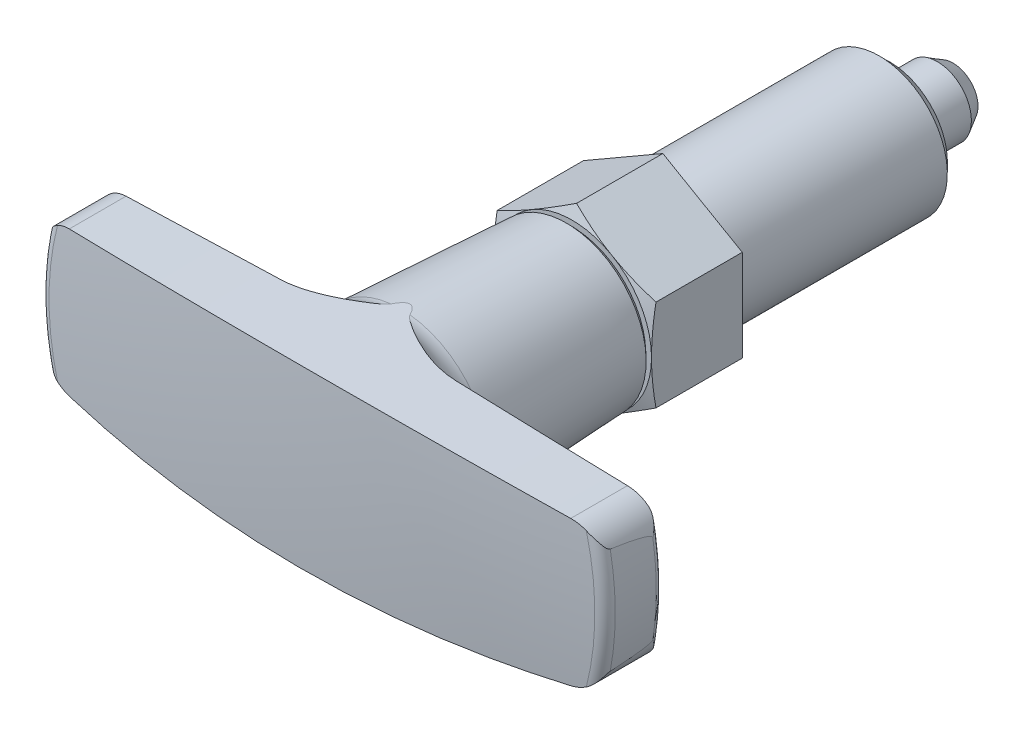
ISO-10303-21;
HEADER;
FILE_DESCRIPTION(('STEP AP214'),'2;1');
FILE_NAME('part.step','',(''),(''),'','','');
FILE_SCHEMA(('AUTOMOTIVE_DESIGN { 1 0 10303 214 1 1 1 1 }'));
ENDSEC;
DATA;
#1=APPLICATION_CONTEXT('core data for automotive mechanical design processes');
#2=APPLICATION_PROTOCOL_DEFINITION('international standard','automotive_design',2000,#1);
#3=PRODUCT_CONTEXT('',#1,'mechanical');
#4=PRODUCT('Part','Part','',(#3));
#5=PRODUCT_RELATED_PRODUCT_CATEGORY('part','',(#4));
#6=PRODUCT_DEFINITION_FORMATION('','',#4);
#7=PRODUCT_DEFINITION_CONTEXT('part definition',#1,'design');
#8=PRODUCT_DEFINITION('design','',#6,#7);
#9=PRODUCT_DEFINITION_SHAPE('','',#8);
#10=(LENGTH_UNIT() NAMED_UNIT(*) SI_UNIT(.MILLI.,.METRE.));
#11=(NAMED_UNIT(*) PLANE_ANGLE_UNIT() SI_UNIT($,.RADIAN.));
#12=(NAMED_UNIT(*) SI_UNIT($,.STERADIAN.) SOLID_ANGLE_UNIT());
#13=UNCERTAINTY_MEASURE_WITH_UNIT(LENGTH_MEASURE(1.E-05),#10,'distance_accuracy_value','');
#14=(GEOMETRIC_REPRESENTATION_CONTEXT(3) GLOBAL_UNCERTAINTY_ASSIGNED_CONTEXT((#13)) GLOBAL_UNIT_ASSIGNED_CONTEXT((#10,
#11,#12)) REPRESENTATION_CONTEXT('',''));
#15=CARTESIAN_POINT('',(0.,0.,0.));
#16=DIRECTION('',(0.,0.,1.));
#17=DIRECTION('',(1.,0.,0.));
#18=AXIS2_PLACEMENT_3D('',#15,#16,#17);
#19=CARTESIAN_POINT('',(0.,0.,-20.));
#20=DIRECTION('',(0.,0.,1.));
#21=DIRECTION('',(0.,-1.,0.));
#22=AXIS2_PLACEMENT_3D('',#19,#20,#21);
#23=CYLINDRICAL_SURFACE('',#22,6.);
#24=CARTESIAN_POINT('',(0.,0.,0.));
#25=DIRECTION('',(0.,0.,1.));
#26=DIRECTION('',(0.,-1.,0.));
#27=AXIS2_PLACEMENT_3D('',#24,#25,#26);
#28=CIRCLE('',#27,6.);
#29=CARTESIAN_POINT('',(0.,-6.,0.));
#30=VERTEX_POINT('',#29);
#31=EDGE_CURVE('E217',#30,#30,#28,.T.);
#32=ORIENTED_EDGE('',*,*,#31,.F.);
#33=EDGE_LOOP('',(#32));
#34=FACE_BOUND('',#33,.T.);
#35=CARTESIAN_POINT('',(0.,0.,-19.08));
#36=DIRECTION('',(0.,0.,1.));
#37=DIRECTION('',(0.,-1.,0.));
#38=AXIS2_PLACEMENT_3D('',#35,#36,#37);
#39=CIRCLE('',#38,6.);
#40=CARTESIAN_POINT('',(0.,-6.,-19.08));
#41=VERTEX_POINT('',#40);
#42=EDGE_CURVE('E221',#41,#41,#39,.T.);
#43=ORIENTED_EDGE('',*,*,#42,.T.);
#44=EDGE_LOOP('',(#43));
#45=FACE_BOUND('',#44,.T.);
#46=ADVANCED_FACE('F14',(#34,#45),#23,.T.);
#47=CARTESIAN_POINT('',(6.,0.,0.));
#48=DIRECTION('',(0.,0.,-1.));
#49=DIRECTION('',(0.,1.,0.));
#50=AXIS2_PLACEMENT_3D('',#47,#48,#49);
#51=PLANE('',#50);
#52=ORIENTED_EDGE('',*,*,#31,.T.);
#53=EDGE_LOOP('',(#52));
#54=FACE_BOUND('',#53,.T.);
#55=DIRECTION('',(-0.866025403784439,-0.5,0.));
#56=VECTOR('',#55,1.);
#57=CARTESIAN_POINT('',(0.,8.08290376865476,0.));
#58=LINE('',#57,#56);
#59=CARTESIAN_POINT('',(0.,8.08290376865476,0.));
#60=VERTEX_POINT('',#59);
#61=CARTESIAN_POINT('',(-7.,4.04145188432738,0.));
#62=VERTEX_POINT('',#61);
#63=EDGE_CURVE('E753',#60,#62,#58,.T.);
#64=ORIENTED_EDGE('',*,*,#63,.F.);
#65=DIRECTION('',(-0.866025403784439,0.5,0.));
#66=VECTOR('',#65,1.);
#67=CARTESIAN_POINT('',(7.,4.04145188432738,0.));
#68=LINE('',#67,#66);
#69=CARTESIAN_POINT('',(7.,4.04145188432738,0.));
#70=VERTEX_POINT('',#69);
#71=EDGE_CURVE('E759',#70,#60,#68,.T.);
#72=ORIENTED_EDGE('',*,*,#71,.F.);
#73=DIRECTION('',(0.,1.,0.));
#74=VECTOR('',#73,1.);
#75=CARTESIAN_POINT('',(7.,-4.04145188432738,0.));
#76=LINE('',#75,#74);
#77=CARTESIAN_POINT('',(7.,-4.04145188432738,0.));
#78=VERTEX_POINT('',#77);
#79=EDGE_CURVE('E220',#78,#70,#76,.T.);
#80=ORIENTED_EDGE('',*,*,#79,.F.);
#81=DIRECTION('',(0.866025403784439,0.5,0.));
#82=VECTOR('',#81,1.);
#83=CARTESIAN_POINT('',(0.,-8.08290376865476,0.));
#84=LINE('',#83,#82);
#85=CARTESIAN_POINT('',(0.,-8.08290376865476,0.));
#86=VERTEX_POINT('',#85);
#87=EDGE_CURVE('E736',#86,#78,#84,.T.);
#88=ORIENTED_EDGE('',*,*,#87,.F.);
#89=DIRECTION('',(0.866025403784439,-0.5,0.));
#90=VECTOR('',#89,1.);
#91=CARTESIAN_POINT('',(-7.,-4.04145188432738,0.));
#92=LINE('',#91,#90);
#93=CARTESIAN_POINT('',(-7.,-4.04145188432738,0.));
#94=VERTEX_POINT('',#93);
#95=EDGE_CURVE('E741',#94,#86,#92,.T.);
#96=ORIENTED_EDGE('',*,*,#95,.F.);
#97=DIRECTION('',(0.,-1.,0.));
#98=VECTOR('',#97,1.);
#99=CARTESIAN_POINT('',(-7.,4.04145188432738,0.));
#100=LINE('',#99,#98);
#101=EDGE_CURVE('E747',#62,#94,#100,.T.);
#102=ORIENTED_EDGE('',*,*,#101,.F.);
#103=EDGE_LOOP('',(#64,#72,#80,#88,#96,#102));
#104=FACE_BOUND('',#103,.T.);
#105=ADVANCED_FACE('F817',(#54,#104),#51,.T.);
#106=CARTESIAN_POINT('',(7.,-4.04145188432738,0.));
#107=DIRECTION('',(1.,0.,0.));
#108=DIRECTION('',(0.,1.,0.));
#109=AXIS2_PLACEMENT_3D('',#106,#107,#108);
#110=PLANE('',#109);
#111=CARTESIAN_POINT('',(7.,0.,8.));
#112=CARTESIAN_POINT('',(7.,0.169651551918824,8.00001418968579));
#113=CARTESIAN_POINT('',(7.,0.339300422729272,7.99775552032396));
#114=CARTESIAN_POINT('',(7.,0.6784704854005,7.98879717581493));
#115=CARTESIAN_POINT('',(7.,0.847991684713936,7.98209778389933));
#116=CARTESIAN_POINT('',(7.,1.1864571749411,7.96438092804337));
#117=CARTESIAN_POINT('',(7.,1.35540193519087,7.95337237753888));
#118=CARTESIAN_POINT('',(7.,1.6929709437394,7.92723277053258));
#119=CARTESIAN_POINT('',(7.,1.86159518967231,7.91210168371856));
#120=CARTESIAN_POINT('',(7.,2.3667049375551,7.86089080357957));
#121=CARTESIAN_POINT('',(7.,2.70260169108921,7.81898381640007));
#122=CARTESIAN_POINT('',(7.,3.37319221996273,7.72184522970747));
#123=CARTESIAN_POINT('',(7.,3.70788203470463,7.66658607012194));
#124=CARTESIAN_POINT('',(7.,4.04145179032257,7.60585527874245));
#125=B_SPLINE_CURVE_WITH_KNOTS('',3,(#111,#112,#113,#114,#115,#116,#117,#118,#119,#120,#121,
#122,#123,#124),.UNSPECIFIED.,.F.,.F.,(4,2,2,2,2,2,4),(0.,0.508935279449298,1.01783810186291,
1.5256937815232,2.03355319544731,3.04874907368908,4.06605858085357),.UNSPECIFIED.);
#126=CARTESIAN_POINT('',(7.,0.,8.));
#127=VERTEX_POINT('',#126);
#128=CARTESIAN_POINT('',(7.00000001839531,4.04145187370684,7.60585525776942));
#129=VERTEX_POINT('',#128);
#130=EDGE_CURVE('E1198',#127,#129,#125,.T.);
#131=ORIENTED_EDGE('',*,*,#130,.F.);
#132=CARTESIAN_POINT('',(7.,-4.04145192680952,7.60585525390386));
#133=CARTESIAN_POINT('',(7.,-3.70788216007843,7.66658604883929));
#134=CARTESIAN_POINT('',(7.,-3.37319233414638,7.72184521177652));
#135=CARTESIAN_POINT('',(7.,-2.70260178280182,7.81898380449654));
#136=CARTESIAN_POINT('',(7.,-2.36670501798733,7.86089079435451));
#137=CARTESIAN_POINT('',(7.,-1.8615952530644,7.91210167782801));
#138=CARTESIAN_POINT('',(7.,-1.69297100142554,7.92723276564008));
#139=CARTESIAN_POINT('',(7.,-1.3554019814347,7.95337237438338));
#140=CARTESIAN_POINT('',(7.,-1.18645721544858,7.96438092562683));
#141=CARTESIAN_POINT('',(7.,-0.847991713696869,7.98209778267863));
#142=CARTESIAN_POINT('',(7.,-0.678470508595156,7.98879717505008));
#143=CARTESIAN_POINT('',(7.,-0.339300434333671,7.99775552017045));
#144=CARTESIAN_POINT('',(7.,-0.169651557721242,8.00001418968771));
#145=CARTESIAN_POINT('',(7.,0.,8.));
#146=B_SPLINE_CURVE_WITH_KNOTS('',3,(#132,#133,#134,#135,#136,#137,#138,#139,#140,#141,#142,
#143,#144,#145),.UNSPECIFIED.,.F.,.F.,(4,2,2,2,2,2,4),(0.,1.01730954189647,2.03250545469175,
2.54036488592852,3.04822058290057,3.55712342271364,4.06605871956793),.UNSPECIFIED.);
#147=CARTESIAN_POINT('',(7.,-4.04145190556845,7.60585525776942));
#148=VERTEX_POINT('',#147);
#149=EDGE_CURVE('E143',#148,#127,#146,.T.);
#150=ORIENTED_EDGE('',*,*,#149,.F.);
#151=DIRECTION('',(0.,0.,1.));
#152=VECTOR('',#151,1.);
#153=CARTESIAN_POINT('',(7.,-4.04145188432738,0.));
#154=LINE('',#153,#152);
#155=EDGE_CURVE('E139',#78,#148,#154,.T.);
#156=ORIENTED_EDGE('',*,*,#155,.F.);
#157=ORIENTED_EDGE('',*,*,#79,.T.);
#158=DIRECTION('',(0.,0.,1.));
#159=VECTOR('',#158,1.);
#160=CARTESIAN_POINT('',(7.,4.04145188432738,0.));
#161=LINE('',#160,#159);
#162=EDGE_CURVE('E762',#129,#70,#161,.F.);
#163=ORIENTED_EDGE('',*,*,#162,.F.);
#164=EDGE_LOOP('',(#131,#150,#156,#157,#163));
#165=FACE_BOUND('',#164,.T.);
#166=ADVANCED_FACE('F825',(#165),#110,.T.);
#167=CARTESIAN_POINT('',(7.,4.04145188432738,0.));
#168=DIRECTION('',(0.5,0.866025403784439,0.));
#169=DIRECTION('',(-0.866025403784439,0.5,0.));
#170=AXIS2_PLACEMENT_3D('',#167,#168,#169);
#171=PLANE('',#170);
#172=CARTESIAN_POINT('',(3.5,6.06217782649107,8.));
#173=CARTESIAN_POINT('',(3.35307744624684,6.14700360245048,8.00001418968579));
#174=CARTESIAN_POINT('',(3.20615721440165,6.23182803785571,7.99775552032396));
#175=CARTESIAN_POINT('',(2.91242732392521,6.40141306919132,7.98879717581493));
#176=CARTESIAN_POINT('',(2.76561765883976,6.48617366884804,7.98209778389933));
#177=CARTESIAN_POINT('',(2.47249794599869,6.65540641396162,7.96438092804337));
#178=CARTESIAN_POINT('',(2.32618749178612,6.7398787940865,7.95337237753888));
#179=CARTESIAN_POINT('',(2.03384415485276,6.90866329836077,7.92723277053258));
#180=CARTESIAN_POINT('',(1.88781127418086,6.99297542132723,7.91210168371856));
#181=CARTESIAN_POINT('',(1.45037340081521,7.24553029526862,7.86089080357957));
#182=CARTESIAN_POINT('',(1.15947827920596,7.41347867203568,7.81898381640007));
#183=CARTESIAN_POINT('',(0.57872984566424,7.74877393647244,7.72184522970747));
#184=CARTESIAN_POINT('',(0.28887996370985,7.91611884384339,7.66658607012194));
#185=CARTESIAN_POINT('',(8.14105421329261E-08,8.08290372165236,7.60585527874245));
#186=B_SPLINE_CURVE_WITH_KNOTS('',3,(#172,#173,#174,#175,#176,#177,#178,#179,#180,#181,#182,
#183,#184,#185),.UNSPECIFIED.,.F.,.F.,(4,2,2,2,2,2,4),(0.,0.508935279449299,1.01783810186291,
1.5256937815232,2.03355319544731,3.04874907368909,4.06605858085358),.UNSPECIFIED.);
#187=CARTESIAN_POINT('',(3.5,6.06217782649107,8.));
#188=VERTEX_POINT('',#187);
#189=CARTESIAN_POINT('',(1.83953081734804E-08,8.0829037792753,7.60585525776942));
#190=VERTEX_POINT('',#189);
#191=EDGE_CURVE('E1186',#188,#190,#186,.T.);
#192=ORIENTED_EDGE('',*,*,#191,.F.);
#193=CARTESIAN_POINT('',(7.00000003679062,4.0414518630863,7.60585525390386));
#194=CARTESIAN_POINT('',(6.71112014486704,4.20823674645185,7.66658604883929));
#195=CARTESIAN_POINT('',(6.4212702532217,4.37558165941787,7.72184521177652));
#196=CARTESIAN_POINT('',(5.84052180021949,4.71087693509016,7.81898380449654));
#197=CARTESIAN_POINT('',(5.54962666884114,4.8788253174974,7.86089079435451));
#198=CARTESIAN_POINT('',(5.1121887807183,5.13138019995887,7.91210167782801));
#199=CARTESIAN_POINT('',(4.9661558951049,5.2156923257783,7.92723276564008));
#200=CARTESIAN_POINT('',(4.67381254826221,5.38447683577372,7.95337237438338));
#201=CARTESIAN_POINT('',(4.52750208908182,5.46894921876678,7.96438092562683));
#202=CARTESIAN_POINT('',(4.23438236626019,5.63818196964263,7.98209778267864));
#203=CARTESIAN_POINT('',(4.08757269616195,5.72294257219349,7.98879717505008));
#204=CARTESIAN_POINT('',(3.79384279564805,5.89252760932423,7.99775552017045));
#205=CARTESIAN_POINT('',(3.6469225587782,5.97735204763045,8.0000141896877));
#206=CARTESIAN_POINT('',(3.5,6.06217782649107,8.));
#207=B_SPLINE_CURVE_WITH_KNOTS('',3,(#193,#194,#195,#196,#197,#198,#199,#200,#201,#202,#203,
#204,#205,#206),.UNSPECIFIED.,.F.,.F.,(4,2,2,2,2,2,4),(0.,1.01730954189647,2.03250545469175,
2.54036488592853,3.04822058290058,3.55712342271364,4.06605871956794),.UNSPECIFIED.);
#208=EDGE_CURVE('E1192',#129,#188,#207,.T.);
#209=ORIENTED_EDGE('',*,*,#208,.F.);
#210=ORIENTED_EDGE('',*,*,#162,.T.);
#211=ORIENTED_EDGE('',*,*,#71,.T.);
#212=DIRECTION('',(0.,0.,1.));
#213=VECTOR('',#212,1.);
#214=CARTESIAN_POINT('',(0.,8.08290376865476,0.));
#215=LINE('',#214,#213);
#216=EDGE_CURVE('E756',#190,#60,#215,.F.);
#217=ORIENTED_EDGE('',*,*,#216,.F.);
#218=EDGE_LOOP('',(#192,#209,#210,#211,#217));
#219=FACE_BOUND('',#218,.T.);
#220=ADVANCED_FACE('F1025',(#219),#171,.T.);
#221=CARTESIAN_POINT('',(0.,8.08290376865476,0.));
#222=DIRECTION('',(-0.5,0.866025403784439,0.));
#223=DIRECTION('',(-0.866025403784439,-0.5,0.));
#224=AXIS2_PLACEMENT_3D('',#221,#222,#223);
#225=PLANE('',#224);
#226=CARTESIAN_POINT('',(-3.5,6.06217782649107,8.));
#227=CARTESIAN_POINT('',(-3.64692255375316,5.97735205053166,8.00001418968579));
#228=CARTESIAN_POINT('',(-3.79384278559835,5.89252761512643,7.99775552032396));
#229=CARTESIAN_POINT('',(-4.08757267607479,5.72294258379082,7.98879717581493));
#230=CARTESIAN_POINT('',(-4.23438234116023,5.6381819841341,7.98209778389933));
#231=CARTESIAN_POINT('',(-4.52750205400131,5.46894923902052,7.96438092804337));
#232=CARTESIAN_POINT('',(-4.67381250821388,5.38447685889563,7.95337237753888));
#233=CARTESIAN_POINT('',(-4.96615584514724,5.21569235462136,7.92723277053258));
#234=CARTESIAN_POINT('',(-5.11218872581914,5.13138023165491,7.91210168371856));
#235=CARTESIAN_POINT('',(-5.54962659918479,4.87882535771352,7.86089080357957));
#236=CARTESIAN_POINT('',(-5.84052172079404,4.71087698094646,7.81898381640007));
#237=CARTESIAN_POINT('',(-6.42127015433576,4.3755817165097,7.72184522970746));
#238=CARTESIAN_POINT('',(-6.71112003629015,4.20823680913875,7.66658607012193));
#239=CARTESIAN_POINT('',(-6.99999991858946,4.04145193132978,7.60585527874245));
#240=B_SPLINE_CURVE_WITH_KNOTS('',3,(#226,#227,#228,#229,#230,#231,#232,#233,#234,#235,#236,
#237,#238,#239),.UNSPECIFIED.,.F.,.F.,(4,2,2,2,2,2,4),(0.,0.5089352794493,1.01783810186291,
1.5256937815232,2.03355319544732,3.04874907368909,4.06605858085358),.UNSPECIFIED.);
#241=CARTESIAN_POINT('',(-3.5,6.06217782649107,8.));
#242=VERTEX_POINT('',#241);
#243=CARTESIAN_POINT('',(-7.,4.04145190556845,7.60585525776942));
#244=VERTEX_POINT('',#243);
#245=EDGE_CURVE('E1167',#242,#244,#240,.T.);
#246=ORIENTED_EDGE('',*,*,#245,.F.);
#247=CARTESIAN_POINT('',(3.67906163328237E-08,8.08290378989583,7.60585525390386));
#248=CARTESIAN_POINT('',(-0.288879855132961,7.91611890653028,7.66658604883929));
#249=CARTESIAN_POINT('',(-0.578729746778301,7.74877399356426,7.72184521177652));
#250=CARTESIAN_POINT('',(-1.15947819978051,7.41347871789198,7.81898380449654));
#251=CARTESIAN_POINT('',(-1.45037333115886,7.24553033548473,7.86089079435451));
#252=CARTESIAN_POINT('',(-1.88781121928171,6.99297545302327,7.91210167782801));
#253=CARTESIAN_POINT('',(-2.0338441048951,6.90866332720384,7.92723276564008));
#254=CARTESIAN_POINT('',(-2.32618745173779,6.73987881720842,7.95337237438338));
#255=CARTESIAN_POINT('',(-2.47249791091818,6.65540643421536,7.96438092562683));
#256=CARTESIAN_POINT('',(-2.76561763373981,6.4861736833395,7.98209778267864));
#257=CARTESIAN_POINT('',(-2.91242730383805,6.40141308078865,7.98879717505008));
#258=CARTESIAN_POINT('',(-3.20615720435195,6.2318280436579,7.99775552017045));
#259=CARTESIAN_POINT('',(-3.3530774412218,6.14700360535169,8.0000141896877));
#260=CARTESIAN_POINT('',(-3.5,6.06217782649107,8.));
#261=B_SPLINE_CURVE_WITH_KNOTS('',3,(#247,#248,#249,#250,#251,#252,#253,#254,#255,#256,#257,
#258,#259,#260),.UNSPECIFIED.,.F.,.F.,(4,2,2,2,2,2,4),(0.,1.01730954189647,2.03250545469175,
2.54036488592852,3.04822058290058,3.55712342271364,4.06605871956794),.UNSPECIFIED.);
#262=EDGE_CURVE('E1174',#190,#242,#261,.T.);
#263=ORIENTED_EDGE('',*,*,#262,.F.);
#264=ORIENTED_EDGE('',*,*,#216,.T.);
#265=ORIENTED_EDGE('',*,*,#63,.T.);
#266=DIRECTION('',(0.,0.,1.));
#267=VECTOR('',#266,1.);
#268=CARTESIAN_POINT('',(-7.,4.04145188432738,0.));
#269=LINE('',#268,#267);
#270=EDGE_CURVE('E750',#244,#62,#269,.F.);
#271=ORIENTED_EDGE('',*,*,#270,.F.);
#272=EDGE_LOOP('',(#246,#263,#264,#265,#271));
#273=FACE_BOUND('',#272,.T.);
#274=ADVANCED_FACE('F1017',(#273),#225,.T.);
#275=CARTESIAN_POINT('',(-7.,4.04145188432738,0.));
#276=DIRECTION('',(-1.,0.,0.));
#277=DIRECTION('',(0.,-1.,0.));
#278=AXIS2_PLACEMENT_3D('',#275,#276,#277);
#279=PLANE('',#278);
#280=CARTESIAN_POINT('',(-7.,0.,8.));
#281=CARTESIAN_POINT('',(-7.,-0.169651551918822,8.00001418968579));
#282=CARTESIAN_POINT('',(-7.,-0.339300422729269,7.99775552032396));
#283=CARTESIAN_POINT('',(-7.,-0.678470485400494,7.98879717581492));
#284=CARTESIAN_POINT('',(-7.,-0.847991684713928,7.98209778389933));
#285=CARTESIAN_POINT('',(-7.,-1.18645717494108,7.96438092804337));
#286=CARTESIAN_POINT('',(-7.,-1.35540193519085,7.95337237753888));
#287=CARTESIAN_POINT('',(-7.,-1.69297094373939,7.92723277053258));
#288=CARTESIAN_POINT('',(-7.,-1.8615951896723,7.91210168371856));
#289=CARTESIAN_POINT('',(-7.,-2.36670493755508,7.86089080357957));
#290=CARTESIAN_POINT('',(-7.,-2.70260169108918,7.81898381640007));
#291=CARTESIAN_POINT('',(-7.,-3.3731922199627,7.72184522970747));
#292=CARTESIAN_POINT('',(-7.,-3.70788203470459,7.66658607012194));
#293=CARTESIAN_POINT('',(-7.,-4.04145179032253,7.60585527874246));
#294=B_SPLINE_CURVE_WITH_KNOTS('',3,(#280,#281,#282,#283,#284,#285,#286,#287,#288,#289,#290,
#291,#292,#293),.UNSPECIFIED.,.F.,.F.,(4,2,2,2,2,2,4),(0.,0.508935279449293,1.0178381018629,
1.52569378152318,2.03355319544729,3.04874907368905,4.06605858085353),.UNSPECIFIED.);
#295=CARTESIAN_POINT('',(-7.,0.,8.));
#296=VERTEX_POINT('',#295);
#297=CARTESIAN_POINT('',(-7.00000001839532,-4.04145187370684,7.60585525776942));
#298=VERTEX_POINT('',#297);
#299=EDGE_CURVE('E1145',#296,#298,#294,.T.);
#300=ORIENTED_EDGE('',*,*,#299,.F.);
#301=CARTESIAN_POINT('',(-7.,4.04145192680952,7.60585525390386));
#302=CARTESIAN_POINT('',(-7.,3.70788216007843,7.66658604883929));
#303=CARTESIAN_POINT('',(-7.,3.37319233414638,7.72184521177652));
#304=CARTESIAN_POINT('',(-7.,2.70260178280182,7.81898380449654));
#305=CARTESIAN_POINT('',(-7.,2.36670501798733,7.86089079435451));
#306=CARTESIAN_POINT('',(-7.,1.8615952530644,7.91210167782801));
#307=CARTESIAN_POINT('',(-7.,1.69297100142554,7.92723276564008));
#308=CARTESIAN_POINT('',(-7.,1.3554019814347,7.95337237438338));
#309=CARTESIAN_POINT('',(-7.,1.18645721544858,7.96438092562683));
#310=CARTESIAN_POINT('',(-7.,0.847991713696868,7.98209778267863));
#311=CARTESIAN_POINT('',(-7.,0.678470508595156,7.98879717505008));
#312=CARTESIAN_POINT('',(-7.,0.33930043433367,7.99775552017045));
#313=CARTESIAN_POINT('',(-7.,0.169651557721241,8.00001418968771));
#314=CARTESIAN_POINT('',(-7.,0.,8.));
#315=B_SPLINE_CURVE_WITH_KNOTS('',3,(#301,#302,#303,#304,#305,#306,#307,#308,#309,#310,#311,
#312,#313,#314),.UNSPECIFIED.,.F.,.F.,(4,2,2,2,2,2,4),(0.,1.01730954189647,2.03250545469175,
2.54036488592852,3.04822058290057,3.55712342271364,4.06605871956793),.UNSPECIFIED.);
#316=EDGE_CURVE('E1146',#244,#296,#315,.T.);
#317=ORIENTED_EDGE('',*,*,#316,.F.);
#318=ORIENTED_EDGE('',*,*,#270,.T.);
#319=ORIENTED_EDGE('',*,*,#101,.T.);
#320=DIRECTION('',(0.,0.,1.));
#321=VECTOR('',#320,1.);
#322=CARTESIAN_POINT('',(-7.,-4.04145188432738,0.));
#323=LINE('',#322,#321);
#324=EDGE_CURVE('E744',#298,#94,#323,.F.);
#325=ORIENTED_EDGE('',*,*,#324,.F.);
#326=EDGE_LOOP('',(#300,#317,#318,#319,#325));
#327=FACE_BOUND('',#326,.T.);
#328=ADVANCED_FACE('F1012',(#327),#279,.T.);
#329=CARTESIAN_POINT('',(-7.,-4.04145188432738,0.));
#330=DIRECTION('',(-0.5,-0.866025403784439,0.));
#331=DIRECTION('',(0.866025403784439,-0.5,0.));
#332=AXIS2_PLACEMENT_3D('',#329,#330,#331);
#333=PLANE('',#332);
#334=CARTESIAN_POINT('',(-3.5,-6.06217782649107,8.));
#335=CARTESIAN_POINT('',(-3.35307744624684,-6.14700360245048,8.00001418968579));
#336=CARTESIAN_POINT('',(-3.20615721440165,-6.23182803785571,7.99775552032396));
#337=CARTESIAN_POINT('',(-2.91242732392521,-6.40141306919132,7.98879717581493));
#338=CARTESIAN_POINT('',(-2.76561765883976,-6.48617366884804,7.98209778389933));
#339=CARTESIAN_POINT('',(-2.47249794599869,-6.65540641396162,7.96438092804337));
#340=CARTESIAN_POINT('',(-2.32618749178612,-6.7398787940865,7.95337237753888));
#341=CARTESIAN_POINT('',(-2.03384415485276,-6.90866329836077,7.92723277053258));
#342=CARTESIAN_POINT('',(-1.88781127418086,-6.99297542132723,7.91210168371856));
#343=CARTESIAN_POINT('',(-1.45037340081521,-7.24553029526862,7.86089080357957));
#344=CARTESIAN_POINT('',(-1.15947827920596,-7.41347867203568,7.81898381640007));
#345=CARTESIAN_POINT('',(-0.578729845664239,-7.74877393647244,7.72184522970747));
#346=CARTESIAN_POINT('',(-0.28887996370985,-7.91611884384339,7.66658607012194));
#347=CARTESIAN_POINT('',(-8.14105419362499E-08,-8.08290372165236,7.60585527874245));
#348=B_SPLINE_CURVE_WITH_KNOTS('',3,(#334,#335,#336,#337,#338,#339,#340,#341,#342,#343,#344,
#345,#346,#347),.UNSPECIFIED.,.F.,.F.,(4,2,2,2,2,2,4),(0.,0.508935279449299,1.01783810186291,
1.5256937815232,2.03355319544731,3.04874907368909,4.06605858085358),.UNSPECIFIED.);
#349=CARTESIAN_POINT('',(-3.5,-6.06217782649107,8.));
#350=VERTEX_POINT('',#349);
#351=CARTESIAN_POINT('',(-1.83953082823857E-08,-8.0829037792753,7.60585525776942));
#352=VERTEX_POINT('',#351);
#353=EDGE_CURVE('E159',#350,#352,#348,.T.);
#354=ORIENTED_EDGE('',*,*,#353,.F.);
#355=CARTESIAN_POINT('',(-7.00000003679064,-4.0414518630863,7.60585525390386));
#356=CARTESIAN_POINT('',(-6.71112014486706,-4.20823674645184,7.66658604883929));
#357=CARTESIAN_POINT('',(-6.42127025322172,-4.37558165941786,7.72184521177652));
#358=CARTESIAN_POINT('',(-5.84052180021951,-4.71087693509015,7.81898380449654));
#359=CARTESIAN_POINT('',(-5.54962666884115,-4.8788253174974,7.86089079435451));
#360=CARTESIAN_POINT('',(-5.1121887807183,-5.13138019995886,7.91210167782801));
#361=CARTESIAN_POINT('',(-4.96615589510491,-5.21569232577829,7.92723276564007));
#362=CARTESIAN_POINT('',(-4.67381254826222,-5.38447683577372,7.95337237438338));
#363=CARTESIAN_POINT('',(-4.52750208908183,-5.46894921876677,7.96438092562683));
#364=CARTESIAN_POINT('',(-4.23438236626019,-5.63818196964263,7.98209778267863));
#365=CARTESIAN_POINT('',(-4.08757269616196,-5.72294257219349,7.98879717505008));
#366=CARTESIAN_POINT('',(-3.79384279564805,-5.89252760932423,7.99775552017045));
#367=CARTESIAN_POINT('',(-3.6469225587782,-5.97735204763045,8.00001418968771));
#368=CARTESIAN_POINT('',(-3.5,-6.06217782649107,8.));
#369=B_SPLINE_CURVE_WITH_KNOTS('',3,(#355,#356,#357,#358,#359,#360,#361,#362,#363,#364,#365,
#366,#367,#368),.UNSPECIFIED.,.F.,.F.,(4,2,2,2,2,2,4),(0.,1.01730954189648,2.03250545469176,
2.54036488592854,3.0482205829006,3.55712342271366,4.06605871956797),.UNSPECIFIED.);
#370=EDGE_CURVE('E1143',#298,#350,#369,.T.);
#371=ORIENTED_EDGE('',*,*,#370,.F.);
#372=ORIENTED_EDGE('',*,*,#324,.T.);
#373=ORIENTED_EDGE('',*,*,#95,.T.);
#374=DIRECTION('',(0.,0.,1.));
#375=VECTOR('',#374,1.);
#376=CARTESIAN_POINT('',(0.,-8.08290376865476,0.));
#377=LINE('',#376,#375);
#378=EDGE_CURVE('E739',#352,#86,#377,.F.);
#379=ORIENTED_EDGE('',*,*,#378,.F.);
#380=EDGE_LOOP('',(#354,#371,#372,#373,#379));
#381=FACE_BOUND('',#380,.T.);
#382=ADVANCED_FACE('F199',(#381),#333,.T.);
#383=CARTESIAN_POINT('',(0.,-8.08290376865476,0.));
#384=DIRECTION('',(0.5,-0.866025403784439,0.));
#385=DIRECTION('',(0.866025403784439,0.5,0.));
#386=AXIS2_PLACEMENT_3D('',#383,#384,#385);
#387=PLANE('',#386);
#388=CARTESIAN_POINT('',(3.5,-6.06217782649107,8.));
#389=CARTESIAN_POINT('',(3.64692255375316,-5.97735205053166,8.00001418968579));
#390=CARTESIAN_POINT('',(3.79384278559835,-5.89252761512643,7.99775552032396));
#391=CARTESIAN_POINT('',(4.08757267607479,-5.72294258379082,7.98879717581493));
#392=CARTESIAN_POINT('',(4.23438234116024,-5.6381819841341,7.98209778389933));
#393=CARTESIAN_POINT('',(4.52750205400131,-5.46894923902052,7.96438092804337));
#394=CARTESIAN_POINT('',(4.67381250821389,-5.38447685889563,7.95337237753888));
#395=CARTESIAN_POINT('',(4.96615584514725,-5.21569235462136,7.92723277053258));
#396=CARTESIAN_POINT('',(5.11218872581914,-5.13138023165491,7.91210168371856));
#397=CARTESIAN_POINT('',(5.54962659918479,-4.87882535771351,7.86089080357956));
#398=CARTESIAN_POINT('',(5.84052172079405,-4.71087698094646,7.81898381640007));
#399=CARTESIAN_POINT('',(6.42127015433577,-4.3755817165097,7.72184522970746));
#400=CARTESIAN_POINT('',(6.71112003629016,-4.20823680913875,7.66658607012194));
#401=CARTESIAN_POINT('',(6.99999991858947,-4.04145193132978,7.60585527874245));
#402=B_SPLINE_CURVE_WITH_KNOTS('',3,(#388,#389,#390,#391,#392,#393,#394,#395,#396,#397,#398,
#399,#400,#401),.UNSPECIFIED.,.F.,.F.,(4,2,2,2,2,2,4),(0.,0.508935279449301,1.01783810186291,
1.5256937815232,2.03355319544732,3.0487490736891,4.06605858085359),.UNSPECIFIED.);
#403=CARTESIAN_POINT('',(3.5,-6.06217782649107,8.));
#404=VERTEX_POINT('',#403);
#405=EDGE_CURVE('E130',#404,#148,#402,.T.);
#406=ORIENTED_EDGE('',*,*,#405,.F.);
#407=CARTESIAN_POINT('',(-3.67906165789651E-08,-8.08290378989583,7.60585525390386));
#408=CARTESIAN_POINT('',(0.288879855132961,-7.91611890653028,7.66658604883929));
#409=CARTESIAN_POINT('',(0.578729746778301,-7.74877399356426,7.72184521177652));
#410=CARTESIAN_POINT('',(1.15947819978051,-7.41347871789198,7.81898380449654));
#411=CARTESIAN_POINT('',(1.45037333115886,-7.24553033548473,7.86089079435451));
#412=CARTESIAN_POINT('',(1.8878112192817,-6.99297545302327,7.91210167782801));
#413=CARTESIAN_POINT('',(2.0338441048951,-6.90866332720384,7.92723276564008));
#414=CARTESIAN_POINT('',(2.32618745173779,-6.73987881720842,7.95337237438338));
#415=CARTESIAN_POINT('',(2.47249791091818,-6.65540643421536,7.96438092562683));
#416=CARTESIAN_POINT('',(2.76561763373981,-6.4861736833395,7.98209778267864));
#417=CARTESIAN_POINT('',(2.91242730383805,-6.40141308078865,7.98879717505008));
#418=CARTESIAN_POINT('',(3.20615720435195,-6.2318280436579,7.99775552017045));
#419=CARTESIAN_POINT('',(3.3530774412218,-6.14700360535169,8.0000141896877));
#420=CARTESIAN_POINT('',(3.5,-6.06217782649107,8.));
#421=B_SPLINE_CURVE_WITH_KNOTS('',3,(#407,#408,#409,#410,#411,#412,#413,#414,#415,#416,#417,
#418,#419,#420),.UNSPECIFIED.,.F.,.F.,(4,2,2,2,2,2,4),(0.,1.01730954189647,2.03250545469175,
2.54036488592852,3.04822058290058,3.55712342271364,4.06605871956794),.UNSPECIFIED.);
#422=EDGE_CURVE('E135',#352,#404,#421,.T.);
#423=ORIENTED_EDGE('',*,*,#422,.F.);
#424=ORIENTED_EDGE('',*,*,#378,.T.);
#425=ORIENTED_EDGE('',*,*,#87,.T.);
#426=ORIENTED_EDGE('',*,*,#155,.T.);
#427=EDGE_LOOP('',(#406,#423,#424,#425,#426));
#428=FACE_BOUND('',#427,.T.);
#429=ADVANCED_FACE('F132',(#428),#387,.T.);
#430=CARTESIAN_POINT('',(0.,0.,7.60349039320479));
#431=DIRECTION('',(0.,0.,-1.));
#432=DIRECTION('',(1.,0.,0.));
#433=AXIS2_PLACEMENT_3D('',#430,#431,#432);
#434=CONICAL_SURFACE('',#433,8.08940119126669,1.22173047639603);
#435=ORIENTED_EDGE('',*,*,#149,.T.);
#436=CARTESIAN_POINT('',(0.,0.,8.));
#437=DIRECTION('',(0.,0.,-1.));
#438=DIRECTION('',(1.,0.,0.));
#439=AXIS2_PLACEMENT_3D('',#436,#437,#438);
#440=CIRCLE('',#439,7.);
#441=EDGE_CURVE('E146',#404,#127,#440,.F.);
#442=ORIENTED_EDGE('',*,*,#441,.F.);
#443=ORIENTED_EDGE('',*,*,#405,.T.);
#444=EDGE_LOOP('',(#435,#442,#443));
#445=FACE_BOUND('',#444,.T.);
#446=ADVANCED_FACE('F147',(#445),#434,.T.);
#447=CARTESIAN_POINT('',(0.,0.,7.60349039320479));
#448=DIRECTION('',(0.,0.,-1.));
#449=DIRECTION('',(1.,0.,0.));
#450=AXIS2_PLACEMENT_3D('',#447,#448,#449);
#451=CONICAL_SURFACE('',#450,8.08940119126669,1.22173047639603);
#452=ORIENTED_EDGE('',*,*,#208,.T.);
#453=CARTESIAN_POINT('',(0.,0.,8.));
#454=DIRECTION('',(0.,0.,-1.));
#455=DIRECTION('',(1.,0.,0.));
#456=AXIS2_PLACEMENT_3D('',#453,#454,#455);
#457=CIRCLE('',#456,7.);
#458=EDGE_CURVE('E152',#127,#188,#457,.F.);
#459=ORIENTED_EDGE('',*,*,#458,.F.);
#460=ORIENTED_EDGE('',*,*,#130,.T.);
#461=EDGE_LOOP('',(#452,#459,#460));
#462=FACE_BOUND('',#461,.T.);
#463=ADVANCED_FACE('F909',(#462),#451,.T.);
#464=CARTESIAN_POINT('',(0.,0.,7.60349039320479));
#465=DIRECTION('',(0.,0.,-1.));
#466=DIRECTION('',(1.,0.,0.));
#467=AXIS2_PLACEMENT_3D('',#464,#465,#466);
#468=CONICAL_SURFACE('',#467,8.08940119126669,1.22173047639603);
#469=ORIENTED_EDGE('',*,*,#191,.T.);
#470=ORIENTED_EDGE('',*,*,#262,.T.);
#471=CARTESIAN_POINT('',(0.,0.,8.));
#472=DIRECTION('',(0.,0.,-1.));
#473=DIRECTION('',(1.,0.,0.));
#474=AXIS2_PLACEMENT_3D('',#471,#472,#473);
#475=CIRCLE('',#474,7.);
#476=EDGE_CURVE('E177',#188,#242,#475,.F.);
#477=ORIENTED_EDGE('',*,*,#476,.F.);
#478=EDGE_LOOP('',(#469,#470,#477));
#479=FACE_BOUND('',#478,.T.);
#480=ADVANCED_FACE('F914',(#479),#468,.T.);
#481=CARTESIAN_POINT('',(0.,0.,7.60349039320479));
#482=DIRECTION('',(0.,0.,-1.));
#483=DIRECTION('',(1.,0.,0.));
#484=AXIS2_PLACEMENT_3D('',#481,#482,#483);
#485=CONICAL_SURFACE('',#484,8.08940119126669,1.22173047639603);
#486=ORIENTED_EDGE('',*,*,#245,.T.);
#487=ORIENTED_EDGE('',*,*,#316,.T.);
#488=CARTESIAN_POINT('',(0.,0.,8.));
#489=DIRECTION('',(0.,0.,-1.));
#490=DIRECTION('',(1.,0.,0.));
#491=AXIS2_PLACEMENT_3D('',#488,#489,#490);
#492=CIRCLE('',#491,7.);
#493=EDGE_CURVE('E171',#242,#296,#492,.F.);
#494=ORIENTED_EDGE('',*,*,#493,.F.);
#495=EDGE_LOOP('',(#486,#487,#494));
#496=FACE_BOUND('',#495,.T.);
#497=ADVANCED_FACE('F922',(#496),#485,.T.);
#498=CARTESIAN_POINT('',(0.,0.,7.60349039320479));
#499=DIRECTION('',(0.,0.,-1.));
#500=DIRECTION('',(1.,0.,0.));
#501=AXIS2_PLACEMENT_3D('',#498,#499,#500);
#502=CONICAL_SURFACE('',#501,8.08940119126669,1.22173047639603);
#503=ORIENTED_EDGE('',*,*,#299,.T.);
#504=ORIENTED_EDGE('',*,*,#370,.T.);
#505=CARTESIAN_POINT('',(0.,0.,8.));
#506=DIRECTION('',(0.,0.,-1.));
#507=DIRECTION('',(1.,0.,0.));
#508=AXIS2_PLACEMENT_3D('',#505,#506,#507);
#509=CIRCLE('',#508,7.);
#510=EDGE_CURVE('E165',#296,#350,#509,.F.);
#511=ORIENTED_EDGE('',*,*,#510,.F.);
#512=EDGE_LOOP('',(#503,#504,#511));
#513=FACE_BOUND('',#512,.T.);
#514=ADVANCED_FACE('F930',(#513),#502,.T.);
#515=CARTESIAN_POINT('',(0.,0.,7.60349039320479));
#516=DIRECTION('',(0.,0.,-1.));
#517=DIRECTION('',(1.,0.,0.));
#518=AXIS2_PLACEMENT_3D('',#515,#516,#517);
#519=CONICAL_SURFACE('',#518,8.08940119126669,1.22173047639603);
#520=ORIENTED_EDGE('',*,*,#422,.T.);
#521=CARTESIAN_POINT('',(0.,0.,8.));
#522=DIRECTION('',(0.,0.,-1.));
#523=DIRECTION('',(1.,0.,0.));
#524=AXIS2_PLACEMENT_3D('',#521,#522,#523);
#525=CIRCLE('',#524,7.);
#526=EDGE_CURVE('E157',#350,#404,#525,.F.);
#527=ORIENTED_EDGE('',*,*,#526,.F.);
#528=ORIENTED_EDGE('',*,*,#353,.T.);
#529=EDGE_LOOP('',(#520,#527,#528));
#530=FACE_BOUND('',#529,.T.);
#531=ADVANCED_FACE('F156',(#530),#519,.T.);
#532=CARTESIAN_POINT('',(7.,0.,8.));
#533=DIRECTION('',(0.,0.,1.));
#534=DIRECTION('',(0.,-1.,0.));
#535=AXIS2_PLACEMENT_3D('',#532,#533,#534);
#536=PLANE('',#535);
#537=ORIENTED_EDGE('',*,*,#510,.T.);
#538=ORIENTED_EDGE('',*,*,#526,.T.);
#539=ORIENTED_EDGE('',*,*,#441,.T.);
#540=ORIENTED_EDGE('',*,*,#458,.T.);
#541=ORIENTED_EDGE('',*,*,#476,.T.);
#542=ORIENTED_EDGE('',*,*,#493,.T.);
#543=EDGE_LOOP('',(#537,#538,#539,#540,#541,#542));
#544=FACE_BOUND('',#543,.T.);
#545=CARTESIAN_POINT('',(0.,0.,7.99999999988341));
#546=DIRECTION('',(0.,0.,1.));
#547=DIRECTION('',(0.,-1.,0.));
#548=AXIS2_PLACEMENT_3D('',#545,#546,#547);
#549=CIRCLE('',#548,6.50000000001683);
#550=CARTESIAN_POINT('',(0.,-6.50000000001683,7.99999999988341));
#551=VERTEX_POINT('',#550);
#552=EDGE_CURVE('E169',#551,#551,#549,.T.);
#553=ORIENTED_EDGE('',*,*,#552,.F.);
#554=EDGE_LOOP('',(#553));
#555=FACE_BOUND('',#554,.T.);
#556=ADVANCED_FACE('F161',(#544,#555),#536,.T.);
#557=CARTESIAN_POINT('',(0.,0.,25.5614056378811));
#558=DIRECTION('',(0.,0.,1.));
#559=DIRECTION('',(0.,-1.,0.));
#560=AXIS2_PLACEMENT_3D('',#557,#558,#559);
#561=TOROIDAL_SURFACE('',#560,24.5,0.5);
#562=CARTESIAN_POINT('',(0.,0.,25.0646310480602));
#563=DIRECTION('',(0.,0.,1.));
#564=DIRECTION('',(-1.,0.,0.));
#565=AXIS2_PLACEMENT_3D('',#562,#563,#564);
#566=CIRCLE('',#565,24.4432989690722);
#567=CARTESIAN_POINT('',(-23.7954991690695,5.59008799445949,25.0646310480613));
#568=VERTEX_POINT('',#567);
#569=CARTESIAN_POINT('',(-23.7954991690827,-5.59008799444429,25.0646310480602));
#570=VERTEX_POINT('',#569);
#571=EDGE_CURVE('E482',#568,#570,#566,.T.);
#572=ORIENTED_EDGE('',*,*,#571,.T.);
#573=CARTESIAN_POINT('',(-23.7954991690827,-5.5900879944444,25.0646310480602));
#574=CARTESIAN_POINT('',(-23.8074381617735,-5.57879533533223,25.0636000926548));
#575=CARTESIAN_POINT('',(-23.8192887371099,-5.56738741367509,25.0628289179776));
#576=CARTESIAN_POINT('',(-23.8432560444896,-5.54391611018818,25.0617499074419));
#577=CARTESIAN_POINT('',(-23.8553654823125,-5.53184439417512,25.0614610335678));
#578=CARTESIAN_POINT('',(-23.8798222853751,-5.50703640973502,25.0613629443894));
#579=CARTESIAN_POINT('',(-23.8921616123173,-5.49429217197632,25.0615720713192));
#580=CARTESIAN_POINT('',(-23.917048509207,-5.46812880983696,25.0624862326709));
#581=CARTESIAN_POINT('',(-23.9295873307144,-5.45470199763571,25.0632090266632));
#582=CARTESIAN_POINT('',(-23.9548414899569,-5.4271632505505,25.0651649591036));
#583=CARTESIAN_POINT('',(-23.9675473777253,-5.41304388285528,25.0664152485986));
#584=CARTESIAN_POINT('',(-23.9931021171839,-5.38410957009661,25.0694390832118));
#585=CARTESIAN_POINT('',(-24.0059408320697,-5.36928741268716,25.0712291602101));
#586=CARTESIAN_POINT('',(-24.0317258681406,-5.3389369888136,25.0753436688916));
#587=CARTESIAN_POINT('',(-24.0446613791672,-5.32340170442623,25.0776839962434));
#588=CARTESIAN_POINT('',(-24.0706028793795,-5.29161450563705,25.0829081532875));
#589=CARTESIAN_POINT('',(-24.0835973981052,-5.27535574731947,25.0858072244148));
#590=CARTESIAN_POINT('',(-24.1096182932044,-5.24211092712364,25.0921559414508));
#591=CARTESIAN_POINT('',(-24.1226325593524,-5.22511817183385,25.0956201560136));
#592=CARTESIAN_POINT('',(-24.1486521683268,-5.19039551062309,25.1031038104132));
#593=CARTESIAN_POINT('',(-24.161644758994,-5.17265907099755,25.1071371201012));
#594=CARTESIAN_POINT('',(-24.2011265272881,-5.1175192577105,25.1202660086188));
#595=CARTESIAN_POINT('',(-24.2268840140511,-5.07975988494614,25.1300858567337));
#596=CARTESIAN_POINT('',(-24.2778996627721,-5.00119676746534,25.151890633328));
#597=CARTESIAN_POINT('',(-24.3030415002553,-4.96034374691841,25.1639683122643));
#598=CARTESIAN_POINT('',(-24.3524826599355,-4.87552622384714,25.1902556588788));
#599=CARTESIAN_POINT('',(-24.3766583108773,-4.83151466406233,25.2045463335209));
#600=CARTESIAN_POINT('',(-24.4123647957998,-4.76231656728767,25.227707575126));
#601=CARTESIAN_POINT('',(-24.424751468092,-4.73743091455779,25.2361735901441));
#602=CARTESIAN_POINT('',(-24.450369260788,-4.68408886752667,25.2545739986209));
#603=CARTESIAN_POINT('',(-24.4634941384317,-4.65559707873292,25.2645541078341));
#604=CARTESIAN_POINT('',(-24.4903008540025,-4.59498161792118,25.2861052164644));
#605=CARTESIAN_POINT('',(-24.5038670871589,-4.56282437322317,25.2977254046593));
#606=CARTESIAN_POINT('',(-24.5312117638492,-4.49480311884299,25.3226441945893));
#607=CARTESIAN_POINT('',(-24.5448622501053,-4.45890520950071,25.3359907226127));
#608=CARTESIAN_POINT('',(-24.5719838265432,-4.38332971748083,25.3644173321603));
#609=CARTESIAN_POINT('',(-24.5853137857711,-4.34361802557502,25.3795413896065));
#610=CARTESIAN_POINT('',(-24.6113541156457,-4.26034239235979,25.4115257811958));
#611=CARTESIAN_POINT('',(-24.6239095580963,-4.21674401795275,25.4284226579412));
#612=CARTESIAN_POINT('',(-24.647917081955,-4.1256279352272,25.4638886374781));
#613=CARTESIAN_POINT('',(-24.6592004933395,-4.07807575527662,25.4824833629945));
#614=CARTESIAN_POINT('',(-24.6801513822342,-3.97899421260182,25.521196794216));
#615=CARTESIAN_POINT('',(-24.6896376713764,-3.92743076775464,25.5413265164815));
#616=CARTESIAN_POINT('',(-24.6977621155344,-3.87563497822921,25.5614056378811));
#617=B_SPLINE_CURVE_WITH_KNOTS('',3,(#573,#574,#575,#576,#577,#578,#579,#580,#581,#582,#583,
#584,#585,#586,#587,#588,#589,#590,#591,#592,#593,#594,#595,#596,#597,#598,#599,#600,#601,#602,
#603,#604,#605,#606,#607,#608,#609,#610,#611,#612,#613,#614,#615,#616),.UNSPECIFIED.,.F.,.F.,(4,
2,2,2,2,2,2,2,2,2,2,2,2,2,2,2,2,2,2,2,2,4),(0.,0.0493931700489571,0.100686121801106,
0.153897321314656,0.209043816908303,0.266141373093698,0.325204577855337,0.386246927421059,
0.449280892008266,0.514317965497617,0.58136870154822,0.721534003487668,0.86985760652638,
1.02639145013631,1.11355640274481,1.21229458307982,1.32262833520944,1.4445751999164,
1.57814621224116,1.72334378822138,1.88015933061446,2.0485706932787),.UNSPECIFIED.);
#618=CARTESIAN_POINT('',(-24.6977621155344,-3.8756349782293,25.5614056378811));
#619=VERTEX_POINT('',#618);
#620=EDGE_CURVE('E555',#619,#570,#617,.F.);
#621=ORIENTED_EDGE('',*,*,#620,.F.);
#622=CARTESIAN_POINT('',(-24.6918041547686,-3.91213226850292,25.5755666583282));
#623=CARTESIAN_POINT('',(-24.6920617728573,-3.91061309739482,25.5749766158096));
#624=CARTESIAN_POINT('',(-24.6923182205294,-3.90909372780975,25.5743865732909));
#625=CARTESIAN_POINT('',(-24.6928287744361,-3.90605459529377,25.5732064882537));
#626=CARTESIAN_POINT('',(-24.6930828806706,-3.90453483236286,25.5726164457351));
#627=CARTESIAN_POINT('',(-24.6935887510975,-3.90149491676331,25.5714363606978));
#628=CARTESIAN_POINT('',(-24.69384051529,-3.89997476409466,25.5708463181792));
#629=CARTESIAN_POINT('',(-24.6943417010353,-3.8969340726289,25.5696662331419));
#630=CARTESIAN_POINT('',(-24.6945911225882,-3.89541353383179,25.5690761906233));
#631=CARTESIAN_POINT('',(-24.6950876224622,-3.89237207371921,25.567896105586));
#632=CARTESIAN_POINT('',(-24.6953347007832,-3.89085115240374,25.5673060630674));
#633=CARTESIAN_POINT('',(-24.6958265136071,-3.88780893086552,25.5661259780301));
#634=CARTESIAN_POINT('',(-24.6960712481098,-3.88628763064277,25.5655359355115));
#635=CARTESIAN_POINT('',(-24.6965583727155,-3.88324465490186,25.5643558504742));
#636=CARTESIAN_POINT('',(-24.6968007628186,-3.88172297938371,25.5637658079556));
#637=CARTESIAN_POINT('',(-24.6972831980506,-3.87867925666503,25.5625857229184));
#638=CARTESIAN_POINT('',(-24.6975232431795,-3.8771572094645,25.5619956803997));
#639=CARTESIAN_POINT('',(-24.6977621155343,-3.8756349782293,25.5614056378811));
#640=B_SPLINE_CURVE_WITH_KNOTS('',3,(#622,#623,#624,#625,#626,#627,#628,#629,#630,#631,#632,
#633,#634,#635,#636,#637,#638,#639),.UNSPECIFIED.,.F.,.F.,(4,2,2,2,2,2,2,2,4),(0.,
0.00494990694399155,0.00989981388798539,0.0148497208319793,0.019799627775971,0.024749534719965,
0.029699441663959,0.0346493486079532,0.0395992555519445),.UNSPECIFIED.);
#641=CARTESIAN_POINT('',(-24.6918041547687,-3.91213226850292,25.5755666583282));
#642=VERTEX_POINT('',#641);
#643=EDGE_CURVE('E503',#642,#619,#640,.T.);
#644=ORIENTED_EDGE('',*,*,#643,.F.);
#645=CARTESIAN_POINT('',(0.,0.,25.5755666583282));
#646=DIRECTION('',(0.,0.,-1.));
#647=DIRECTION('',(0.,1.,0.));
#648=AXIS2_PLACEMENT_3D('',#645,#646,#647);
#649=CIRCLE('',#648,24.9997994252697);
#650=CARTESIAN_POINT('',(-24.6918041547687,3.91213226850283,25.5755666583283));
#651=VERTEX_POINT('',#650);
#652=EDGE_CURVE('E718',#651,#642,#649,.F.);
#653=ORIENTED_EDGE('',*,*,#652,.F.);
#654=CARTESIAN_POINT('',(-24.6918041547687,3.91213226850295,25.5755666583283));
#655=CARTESIAN_POINT('',(-24.6920617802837,3.91061304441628,25.5749767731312));
#656=CARTESIAN_POINT('',(-24.6923182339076,3.90909363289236,25.5743868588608));
#657=CARTESIAN_POINT('',(-24.6928287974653,3.90605443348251,25.5732069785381));
#658=CARTESIAN_POINT('',(-24.6930829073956,3.90453464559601,25.5726170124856));
#659=CARTESIAN_POINT('',(-24.6935887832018,3.90149469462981,25.5714370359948));
#660=CARTESIAN_POINT('',(-24.6938405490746,3.89997453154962,25.5708470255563));
#661=CARTESIAN_POINT('',(-24.6943417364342,3.89693383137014,25.5696669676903));
#662=CARTESIAN_POINT('',(-24.6945911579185,3.89541329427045,25.5690769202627));
#663=CARTESIAN_POINT('',(-24.6950876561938,3.89237184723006,25.5678967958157));
#664=CARTESIAN_POINT('',(-24.6953347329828,3.89085093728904,25.5673067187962));
#665=CARTESIAN_POINT('',(-24.6958265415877,3.88780874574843,25.5661265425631));
#666=CARTESIAN_POINT('',(-24.6960712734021,3.8862874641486,25.5655364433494));
#667=CARTESIAN_POINT('',(-24.6965583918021,3.88324453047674,25.5643562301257));
#668=CARTESIAN_POINT('',(-24.6968007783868,3.88172287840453,25.5637661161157));
#669=CARTESIAN_POINT('',(-24.6972832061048,3.87867920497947,25.5625858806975));
#670=CARTESIAN_POINT('',(-24.6975232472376,3.87715718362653,25.5619957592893));
#671=CARTESIAN_POINT('',(-24.6977621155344,3.87563497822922,25.5614056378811));
#672=B_SPLINE_CURVE_WITH_KNOTS('',3,(#654,#655,#656,#657,#658,#659,#660,#661,#662,#663,#664,
#665,#666,#667,#668,#669,#670,#671),.UNSPECIFIED.,.F.,.F.,(4,2,2,2,2,2,2,2,4),(0.,
0.0049498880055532,0.00989978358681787,0.0148496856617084,0.0197995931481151,0.0247495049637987,
0.0296994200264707,0.0346493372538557,0.0395992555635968),.UNSPECIFIED.);
#673=CARTESIAN_POINT('',(-24.6977621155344,3.87563497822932,25.5614056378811));
#674=VERTEX_POINT('',#673);
#675=EDGE_CURVE('E166',#651,#674,#672,.T.);
#676=ORIENTED_EDGE('',*,*,#675,.T.);
#677=CARTESIAN_POINT('',(-24.6977621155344,3.87563497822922,25.5614056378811));
#678=CARTESIAN_POINT('',(-24.6896304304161,3.9274769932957,25.5413085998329));
#679=CARTESIAN_POINT('',(-24.6801344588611,3.97908622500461,25.5211608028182));
#680=CARTESIAN_POINT('',(-24.6591600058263,4.07825582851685,25.482412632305));
#681=CARTESIAN_POINT('',(-24.6478630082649,4.12585034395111,25.4638012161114));
#682=CARTESIAN_POINT('',(-24.6238249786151,4.21704764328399,25.4283037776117));
#683=CARTESIAN_POINT('',(-24.611252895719,4.26068496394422,25.4113920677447));
#684=CARTESIAN_POINT('',(-24.5851768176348,4.34403513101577,25.379380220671));
#685=CARTESIAN_POINT('',(-24.5718280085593,4.38378247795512,25.3642434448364));
#686=CARTESIAN_POINT('',(-24.5446670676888,4.45942604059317,25.3357937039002));
#687=CARTESIAN_POINT('',(-24.5309963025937,4.49535643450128,25.3224366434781));
#688=CARTESIAN_POINT('',(-24.5036101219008,4.56343954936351,25.2974990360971));
#689=CARTESIAN_POINT('',(-24.4900228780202,4.59562624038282,25.2858704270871));
#690=CARTESIAN_POINT('',(-24.4631738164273,4.65629761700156,25.2643045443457));
#691=CARTESIAN_POINT('',(-24.4500277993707,4.68481594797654,25.2543179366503));
#692=CARTESIAN_POINT('',(-24.424367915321,4.7382082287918,25.235906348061));
#693=CARTESIAN_POINT('',(-24.411960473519,4.76311764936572,25.2274355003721));
#694=CARTESIAN_POINT('',(-24.3762436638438,4.83228418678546,25.2042949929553));
#695=CARTESIAN_POINT('',(-24.3520820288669,4.87624146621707,25.1900287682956));
#696=CARTESIAN_POINT('',(-24.3026723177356,4.96095661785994,25.1637864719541));
#697=CARTESIAN_POINT('',(-24.2775475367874,5.00176143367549,25.1517295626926));
#698=CARTESIAN_POINT('',(-24.2265683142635,5.08023415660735,25.1299622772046));
#699=CARTESIAN_POINT('',(-24.2008298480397,5.11795122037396,25.1201593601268));
#700=CARTESIAN_POINT('',(-24.161378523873,5.17303028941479,25.1070532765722));
#701=CARTESIAN_POINT('',(-24.148395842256,5.19074773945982,25.1030269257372));
#702=CARTESIAN_POINT('',(-24.1223961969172,5.22543383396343,25.0955561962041));
#703=CARTESIAN_POINT('',(-24.1093919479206,5.24240899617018,25.0920979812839));
#704=CARTESIAN_POINT('',(-24.0833911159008,5.27562001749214,25.0857602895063));
#705=CARTESIAN_POINT('',(-24.0704066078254,5.29186255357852,25.0828662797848));
#706=CARTESIAN_POINT('',(-24.0444850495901,5.3236186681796,25.0776512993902));
#707=CARTESIAN_POINT('',(-24.0315594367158,5.33913907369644,25.0753151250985));
#708=CARTESIAN_POINT('',(-24.0057940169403,5.36946107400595,25.0712080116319));
#709=CARTESIAN_POINT('',(-23.992964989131,5.38426966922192,25.06942121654));
#710=CARTESIAN_POINT('',(-23.9674293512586,5.41317816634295,25.0664030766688));
#711=CARTESIAN_POINT('',(-23.9547328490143,5.42728526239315,25.065155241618));
#712=CARTESIAN_POINT('',(-23.9294971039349,5.45480075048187,25.0632033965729));
#713=CARTESIAN_POINT('',(-23.9169672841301,5.46821655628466,25.0624822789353));
#714=CARTESIAN_POINT('',(-23.8920979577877,5.49435916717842,25.061570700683));
#715=CARTESIAN_POINT('',(-23.8797671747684,5.5070936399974,25.0613625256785));
#716=CARTESIAN_POINT('',(-23.8553269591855,5.53188333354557,25.0614618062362));
#717=CARTESIAN_POINT('',(-23.8432255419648,5.54394650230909,25.0617509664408));
#718=CARTESIAN_POINT('',(-23.8192737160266,5.56740193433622,25.0628298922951));
#719=CARTESIAN_POINT('',(-23.8074305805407,5.5788025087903,25.0636007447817));
#720=CARTESIAN_POINT('',(-23.7954991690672,5.59008799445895,25.0646310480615));
#721=B_SPLINE_CURVE_WITH_KNOTS('',3,(#677,#678,#679,#680,#681,#682,#683,#684,#685,#686,#687,
#688,#689,#690,#691,#692,#693,#694,#695,#696,#697,#698,#699,#700,#701,#702,#703,#704,#705,#706,
#707,#708,#709,#710,#711,#712,#713,#714,#715,#716,#717,#718,#719,#720),.UNSPECIFIED.,.F.,.F.,(4,
2,2,2,2,2,2,2,2,2,2,2,2,2,2,2,2,2,2,2,2,4),(0.,0.168561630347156,0.325519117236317,
0.470850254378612,0.604546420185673,0.72661003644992,0.837052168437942,0.935890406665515,
1.02314716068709,1.17950445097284,1.32766759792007,1.46768849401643,1.53467300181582,
1.59964782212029,1.66262349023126,1.723611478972,1.78262423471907,1.83967522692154,
1.89477901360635,1.94795132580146,1.99920917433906,2.04857098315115),.UNSPECIFIED.);
#722=EDGE_CURVE('E522',#568,#674,#721,.F.);
#723=ORIENTED_EDGE('',*,*,#722,.F.);
#724=EDGE_LOOP('',(#572,#621,#644,#653,#676,#723));
#725=FACE_BOUND('',#724,.T.);
#726=ADVANCED_FACE('F578',(#725),#561,.T.);
#727=CARTESIAN_POINT('',(0.,0.,25.5614056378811));
#728=DIRECTION('',(0.,0.,1.));
#729=DIRECTION('',(0.,-1.,0.));
#730=AXIS2_PLACEMENT_3D('',#727,#728,#729);
#731=TOROIDAL_SURFACE('',#730,24.5,0.5);
#732=CARTESIAN_POINT('',(0.,0.,25.0646310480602));
#733=DIRECTION('',(0.,0.,1.));
#734=DIRECTION('',(-1.,0.,0.));
#735=AXIS2_PLACEMENT_3D('',#732,#733,#734);
#736=CIRCLE('',#735,24.4432989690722);
#737=CARTESIAN_POINT('',(23.7954991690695,-5.59008799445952,25.0646310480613));
#738=VERTEX_POINT('',#737);
#739=CARTESIAN_POINT('',(23.7954991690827,5.59008799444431,25.0646310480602));
#740=VERTEX_POINT('',#739);
#741=EDGE_CURVE('E602',#738,#740,#736,.T.);
#742=ORIENTED_EDGE('',*,*,#741,.T.);
#743=CARTESIAN_POINT('',(23.7954991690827,5.59008799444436,25.0646310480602));
#744=CARTESIAN_POINT('',(23.8074381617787,5.57879533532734,25.0636000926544));
#745=CARTESIAN_POINT('',(23.8192887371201,5.56738741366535,25.062828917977));
#746=CARTESIAN_POINT('',(23.8432560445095,5.54391611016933,25.0617499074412));
#747=CARTESIAN_POINT('',(23.8553654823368,5.53184439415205,25.0614610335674));
#748=CARTESIAN_POINT('',(23.8798222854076,5.50703640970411,25.0613629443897));
#749=CARTESIAN_POINT('',(23.8921616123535,5.4942921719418,25.06157207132));
#750=CARTESIAN_POINT('',(23.91704850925,5.46812880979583,25.0624862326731));
#751=CARTESIAN_POINT('',(23.9295873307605,5.45470199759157,25.0632090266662));
#752=CARTESIAN_POINT('',(23.9548414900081,5.42716325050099,25.0651649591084));
#753=CARTESIAN_POINT('',(23.9675473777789,5.41304388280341,25.0664152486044));
#754=CARTESIAN_POINT('',(23.9931021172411,5.38410957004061,25.0694390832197));
#755=CARTESIAN_POINT('',(24.0059408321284,5.36928741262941,25.0712291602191));
#756=CARTESIAN_POINT('',(24.0317258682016,5.33893698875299,25.0753436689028));
#757=CARTESIAN_POINT('',(24.0446613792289,5.32340170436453,25.0776839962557));
#758=CARTESIAN_POINT('',(24.0706028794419,5.29161450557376,25.0829081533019));
#759=CARTESIAN_POINT('',(24.0835973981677,5.2753557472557,25.0858072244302));
#760=CARTESIAN_POINT('',(24.1096182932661,5.24211092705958,25.092155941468));
#761=CARTESIAN_POINT('',(24.1226325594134,5.22511817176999,25.0956201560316));
#762=CARTESIAN_POINT('',(24.1486521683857,5.19039551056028,25.1031038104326));
#763=CARTESIAN_POINT('',(24.1616447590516,5.1726590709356,25.1071371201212));
#764=CARTESIAN_POINT('',(24.2011265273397,5.11751925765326,25.1202660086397));
#765=CARTESIAN_POINT('',(24.2268840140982,5.07975988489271,25.1300858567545));
#766=CARTESIAN_POINT('',(24.277899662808,5.00119676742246,25.1518906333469));
#767=CARTESIAN_POINT('',(24.3030415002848,4.96034374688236,25.1639683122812));
#768=CARTESIAN_POINT('',(24.3524826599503,4.87552622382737,25.1902556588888));
#769=CARTESIAN_POINT('',(24.376658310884,4.83151466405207,25.2045463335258));
#770=CARTESIAN_POINT('',(24.4123647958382,4.76231656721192,25.2277075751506));
#771=CARTESIAN_POINT('',(24.4247514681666,4.73743091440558,25.2361735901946));
#772=CARTESIAN_POINT('',(24.4503692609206,4.68408886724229,25.2545739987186));
#773=CARTESIAN_POINT('',(24.4634941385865,4.65559707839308,25.2645541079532));
#774=CARTESIAN_POINT('',(24.4903008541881,4.59498161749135,25.2861052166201));
#775=CARTESIAN_POINT('',(24.5038670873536,4.56282437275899,25.29772540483));
#776=CARTESIAN_POINT('',(24.5312117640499,4.49480311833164,25.3226441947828));
#777=CARTESIAN_POINT('',(24.5448622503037,4.45890520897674,25.3359907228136));
#778=CARTESIAN_POINT('',(24.5719838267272,4.38332971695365,25.3644173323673));
#779=CARTESIAN_POINT('',(24.5853137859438,4.34361802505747,25.3795413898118));
#780=CARTESIAN_POINT('',(24.6113541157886,4.26034239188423,25.4115257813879));
#781=CARTESIAN_POINT('',(24.623909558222,4.21674401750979,25.4284226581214));
#782=CARTESIAN_POINT('',(24.6479170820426,4.12562793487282,25.463888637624));
#783=CARTESIAN_POINT('',(24.6592004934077,4.07807575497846,25.4824833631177));
#784=CARTESIAN_POINT('',(24.6801513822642,3.97899421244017,25.5211967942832));
#785=CARTESIAN_POINT('',(24.6896376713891,3.92743076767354,25.5413265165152));
#786=CARTESIAN_POINT('',(24.6977621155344,3.8756349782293,25.5614056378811));
#787=B_SPLINE_CURVE_WITH_KNOTS('',3,(#743,#744,#745,#746,#747,#748,#749,#750,#751,#752,#753,
#754,#755,#756,#757,#758,#759,#760,#761,#762,#763,#764,#765,#766,#767,#768,#769,#770,#771,#772,
#773,#774,#775,#776,#777,#778,#779,#780,#781,#782,#783,#784,#785,#786),.UNSPECIFIED.,.F.,.F.,(4,
2,2,2,2,2,2,2,2,2,2,2,2,2,2,2,2,2,2,2,2,4),(0.,0.0493931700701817,0.10068612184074,
0.153897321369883,0.209043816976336,0.266141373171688,0.325204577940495,0.386246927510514,
0.449280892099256,0.514317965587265,0.581368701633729,0.721534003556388,0.869857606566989,
1.0263914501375,1.11355640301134,1.21229458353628,1.32262833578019,1.44457520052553,
1.57814621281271,1.72334378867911,1.88015933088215,2.04857069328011),.UNSPECIFIED.);
#788=CARTESIAN_POINT('',(24.6977621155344,3.87563497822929,25.5614056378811));
#789=VERTEX_POINT('',#788);
#790=EDGE_CURVE('E598',#789,#740,#787,.F.);
#791=ORIENTED_EDGE('',*,*,#790,.F.);
#792=CARTESIAN_POINT('',(24.6918041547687,3.91213226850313,25.5755666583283));
#793=CARTESIAN_POINT('',(24.6920617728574,3.91061309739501,25.5749766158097));
#794=CARTESIAN_POINT('',(24.6923182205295,3.90909372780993,25.574386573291));
#795=CARTESIAN_POINT('',(24.6928287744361,3.90605459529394,25.5732064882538));
#796=CARTESIAN_POINT('',(24.6930828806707,3.90453483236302,25.5726164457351));
#797=CARTESIAN_POINT('',(24.6935887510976,3.90149491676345,25.5714363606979));
#798=CARTESIAN_POINT('',(24.69384051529,3.8999747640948,25.5708463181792));
#799=CARTESIAN_POINT('',(24.6943417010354,3.89693407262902,25.569666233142));
#800=CARTESIAN_POINT('',(24.6945911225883,3.89541353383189,25.5690761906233));
#801=CARTESIAN_POINT('',(24.6950876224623,3.8923720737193,25.5678961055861));
#802=CARTESIAN_POINT('',(24.6953347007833,3.89085115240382,25.5673060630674));
#803=CARTESIAN_POINT('',(24.6958265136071,3.88780893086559,25.5661259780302));
#804=CARTESIAN_POINT('',(24.6960712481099,3.88628763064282,25.5655359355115));
#805=CARTESIAN_POINT('',(24.6965583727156,3.8832446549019,25.5643558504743));
#806=CARTESIAN_POINT('',(24.6968007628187,3.88172297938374,25.5637658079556));
#807=CARTESIAN_POINT('',(24.6972831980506,3.87867925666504,25.5625857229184));
#808=CARTESIAN_POINT('',(24.6975232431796,3.87715720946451,25.5619956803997));
#809=CARTESIAN_POINT('',(24.6977621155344,3.87563497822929,25.5614056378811));
#810=B_SPLINE_CURVE_WITH_KNOTS('',3,(#792,#793,#794,#795,#796,#797,#798,#799,#800,#801,#802,
#803,#804,#805,#806,#807,#808,#809),.UNSPECIFIED.,.F.,.F.,(4,2,2,2,2,2,2,2,4),(0.,
0.00494990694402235,0.00989981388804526,0.0148497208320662,0.0197996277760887,0.02474953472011,
0.029699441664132,0.0346493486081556,0.039599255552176),.UNSPECIFIED.);
#811=CARTESIAN_POINT('',(24.6918041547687,3.91213226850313,25.5755666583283));
#812=VERTEX_POINT('',#811);
#813=EDGE_CURVE('E600',#812,#789,#810,.T.);
#814=ORIENTED_EDGE('',*,*,#813,.F.);
#815=CARTESIAN_POINT('',(0.,0.,25.5755666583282));
#816=DIRECTION('',(0.,0.,-1.));
#817=DIRECTION('',(0.,1.,0.));
#818=AXIS2_PLACEMENT_3D('',#815,#816,#817);
#819=CIRCLE('',#818,24.9997994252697);
#820=CARTESIAN_POINT('',(24.6918041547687,-3.91213226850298,25.5755666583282));
#821=VERTEX_POINT('',#820);
#822=EDGE_CURVE('E483',#821,#812,#819,.F.);
#823=ORIENTED_EDGE('',*,*,#822,.F.);
#824=CARTESIAN_POINT('',(24.697762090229,-3.87563513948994,25.5614056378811));
#825=CARTESIAN_POINT('',(24.6975232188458,-3.87715736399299,25.5619956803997));
#826=CARTESIAN_POINT('',(24.6972831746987,-3.87867940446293,25.5625857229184));
#827=CARTESIAN_POINT('',(24.6968007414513,-3.88172311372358,25.5637658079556));
#828=CARTESIAN_POINT('',(24.6965583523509,-3.88324478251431,25.5643558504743));
#829=CARTESIAN_POINT('',(24.6960712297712,-3.88628774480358,25.5655359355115));
#830=CARTESIAN_POINT('',(24.6958264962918,-3.88780903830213,25.5661259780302));
#831=CARTESIAN_POINT('',(24.6953346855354,-3.8908512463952,25.5673060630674));
#832=CARTESIAN_POINT('',(24.6950876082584,-3.89237216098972,25.5678961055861));
#833=CARTESIAN_POINT('',(24.6945911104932,-3.89541360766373,25.5690761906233));
#834=CARTESIAN_POINT('',(24.6943416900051,-3.89693413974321,25.569666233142));
#835=CARTESIAN_POINT('',(24.6938405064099,-3.89997481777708,25.5708463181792));
#836=CARTESIAN_POINT('',(24.693588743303,-3.90149496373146,25.5714363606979));
#837=CARTESIAN_POINT('',(24.6930828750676,-3.90453486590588,25.5726164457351));
#838=CARTESIAN_POINT('',(24.6928287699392,-3.90605462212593,25.5732064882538));
#839=CARTESIAN_POINT('',(24.6923182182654,-3.90909374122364,25.574386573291));
#840=CARTESIAN_POINT('',(24.6920617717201,-3.91061310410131,25.5749766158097));
#841=CARTESIAN_POINT('',(24.6918041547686,-3.91213226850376,25.5755666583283));
#842=B_SPLINE_CURVE_WITH_KNOTS('',3,(#824,#825,#826,#827,#828,#829,#830,#831,#832,#833,#834,
#835,#836,#837,#838,#839,#840,#841),.UNSPECIFIED.,.F.,.F.,(4,2,2,2,2,2,2,2,4),(0.,
0.00494988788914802,0.00989977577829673,0.0148496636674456,0.0197995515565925,
0.0247494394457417,0.0296993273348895,0.0346492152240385,0.0395991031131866),.UNSPECIFIED.);
#843=CARTESIAN_POINT('',(24.697762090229,-3.87563513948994,25.5614056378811));
#844=VERTEX_POINT('',#843);
#845=EDGE_CURVE('E496',#844,#821,#842,.T.);
#846=ORIENTED_EDGE('',*,*,#845,.F.);
#847=CARTESIAN_POINT('',(24.697762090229,-3.87563513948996,25.5614056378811));
#848=CARTESIAN_POINT('',(24.6896303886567,-3.92747725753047,25.5413085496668));
#849=CARTESIAN_POINT('',(24.6801343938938,-3.97908659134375,25.5211607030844));
#850=CARTESIAN_POINT('',(24.6591598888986,-4.07825636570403,25.4824124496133));
#851=CARTESIAN_POINT('',(24.6478628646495,-4.12585095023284,25.4638009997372));
#852=CARTESIAN_POINT('',(24.6238247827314,-4.21704835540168,25.4283035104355));
#853=CARTESIAN_POINT('',(24.611252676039,-4.26068571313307,25.4113917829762));
#854=CARTESIAN_POINT('',(24.5851765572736,-4.34403592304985,25.3793799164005));
#855=CARTESIAN_POINT('',(24.5718277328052,-4.38378327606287,25.3642431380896));
#856=CARTESIAN_POINT('',(24.5446667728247,-4.45942682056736,25.3357934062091));
#857=CARTESIAN_POINT('',(24.5309960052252,-4.49535719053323,25.3224363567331));
#858=CARTESIAN_POINT('',(24.5036098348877,-4.56344022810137,25.2974987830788));
#859=CARTESIAN_POINT('',(24.4900226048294,-4.59562686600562,25.2858701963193));
#860=CARTESIAN_POINT('',(24.4631735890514,-4.65629810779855,25.2643043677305));
#861=CARTESIAN_POINT('',(24.4500276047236,-4.6848163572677,25.2543177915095));
#862=CARTESIAN_POINT('',(24.424367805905,-4.73820844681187,25.2359062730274));
#863=CARTESIAN_POINT('',(24.4119604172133,-4.76311775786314,25.2274354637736));
#864=CARTESIAN_POINT('',(24.3762436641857,-4.83228418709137,25.2042949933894));
#865=CARTESIAN_POINT('',(24.3520820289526,-4.87624146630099,25.1900287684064));
#866=CARTESIAN_POINT('',(24.3026723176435,-4.96095661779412,25.1637864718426));
#867=CARTESIAN_POINT('',(24.2775475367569,-5.00176143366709,25.1517295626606));
#868=CARTESIAN_POINT('',(24.2265683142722,-5.08023415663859,25.1299622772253));
#869=CARTESIAN_POINT('',(24.2008298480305,-5.11795122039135,25.1201593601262));
#870=CARTESIAN_POINT('',(24.161378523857,-5.17303028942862,25.1070532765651));
#871=CARTESIAN_POINT('',(24.148395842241,-5.19074773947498,25.1030269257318));
#872=CARTESIAN_POINT('',(24.1223961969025,-5.22543383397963,25.0955561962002));
#873=CARTESIAN_POINT('',(24.1093919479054,-5.24240899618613,25.0920979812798));
#874=CARTESIAN_POINT('',(24.0833911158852,-5.27562001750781,25.0857602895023));
#875=CARTESIAN_POINT('',(24.0704066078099,-5.29186255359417,25.0828662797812));
#876=CARTESIAN_POINT('',(24.0444850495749,-5.32361866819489,25.0776512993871));
#877=CARTESIAN_POINT('',(24.0315594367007,-5.33913907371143,25.0753151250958));
#878=CARTESIAN_POINT('',(24.0057940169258,-5.3694610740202,25.0712080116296));
#879=CARTESIAN_POINT('',(23.9929649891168,-5.38426966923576,25.0694212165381));
#880=CARTESIAN_POINT('',(23.9674293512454,-5.41317816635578,25.0664030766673));
#881=CARTESIAN_POINT('',(23.9547328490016,-5.4272852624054,25.0651552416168));
#882=CARTESIAN_POINT('',(23.9294971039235,-5.45480075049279,25.0632033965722));
#883=CARTESIAN_POINT('',(23.9169672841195,-5.46821655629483,25.0624822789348));
#884=CARTESIAN_POINT('',(23.8920979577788,-5.49435916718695,25.0615707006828));
#885=CARTESIAN_POINT('',(23.8797671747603,-5.50709364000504,25.0613625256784));
#886=CARTESIAN_POINT('',(23.8553269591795,-5.53188333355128,25.0614618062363));
#887=CARTESIAN_POINT('',(23.8432255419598,-5.54394650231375,25.061750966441));
#888=CARTESIAN_POINT('',(23.8192737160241,-5.56740193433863,25.0628298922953));
#889=CARTESIAN_POINT('',(23.8074305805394,-5.57880250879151,25.0636007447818));
#890=CARTESIAN_POINT('',(23.7954991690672,-5.59008799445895,25.0646310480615));
#891=B_SPLINE_CURVE_WITH_KNOTS('',3,(#847,#848,#849,#850,#851,#852,#853,#854,#855,#856,#857,
#858,#859,#860,#861,#862,#863,#864,#865,#866,#867,#868,#869,#870,#871,#872,#873,#874,#875,#876,
#877,#878,#879,#880,#881,#882,#883,#884,#885,#886,#887,#888,#889,#890),.UNSPECIFIED.,.F.,.F.,(4,
2,2,2,2,2,2,2,2,2,2,2,2,2,2,2,2,2,2,2,2,4),(0.,0.168561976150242,0.325519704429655,
0.470850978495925,0.6045471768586,0.726610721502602,0.837052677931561,0.93589063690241,
1.02314700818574,1.17950429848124,1.32766744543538,1.4676883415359,1.53467284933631,
1.59964766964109,1.6626233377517,1.72361132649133,1.78262408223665,1.83967507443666,
1.89477886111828,1.94795117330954,1.99920902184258,2.04857083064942),.UNSPECIFIED.);
#892=EDGE_CURVE('E544',#738,#844,#891,.F.);
#893=ORIENTED_EDGE('',*,*,#892,.F.);
#894=EDGE_LOOP('',(#742,#791,#814,#823,#846,#893));
#895=FACE_BOUND('',#894,.T.);
#896=ADVANCED_FACE('F574',(#895),#731,.T.);
#897=CARTESIAN_POINT('',(0.,0.,8.49931476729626));
#898=DIRECTION('',(0.,0.,1.));
#899=DIRECTION('',(0.,-1.,0.));
#900=AXIS2_PLACEMENT_3D('',#897,#898,#899);
#901=CONICAL_SURFACE('',#900,7.02616797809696,0.811578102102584);
#902=ORIENTED_EDGE('',*,*,#552,.T.);
#903=EDGE_LOOP('',(#902));
#904=FACE_BOUND('',#903,.T.);
#905=CARTESIAN_POINT('',(0.,0.,8.49931476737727));
#906=DIRECTION('',(0.,0.,1.));
#907=DIRECTION('',(0.,-1.,0.));
#908=AXIS2_PLACEMENT_3D('',#905,#906,#907);
#909=CIRCLE('',#908,7.02616797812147);
#910=CARTESIAN_POINT('',(0.,-7.02616797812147,8.49931476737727));
#911=VERTEX_POINT('',#910);
#912=EDGE_CURVE('E369',#911,#911,#909,.T.);
#913=ORIENTED_EDGE('',*,*,#912,.F.);
#914=EDGE_LOOP('',(#913));
#915=FACE_BOUND('',#914,.T.);
#916=ADVANCED_FACE('F513',(#904,#915),#901,.T.);
#917=CARTESIAN_POINT('',(0.,0.,25.5755666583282));
#918=DIRECTION('',(0.,0.,-1.));
#919=DIRECTION('',(0.,1.,0.));
#920=AXIS2_PLACEMENT_3D('',#917,#918,#919);
#921=CONICAL_SURFACE('',#920,24.9997994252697,0.0283258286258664);
#922=CARTESIAN_POINT('',(0.,0.,29.0989590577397));
#923=DIRECTION('',(0.,0.,1.));
#924=DIRECTION('',(0.,-1.,0.));
#925=AXIS2_PLACEMENT_3D('',#922,#923,#924);
#926=CIRCLE('',#925,24.8999697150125);
#927=CARTESIAN_POINT('',(-24.4590058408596,4.66535369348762,29.0989590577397));
#928=VERTEX_POINT('',#927);
#929=CARTESIAN_POINT('',(-24.4590058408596,-4.6653536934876,29.0989590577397));
#930=VERTEX_POINT('',#929);
#931=EDGE_CURVE('E337',#928,#930,#926,.T.);
#932=ORIENTED_EDGE('',*,*,#931,.F.);
#933=CARTESIAN_POINT('',(-24.6918041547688,3.91213226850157,25.5755666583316));
#934=CARTESIAN_POINT('',(-24.6902612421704,3.92122483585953,25.5791285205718));
#935=CARTESIAN_POINT('',(-24.6887685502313,3.92977951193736,25.5837393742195));
#936=CARTESIAN_POINT('',(-24.6859095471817,3.94579443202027,25.5943530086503));
#937=CARTESIAN_POINT('',(-24.684541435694,3.95327170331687,25.6003290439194));
#938=CARTESIAN_POINT('',(-24.6808535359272,3.9730561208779,25.618226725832));
#939=CARTESIAN_POINT('',(-24.6786407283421,3.9844836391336,25.6311013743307));
#940=CARTESIAN_POINT('',(-24.6744171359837,4.0057428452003,25.6583364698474));
#941=CARTESIAN_POINT('',(-24.6724093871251,4.01555159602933,25.6727142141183));
#942=CARTESIAN_POINT('',(-24.6668051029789,4.04235159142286,25.7156385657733));
#943=CARTESIAN_POINT('',(-24.6634237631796,4.05776467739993,25.745182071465));
#944=CARTESIAN_POINT('',(-24.6570042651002,4.08615442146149,25.8054736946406));
#945=CARTESIAN_POINT('',(-24.653967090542,4.09912416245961,25.8362249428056));
#946=CARTESIAN_POINT('',(-24.6452056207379,4.13560833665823,25.9294195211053));
#947=CARTESIAN_POINT('',(-24.6398284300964,4.15671112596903,25.9928296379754));
#948=CARTESIAN_POINT('',(-24.6245487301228,4.21460314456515,26.1830219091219));
#949=CARTESIAN_POINT('',(-24.6153537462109,4.24659155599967,26.3112314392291));
#950=CARTESIAN_POINT('',(-24.5978384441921,4.30469106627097,26.5691697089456));
#951=CARTESIAN_POINT('',(-24.5895196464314,4.33079203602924,26.6989006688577));
#952=CARTESIAN_POINT('',(-24.5734526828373,4.37923754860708,26.95899902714));
#953=CARTESIAN_POINT('',(-24.5657041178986,4.40158473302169,27.0893659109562));
#954=CARTESIAN_POINT('',(-24.5505981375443,4.44373004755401,27.3504299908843));
#955=CARTESIAN_POINT('',(-24.5432404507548,4.46352996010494,27.4811268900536));
#956=CARTESIAN_POINT('',(-24.5292054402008,4.50022029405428,27.7356962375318));
#957=CARTESIAN_POINT('',(-24.5225128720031,4.51721035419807,27.8595535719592));
#958=CARTESIAN_POINT('',(-24.5093302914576,4.54986616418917,28.107482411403));
#959=CARTESIAN_POINT('',(-24.5028403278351,4.56553159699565,28.23155396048));
#960=CARTESIAN_POINT('',(-24.4900460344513,4.59573730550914,28.4794704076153));
#961=CARTESIAN_POINT('',(-24.4837412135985,4.61028076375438,28.6033148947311));
#962=CARTESIAN_POINT('',(-24.4712737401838,4.63845700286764,28.8510789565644));
#963=CARTESIAN_POINT('',(-24.4651110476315,4.65209004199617,28.974998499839));
#964=CARTESIAN_POINT('',(-24.4590058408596,4.6653536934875,29.0989590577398));
#965=B_SPLINE_CURVE_WITH_KNOTS('',3,(#933,#934,#935,#936,#937,#938,#939,#940,#941,#942,#943,
#944,#945,#946,#947,#948,#949,#950,#951,#952,#953,#954,#955,#956,#957,#958,#959,#960,#961,#962,
#963,#964),.UNSPECIFIED.,.F.,.F.,(4,2,2,2,2,2,2,2,2,2,2,2,2,2,2,4),(0.,0.029410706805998,
0.0582883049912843,0.110097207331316,0.162586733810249,0.262800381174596,0.3632936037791,
0.564192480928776,0.961237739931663,1.35896097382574,1.75640314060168,2.15356566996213,
2.52914487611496,2.90481372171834,3.27937447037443,3.65382851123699),.UNSPECIFIED.);
#966=EDGE_CURVE('E517',#651,#928,#965,.T.);
#967=ORIENTED_EDGE('',*,*,#966,.F.);
#968=ORIENTED_EDGE('',*,*,#652,.T.);
#969=CARTESIAN_POINT('',(-24.4590058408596,-4.66535369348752,29.0989590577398));
#970=CARTESIAN_POINT('',(-24.4699341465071,-4.64154352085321,28.877399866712));
#971=CARTESIAN_POINT('',(-24.4810213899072,-4.61671820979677,28.6559358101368));
#972=CARTESIAN_POINT('',(-24.5037233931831,-4.56367968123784,28.2133015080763));
#973=CARTESIAN_POINT('',(-24.5153384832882,-4.53546432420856,27.9921315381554));
#974=CARTESIAN_POINT('',(-24.5349878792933,-4.48530358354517,27.6298382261));
#975=CARTESIAN_POINT('',(-24.5428087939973,-4.46474937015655,27.4885146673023));
#976=CARTESIAN_POINT('',(-24.5588608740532,-4.42094006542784,27.2063528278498));
#977=CARTESIAN_POINT('',(-24.5670919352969,-4.39768565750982,27.0655144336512));
#978=CARTESIAN_POINT('',(-24.5865095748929,-4.34038655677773,26.7451145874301));
#979=CARTESIAN_POINT('',(-24.5978780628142,-4.30514416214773,26.5657601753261));
#980=CARTESIAN_POINT('',(-24.6141212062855,-4.25035667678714,26.330945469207));
#981=CARTESIAN_POINT('',(-24.6181565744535,-4.23642740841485,26.2741479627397));
#982=CARTESIAN_POINT('',(-24.6264999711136,-4.20670977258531,26.1611494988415));
#983=CARTESIAN_POINT('',(-24.6308076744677,-4.19092360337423,26.1049479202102));
#984=CARTESIAN_POINT('',(-24.6410807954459,-4.15191340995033,25.9774956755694));
#985=CARTESIAN_POINT('',(-24.6471708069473,-4.12784789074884,25.906477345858));
#986=CARTESIAN_POINT('',(-24.6573029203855,-4.08486193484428,25.8025321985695));
#987=CARTESIAN_POINT('',(-24.6608659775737,-4.0692939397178,25.7681558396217));
#988=CARTESIAN_POINT('',(-24.668539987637,-4.03425832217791,25.7013724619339));
#989=CARTESIAN_POINT('',(-24.6726483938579,-4.01480862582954,25.6689572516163));
#990=CARTESIAN_POINT('',(-24.678696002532,-3.9841386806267,25.6310663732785));
#991=CARTESIAN_POINT('',(-24.6801468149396,-3.97665482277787,25.6225841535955));
#992=CARTESIAN_POINT('',(-24.6831674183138,-3.96070335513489,25.60670599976));
#993=CARTESIAN_POINT('',(-24.68473623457,-3.95224355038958,25.5993023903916));
#994=CARTESIAN_POINT('',(-24.6872388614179,-3.93837003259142,25.5893128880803));
#995=CARTESIAN_POINT('',(-24.6881228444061,-3.93340352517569,25.5861025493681));
#996=CARTESIAN_POINT('',(-24.6899338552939,-3.92306646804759,25.5803065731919));
#997=CARTESIAN_POINT('',(-24.6908612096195,-3.9176925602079,25.5777270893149));
#998=CARTESIAN_POINT('',(-24.6918041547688,-3.91213226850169,25.5755666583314));
#999=B_SPLINE_CURVE_WITH_KNOTS('',3,(#969,#970,#971,#972,#973,#974,#975,#976,#977,#978,#979,
#980,#981,#982,#983,#984,#985,#986,#987,#988,#989,#990,#991,#992,#993,#994,#995,#996,#997,#998),
.UNSPECIFIED.,.F.,.F.,(4,2,2,2,2,2,2,2,2,2,2,2,2,2,4),(0.,0.669339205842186,1.33910308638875,
1.76815061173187,2.19708978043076,2.74621483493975,2.9220386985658,3.09765647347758,
3.32287014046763,3.43657165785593,3.5497597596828,3.58391520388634,3.61781429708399,
3.63571129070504,3.65377645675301),.UNSPECIFIED.);
#1000=EDGE_CURVE('E497',#930,#642,#999,.T.);
#1001=ORIENTED_EDGE('',*,*,#1000,.F.);
#1002=EDGE_LOOP('',(#932,#967,#968,#1001));
#1003=FACE_BOUND('',#1002,.T.);
#1004=ADVANCED_FACE('F509',(#1003),#921,.T.);
#1005=CARTESIAN_POINT('',(-21.7340306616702,-3.41055878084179,32.));
#1006=DIRECTION('',(0.,0.,1.));
#1007=DIRECTION('',(0.,-1.,0.));
#1008=AXIS2_PLACEMENT_3D('',#1005,#1006,#1007);
#1009=CYLINDRICAL_SURFACE('',#1008,3.);
#1010=ORIENTED_EDGE('',*,*,#620,.T.);
#1011=CARTESIAN_POINT('',(-23.7954991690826,-5.59008799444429,25.0646310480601));
#1012=CARTESIAN_POINT('',(-23.7332518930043,-5.64897551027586,25.0700105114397));
#1013=CARTESIAN_POINT('',(-23.6684861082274,-5.70516791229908,25.0756806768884));
#1014=CARTESIAN_POINT('',(-23.5344203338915,-5.81179163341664,25.0875515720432));
#1015=CARTESIAN_POINT('',(-23.4651203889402,-5.86222300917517,25.0937522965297));
#1016=CARTESIAN_POINT('',(-23.3243350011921,-5.95572818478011,25.1064667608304));
#1017=CARTESIAN_POINT('',(-23.2529526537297,-5.99895871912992,25.1129682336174));
#1018=CARTESIAN_POINT('',(-23.1068977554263,-6.07930216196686,25.1263716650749));
#1019=CARTESIAN_POINT('',(-23.0322256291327,-6.11641585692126,25.1332735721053));
#1020=CARTESIAN_POINT('',(-22.8222694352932,-6.21005258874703,25.1528050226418));
#1021=CARTESIAN_POINT('',(-22.6839650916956,-6.25994993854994,25.1658087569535));
#1022=CARTESIAN_POINT('',(-22.4707178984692,-6.31967185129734,25.1860376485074));
#1023=CARTESIAN_POINT('',(-22.3977893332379,-6.33716937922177,25.1929861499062));
#1024=CARTESIAN_POINT('',(-22.2508334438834,-6.36665798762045,25.2070441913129));
#1025=CARTESIAN_POINT('',(-22.1768059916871,-6.37864842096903,25.2141537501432));
#1026=CARTESIAN_POINT('',(-22.1024040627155,-6.38785638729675,25.2213252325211));
#1027=B_SPLINE_CURVE_WITH_KNOTS('',3,(#1011,#1012,#1013,#1014,#1015,#1016,#1017,#1018,#1019,
#1020,#1021,#1022,#1023,#1024,#1025,#1026),.UNSPECIFIED.,.F.,.F.,(4,2,2,2,2,2,2,4),(0.,
0.257484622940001,0.514966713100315,0.765779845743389,1.01656070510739,1.4575271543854,
1.68331217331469,1.90912371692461),.UNSPECIFIED.);
#1028=CARTESIAN_POINT('',(-22.1024040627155,-6.38785638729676,25.2213252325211));
#1029=VERTEX_POINT('',#1028);
#1030=EDGE_CURVE('E523',#570,#1029,#1027,.T.);
#1031=ORIENTED_EDGE('',*,*,#1030,.T.);
#1032=DIRECTION('',(0.,0.,1.));
#1033=VECTOR('',#1032,1.);
#1034=CARTESIAN_POINT('',(-22.1024040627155,-6.38785638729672,32.));
#1035=LINE('',#1034,#1033);
#1036=CARTESIAN_POINT('',(-22.1024040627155,-6.38785638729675,30.225095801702));
#1037=VERTEX_POINT('',#1036);
#1038=EDGE_CURVE('E661',#1037,#1029,#1035,.F.);
#1039=ORIENTED_EDGE('',*,*,#1038,.F.);
#1040=CARTESIAN_POINT('',(-22.1024040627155,-6.38785638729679,30.225095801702));
#1041=CARTESIAN_POINT('',(-22.1871863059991,-6.377375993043,30.2129054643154));
#1042=CARTESIAN_POINT('',(-22.2715406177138,-6.36325326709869,30.2008601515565));
#1043=CARTESIAN_POINT('',(-22.4388371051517,-6.32784299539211,30.1771386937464));
#1044=CARTESIAN_POINT('',(-22.5217784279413,-6.30655127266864,30.1654627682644));
#1045=CARTESIAN_POINT('',(-22.6841442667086,-6.25737396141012,30.1427759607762));
#1046=CARTESIAN_POINT('',(-22.76360503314,-6.22961159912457,30.1317569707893));
#1047=CARTESIAN_POINT('',(-22.9199313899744,-6.16749646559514,30.1102491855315));
#1048=CARTESIAN_POINT('',(-22.996798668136,-6.13314808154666,30.0997600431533));
#1049=CARTESIAN_POINT('',(-23.1126310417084,-6.07542524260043,30.0840895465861));
#1050=CARTESIAN_POINT('',(-23.1527069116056,-6.05430800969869,30.0786939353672));
#1051=CARTESIAN_POINT('',(-23.232071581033,-6.01016353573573,30.0680616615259));
#1052=CARTESIAN_POINT('',(-23.2713556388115,-5.9871275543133,30.0628258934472));
#1053=CARTESIAN_POINT('',(-23.3101089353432,-5.96320001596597,30.0576883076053));
#1054=B_SPLINE_CURVE_WITH_KNOTS('',3,(#1040,#1041,#1042,#1043,#1044,#1045,#1046,#1047,#1048,
#1049,#1050,#1051,#1052,#1053),.UNSPECIFIED.,.F.,.F.,(4,2,2,2,2,2,4),(0.,0.258805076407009,
0.517761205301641,0.772139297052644,1.02634852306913,1.16316549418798,1.30064390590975),.UNSPECIFIED.);
#1055=CARTESIAN_POINT('',(-23.3101089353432,-5.96320001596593,30.0576883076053));
#1056=VERTEX_POINT('',#1055);
#1057=EDGE_CURVE('E504',#1037,#1056,#1054,.T.);
#1058=ORIENTED_EDGE('',*,*,#1057,.T.);
#1059=CARTESIAN_POINT('',(-24.4590058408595,-4.66535369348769,29.0989590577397));
#1060=CARTESIAN_POINT('',(-24.4581600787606,-4.66718554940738,29.1163927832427));
#1061=CARTESIAN_POINT('',(-24.4565166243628,-4.67075600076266,29.1334485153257));
#1062=CARTESIAN_POINT('',(-24.4519857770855,-4.68050005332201,29.1662986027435));
#1063=CARTESIAN_POINT('',(-24.4491220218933,-4.68662414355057,29.1821104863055));
#1064=CARTESIAN_POINT('',(-24.4405199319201,-4.70480084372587,29.2214422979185));
#1065=CARTESIAN_POINT('',(-24.4340766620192,-4.71823460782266,29.2441389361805));
#1066=CARTESIAN_POINT('',(-24.4195840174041,-4.74774961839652,29.2874524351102));
#1067=CARTESIAN_POINT('',(-24.4115172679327,-4.76385914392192,29.3080428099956));
#1068=CARTESIAN_POINT('',(-24.3961847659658,-4.79372595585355,29.343009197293));
#1069=CARTESIAN_POINT('',(-24.3891486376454,-4.80719440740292,29.3577394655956));
#1070=CARTESIAN_POINT('',(-24.3744900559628,-4.83471387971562,29.386343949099));
#1071=CARTESIAN_POINT('',(-24.3668673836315,-4.84876511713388,29.400217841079));
#1072=CARTESIAN_POINT('',(-24.34320243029,-4.8915321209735,29.4408350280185));
#1073=CARTESIAN_POINT('',(-24.3263854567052,-4.92081739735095,29.4665253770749));
#1074=CARTESIAN_POINT('',(-24.2909499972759,-4.98006897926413,29.5159181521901));
#1075=CARTESIAN_POINT('',(-24.2723275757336,-5.01003665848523,29.5396160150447));
#1076=CARTESIAN_POINT('',(-24.2334542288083,-5.07012560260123,29.5853454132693));
#1077=CARTESIAN_POINT('',(-24.2132047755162,-5.10024670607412,29.6073784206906));
#1078=CARTESIAN_POINT('',(-24.1558028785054,-5.18229191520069,29.6655704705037));
#1079=CARTESIAN_POINT('',(-24.1170802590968,-5.23411909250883,29.7003313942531));
#1080=CARTESIAN_POINT('',(-24.0350452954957,-5.33660408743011,29.7660660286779));
#1081=CARTESIAN_POINT('',(-23.9917290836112,-5.38726087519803,29.7970364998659));
#1082=CARTESIAN_POINT('',(-23.9008178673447,-5.48650114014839,29.8548790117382));
#1083=CARTESIAN_POINT('',(-23.8532461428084,-5.53509398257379,29.8817714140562));
#1084=CARTESIAN_POINT('',(-23.7537077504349,-5.62993521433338,29.9311943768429));
#1085=CARTESIAN_POINT('',(-23.7017420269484,-5.67618410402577,29.953725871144));
#1086=CARTESIAN_POINT('',(-23.5952797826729,-5.76435630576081,29.9930770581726));
#1087=CARTESIAN_POINT('',(-23.5409204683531,-5.80637136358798,30.0100586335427));
#1088=CARTESIAN_POINT('',(-23.4283256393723,-5.88729227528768,30.0383774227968));
#1089=CARTESIAN_POINT('',(-23.370080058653,-5.92618943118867,30.0496992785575));
#1090=CARTESIAN_POINT('',(-23.3101089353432,-5.96320001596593,30.0576883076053));
#1091=B_SPLINE_CURVE_WITH_KNOTS('',3,(#1059,#1060,#1061,#1062,#1063,#1064,#1065,#1066,#1067,
#1068,#1069,#1070,#1071,#1072,#1073,#1074,#1075,#1076,#1077,#1078,#1079,#1080,#1081,#1082,#1083,
#1084,#1085,#1086,#1087,#1088,#1089,#1090),.UNSPECIFIED.,.F.,.F.,(4,2,2,2,2,2,2,2,2,2,2,2,2,2,2,
4),(0.,0.0523189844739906,0.103667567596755,0.184676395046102,0.266603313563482,
0.33005418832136,0.393528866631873,0.52068432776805,0.648123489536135,0.775448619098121,
0.995499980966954,1.21573811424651,1.43483758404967,1.65389008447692,1.86582090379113,
2.07832373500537),.UNSPECIFIED.);
#1092=EDGE_CURVE('E338',#930,#1056,#1091,.T.);
#1093=ORIENTED_EDGE('',*,*,#1092,.F.);
#1094=ORIENTED_EDGE('',*,*,#1000,.T.);
#1095=ORIENTED_EDGE('',*,*,#643,.T.);
#1096=EDGE_LOOP('',(#1010,#1031,#1039,#1058,#1093,#1094,#1095));
#1097=FACE_BOUND('',#1096,.T.);
#1098=ADVANCED_FACE('F448',(#1097),#1009,.T.);
#1099=CARTESIAN_POINT('',(21.7340306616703,-3.4105587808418,32.));
#1100=DIRECTION('',(0.,0.,1.));
#1101=DIRECTION('',(0.,-1.,0.));
#1102=AXIS2_PLACEMENT_3D('',#1099,#1100,#1101);
#1103=CYLINDRICAL_SURFACE('',#1102,3.);
#1104=DIRECTION('',(0.,0.,1.));
#1105=VECTOR('',#1104,1.);
#1106=CARTESIAN_POINT('',(22.1024040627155,-6.38785638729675,32.));
#1107=LINE('',#1106,#1105);
#1108=CARTESIAN_POINT('',(22.1024040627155,-6.38785638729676,25.2213252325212));
#1109=VERTEX_POINT('',#1108);
#1110=CARTESIAN_POINT('',(22.1024040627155,-6.38785638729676,30.2250958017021));
#1111=VERTEX_POINT('',#1110);
#1112=EDGE_CURVE('E365',#1109,#1111,#1107,.T.);
#1113=ORIENTED_EDGE('',*,*,#1112,.F.);
#1114=CARTESIAN_POINT('',(22.1024040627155,-6.38785638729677,25.2213252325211));
#1115=CARTESIAN_POINT('',(22.1873505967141,-6.37735470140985,25.2131372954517));
#1116=CARTESIAN_POINT('',(22.2718500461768,-6.36320029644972,25.2050262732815));
#1117=CARTESIAN_POINT('',(22.4393541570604,-6.3277209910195,25.1890208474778));
#1118=CARTESIAN_POINT('',(22.5223587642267,-6.30639583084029,25.1811264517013));
#1119=CARTESIAN_POINT('',(22.6841391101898,-6.25735555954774,25.1658189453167));
#1120=CARTESIAN_POINT('',(22.7629686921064,-6.22982067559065,25.1583986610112));
#1121=CARTESIAN_POINT('',(22.9180556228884,-6.16828485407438,25.1438836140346));
#1122=CARTESIAN_POINT('',(22.9943133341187,-6.13428483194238,25.1367888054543));
#1123=CARTESIAN_POINT('',(23.2001059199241,-6.03200638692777,25.1177694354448));
#1124=CARTESIAN_POINT('',(23.3265304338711,-5.95719169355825,25.1062298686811));
#1125=CARTESIAN_POINT('',(23.5083038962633,-5.83080629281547,25.0898884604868));
#1126=CARTESIAN_POINT('',(23.5682306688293,-5.78570901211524,25.0845466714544));
#1127=CARTESIAN_POINT('',(23.6845704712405,-5.69113024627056,25.0742737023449));
#1128=CARTESIAN_POINT('',(23.7409829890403,-5.64164812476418,25.0693425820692));
#1129=CARTESIAN_POINT('',(23.7954991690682,-5.5900879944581,25.0646310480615));
#1130=B_SPLINE_CURVE_WITH_KNOTS('',3,(#1114,#1115,#1116,#1117,#1118,#1119,#1120,#1121,#1122,
#1123,#1124,#1125,#1126,#1127,#1128,#1129),.UNSPECIFIED.,.F.,.F.,(4,2,2,2,2,2,2,4),(0.,
0.257868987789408,0.515747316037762,0.766932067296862,1.01808127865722,1.4583020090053,
1.68369660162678,1.90912395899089),.UNSPECIFIED.);
#1131=EDGE_CURVE('E549',#1109,#738,#1130,.T.);
#1132=ORIENTED_EDGE('',*,*,#1131,.T.);
#1133=ORIENTED_EDGE('',*,*,#892,.T.);
#1134=ORIENTED_EDGE('',*,*,#845,.T.);
#1135=CARTESIAN_POINT('',(24.4590058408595,-4.66535369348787,29.0989590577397));
#1136=CARTESIAN_POINT('',(24.4699341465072,-4.6415435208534,28.8773998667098));
#1137=CARTESIAN_POINT('',(24.4810213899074,-4.61671820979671,28.6559358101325));
#1138=CARTESIAN_POINT('',(24.5037233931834,-4.56367968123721,28.2133015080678));
#1139=CARTESIAN_POINT('',(24.5153384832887,-4.5354643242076,27.9921315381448));
#1140=CARTESIAN_POINT('',(24.534987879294,-4.48530358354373,27.6298382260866));
#1141=CARTESIAN_POINT('',(24.5428087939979,-4.46474937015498,27.4885146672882));
#1142=CARTESIAN_POINT('',(24.558860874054,-4.42094006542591,27.2063528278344));
#1143=CARTESIAN_POINT('',(24.5670919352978,-4.39768565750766,27.0655144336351));
#1144=CARTESIAN_POINT('',(24.5865095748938,-4.34038655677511,26.7451145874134));
#1145=CARTESIAN_POINT('',(24.5978780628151,-4.30514416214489,26.5657601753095));
#1146=CARTESIAN_POINT('',(24.6141212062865,-4.250356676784,26.3309454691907));
#1147=CARTESIAN_POINT('',(24.6181565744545,-4.23642740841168,26.2741479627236));
#1148=CARTESIAN_POINT('',(24.6264999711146,-4.20670977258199,26.1611494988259));
#1149=CARTESIAN_POINT('',(24.6308076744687,-4.19092360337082,26.1049479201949));
#1150=CARTESIAN_POINT('',(24.6410807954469,-4.15191340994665,25.9774956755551));
#1151=CARTESIAN_POINT('',(24.6471708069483,-4.12784789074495,25.9064773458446));
#1152=CARTESIAN_POINT('',(24.6573029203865,-4.08486193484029,25.802532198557));
#1153=CARTESIAN_POINT('',(24.6608659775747,-4.06929393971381,25.7681558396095));
#1154=CARTESIAN_POINT('',(24.6685399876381,-4.03425832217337,25.7013724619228));
#1155=CARTESIAN_POINT('',(24.672648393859,-4.01480862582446,25.6689572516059));
#1156=CARTESIAN_POINT('',(24.6786960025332,-3.98413868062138,25.6310663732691));
#1157=CARTESIAN_POINT('',(24.6801468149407,-3.97665482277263,25.6225841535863));
#1158=CARTESIAN_POINT('',(24.6831674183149,-3.96070335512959,25.6067059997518));
#1159=CARTESIAN_POINT('',(24.6847362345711,-3.95224355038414,25.599302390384));
#1160=CARTESIAN_POINT('',(24.6872388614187,-3.93837003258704,25.5893128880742));
#1161=CARTESIAN_POINT('',(24.6881228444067,-3.93340352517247,25.5861025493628));
#1162=CARTESIAN_POINT('',(24.6899338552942,-3.92306646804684,25.5803065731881));
#1163=CARTESIAN_POINT('',(24.6908612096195,-3.91769256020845,25.5777270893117));
#1164=CARTESIAN_POINT('',(24.6918041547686,-3.91213226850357,25.5755666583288));
#1165=B_SPLINE_CURVE_WITH_KNOTS('',3,(#1135,#1136,#1137,#1138,#1139,#1140,#1141,#1142,#1143,
#1144,#1145,#1146,#1147,#1148,#1149,#1150,#1151,#1152,#1153,#1154,#1155,#1156,#1157,#1158,#1159,
#1160,#1161,#1162,#1163,#1164),.UNSPECIFIED.,.F.,.F.,(4,2,2,2,2,2,2,2,2,2,2,2,2,2,4),(0.,
0.669339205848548,1.33910308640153,1.76815061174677,2.19708978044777,2.74621483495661,
2.92203869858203,3.09765647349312,3.32287014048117,3.43657165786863,3.54975975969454,
3.58391520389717,3.61781429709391,3.63571129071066,3.65377645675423),.UNSPECIFIED.);
#1166=CARTESIAN_POINT('',(24.4590058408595,-4.66535369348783,29.0989590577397));
#1167=VERTEX_POINT('',#1166);
#1168=EDGE_CURVE('E476',#1167,#821,#1165,.T.);
#1169=ORIENTED_EDGE('',*,*,#1168,.F.);
#1170=CARTESIAN_POINT('',(23.3101089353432,-5.96320001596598,30.0576883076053));
#1171=CARTESIAN_POINT('',(23.3581685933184,-5.93353484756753,30.0513013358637));
#1172=CARTESIAN_POINT('',(23.4051377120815,-5.90265245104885,30.0427524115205));
#1173=CARTESIAN_POINT('',(23.4966528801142,-5.83878048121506,30.0218678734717));
#1174=CARTESIAN_POINT('',(23.5412021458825,-5.80579383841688,30.009537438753));
#1175=CARTESIAN_POINT('',(23.6279784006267,-5.73779305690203,29.9815388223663));
#1176=CARTESIAN_POINT('',(23.6701930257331,-5.70276982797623,29.965854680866));
#1177=CARTESIAN_POINT('',(23.751995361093,-5.63109403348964,29.9315774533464));
#1178=CARTESIAN_POINT('',(23.7915820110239,-5.59444082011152,29.9129832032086));
#1179=CARTESIAN_POINT('',(23.8785672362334,-5.50951126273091,29.8677354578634));
#1180=CARTESIAN_POINT('',(23.9251273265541,-5.46080619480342,29.8402707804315));
#1181=CARTESIAN_POINT('',(24.0138383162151,-5.36168795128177,29.7815036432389));
#1182=CARTESIAN_POINT('',(24.055986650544,-5.31127380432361,29.7501989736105));
#1183=CARTESIAN_POINT('',(24.135593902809,-5.20962297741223,29.6839886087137));
#1184=CARTESIAN_POINT('',(24.1730755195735,-5.15839176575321,29.6491019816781));
#1185=CARTESIAN_POINT('',(24.2258080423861,-5.08149075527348,29.5936300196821));
#1186=CARTESIAN_POINT('',(24.2427975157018,-5.05585879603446,29.5746243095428));
#1187=CARTESIAN_POINT('',(24.2755741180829,-5.00475961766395,29.5353983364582));
#1188=CARTESIAN_POINT('',(24.2913615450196,-4.97929235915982,29.5151783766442));
#1189=CARTESIAN_POINT('',(24.321891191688,-4.92840997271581,29.472936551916));
#1190=CARTESIAN_POINT('',(24.3366130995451,-4.90300194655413,29.450891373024));
#1191=CARTESIAN_POINT('',(24.3646795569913,-4.85295628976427,29.4046464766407));
#1192=CARTESIAN_POINT('',(24.3780131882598,-4.82832569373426,29.3804321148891));
#1193=CARTESIAN_POINT('',(24.3967230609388,-4.79267896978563,29.3417340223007));
#1194=CARTESIAN_POINT('',(24.4027983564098,-4.78090280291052,29.3282924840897));
#1195=CARTESIAN_POINT('',(24.4143688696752,-4.75813051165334,29.3004896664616));
#1196=CARTESIAN_POINT('',(24.4198634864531,-4.74713519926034,29.2861274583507));
#1197=CARTESIAN_POINT('',(24.4300373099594,-4.7264913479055,29.2565413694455));
#1198=CARTESIAN_POINT('',(24.434727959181,-4.71682438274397,29.2413345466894));
#1199=CARTESIAN_POINT('',(24.4431630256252,-4.69923885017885,29.2097162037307));
#1200=CARTESIAN_POINT('',(24.4469101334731,-4.69131531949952,29.193308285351));
#1201=CARTESIAN_POINT('',(24.4522585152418,-4.67991532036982,29.164040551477));
#1202=CARTESIAN_POINT('',(24.4541669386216,-4.67581489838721,29.1514866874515));
#1203=CARTESIAN_POINT('',(24.4572188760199,-4.66923183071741,29.1256766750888));
#1204=CARTESIAN_POINT('',(24.4583505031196,-4.66677434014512,29.1124128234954));
#1205=CARTESIAN_POINT('',(24.4590058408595,-4.66535369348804,29.0989590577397));
#1206=B_SPLINE_CURVE_WITH_KNOTS('',3,(#1170,#1171,#1172,#1173,#1174,#1175,#1176,#1177,#1178,
#1179,#1180,#1181,#1182,#1183,#1184,#1185,#1186,#1187,#1188,#1189,#1190,#1191,#1192,#1193,#1194,
#1195,#1196,#1197,#1198,#1199,#1200,#1201,#1202,#1203,#1204,#1205),.UNSPECIFIED.,.F.,.F.,(4,2,2,
2,2,2,2,2,2,2,2,2,2,2,2,2,2,4),(0.,0.170385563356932,0.340538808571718,0.511520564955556,
0.682570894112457,0.900574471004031,1.1187041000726,1.33572745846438,1.44414838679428,
1.5525423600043,1.66263886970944,1.77354454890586,1.83013550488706,1.88678447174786,
1.94254449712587,1.99814366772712,2.03804738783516,2.0785488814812),.UNSPECIFIED.);
#1207=CARTESIAN_POINT('',(23.3101089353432,-5.96320001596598,30.0576883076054));
#1208=VERTEX_POINT('',#1207);
#1209=EDGE_CURVE('E430',#1208,#1167,#1206,.T.);
#1210=ORIENTED_EDGE('',*,*,#1209,.F.);
#1211=CARTESIAN_POINT('',(23.3101089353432,-5.96320001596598,30.0576883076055));
#1212=CARTESIAN_POINT('',(23.2371360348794,-6.00826711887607,30.0673621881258));
#1213=CARTESIAN_POINT('',(23.1622558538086,-6.05016700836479,30.0773880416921));
#1214=CARTESIAN_POINT('',(23.0092451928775,-6.12738721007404,30.0980661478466));
#1215=CARTESIAN_POINT('',(22.9311142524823,-6.1627065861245,30.1087184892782));
#1216=CARTESIAN_POINT('',(22.7735841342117,-6.2259469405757,30.1303771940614));
#1217=CARTESIAN_POINT('',(22.6942313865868,-6.25398704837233,30.1413740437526));
#1218=CARTESIAN_POINT('',(22.5335248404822,-6.30328548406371,30.163814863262));
#1219=CARTESIAN_POINT('',(22.4521716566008,-6.32454586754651,30.1752586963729));
#1220=CARTESIAN_POINT('',(22.3258431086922,-6.35195503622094,30.1931560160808));
#1221=CARTESIAN_POINT('',(22.2813674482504,-6.36055424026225,30.1994807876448));
#1222=CARTESIAN_POINT('',(22.192104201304,-6.37572604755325,30.2122218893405));
#1223=CARTESIAN_POINT('',(22.1473167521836,-6.38229949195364,30.2186381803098));
#1224=CARTESIAN_POINT('',(22.1024040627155,-6.38785638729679,30.2250958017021));
#1225=B_SPLINE_CURVE_WITH_KNOTS('',3,(#1211,#1212,#1213,#1214,#1215,#1216,#1217,#1218,#1219,
#1220,#1221,#1222,#1223,#1224),.UNSPECIFIED.,.F.,.F.,(4,2,2,2,2,2,4),(0.,0.258854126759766,
0.517745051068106,0.772085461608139,1.02634868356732,1.16352426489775,1.30064281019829),.UNSPECIFIED.);
#1226=EDGE_CURVE('E490',#1208,#1111,#1225,.T.);
#1227=ORIENTED_EDGE('',*,*,#1226,.T.);
#1228=EDGE_LOOP('',(#1113,#1132,#1133,#1134,#1169,#1210,#1227));
#1229=FACE_BOUND('',#1228,.T.);
#1230=ADVANCED_FACE('F444',(#1229),#1103,.T.);
#1231=CARTESIAN_POINT('',(0.,0.,25.5755666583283));
#1232=DIRECTION('',(0.,0.,-1.));
#1233=DIRECTION('',(0.,1.,0.));
#1234=AXIS2_PLACEMENT_3D('',#1231,#1232,#1233);
#1235=CONICAL_SURFACE('',#1234,24.9997994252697,0.0283258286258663);
#1236=CARTESIAN_POINT('',(0.,0.,29.0989590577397));
#1237=DIRECTION('',(0.,0.,1.));
#1238=DIRECTION('',(0.,-1.,0.));
#1239=AXIS2_PLACEMENT_3D('',#1236,#1237,#1238);
#1240=CIRCLE('',#1239,24.8999697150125);
#1241=CARTESIAN_POINT('',(24.4590058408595,4.66535369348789,29.0989590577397));
#1242=VERTEX_POINT('',#1241);
#1243=EDGE_CURVE('E429',#1167,#1242,#1240,.T.);
#1244=ORIENTED_EDGE('',*,*,#1243,.F.);
#1245=ORIENTED_EDGE('',*,*,#1168,.T.);
#1246=ORIENTED_EDGE('',*,*,#822,.T.);
#1247=CARTESIAN_POINT('',(24.4590058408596,4.66535369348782,29.0989590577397));
#1248=CARTESIAN_POINT('',(24.4699341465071,4.64154352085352,28.8773998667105));
#1249=CARTESIAN_POINT('',(24.4810213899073,4.6167182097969,28.6559358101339));
#1250=CARTESIAN_POINT('',(24.5037233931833,4.56367968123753,28.2133015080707));
#1251=CARTESIAN_POINT('',(24.5153384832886,4.53546432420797,27.9921315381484));
#1252=CARTESIAN_POINT('',(24.5349878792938,4.48530358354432,27.6298382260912));
#1253=CARTESIAN_POINT('',(24.5428087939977,4.46474937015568,27.4885146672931));
#1254=CARTESIAN_POINT('',(24.5588608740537,4.42094006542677,27.2063528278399));
#1255=CARTESIAN_POINT('',(24.5670919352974,4.39768565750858,27.0655144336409));
#1256=CARTESIAN_POINT('',(24.5865095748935,4.34038655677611,26.7451145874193));
#1257=CARTESIAN_POINT('',(24.5978780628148,4.30514416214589,26.5657601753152));
#1258=CARTESIAN_POINT('',(24.6141212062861,4.25035667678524,26.3309454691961));
#1259=CARTESIAN_POINT('',(24.6181565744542,4.23642740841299,26.2741479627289));
#1260=CARTESIAN_POINT('',(24.6264999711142,4.20670977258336,26.161149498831));
#1261=CARTESIAN_POINT('',(24.6308076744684,4.19092360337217,26.1049479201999));
#1262=CARTESIAN_POINT('',(24.6410807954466,4.15191340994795,25.9774956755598));
#1263=CARTESIAN_POINT('',(24.647170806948,4.12784789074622,25.9064773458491));
#1264=CARTESIAN_POINT('',(24.6573029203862,4.0848619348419,25.8025321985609));
#1265=CARTESIAN_POINT('',(24.6608659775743,4.0692939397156,25.7681558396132));
#1266=CARTESIAN_POINT('',(24.6685399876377,4.0342583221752,25.7013724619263));
#1267=CARTESIAN_POINT('',(24.6726483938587,4.01480862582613,25.6689572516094));
#1268=CARTESIAN_POINT('',(24.6786960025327,3.98413868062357,25.6310663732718));
#1269=CARTESIAN_POINT('',(24.6801468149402,3.97665482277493,25.6225841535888));
#1270=CARTESIAN_POINT('',(24.6831674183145,3.96070335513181,25.606705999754));
#1271=CARTESIAN_POINT('',(24.6847362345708,3.95224355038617,25.5993023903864));
#1272=CARTESIAN_POINT('',(24.6872388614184,3.93837003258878,25.5893128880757));
#1273=CARTESIAN_POINT('',(24.6881228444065,3.93340352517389,25.5861025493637));
#1274=CARTESIAN_POINT('',(24.6899338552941,3.92306646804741,25.5803065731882));
#1275=CARTESIAN_POINT('',(24.6908612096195,3.9176925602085,25.5777270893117));
#1276=CARTESIAN_POINT('',(24.6918041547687,3.91213226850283,25.575566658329));
#1277=B_SPLINE_CURVE_WITH_KNOTS('',3,(#1247,#1248,#1249,#1250,#1251,#1252,#1253,#1254,#1255,
#1256,#1257,#1258,#1259,#1260,#1261,#1262,#1263,#1264,#1265,#1266,#1267,#1268,#1269,#1270,#1271,
#1272,#1273,#1274,#1275,#1276),.UNSPECIFIED.,.F.,.F.,(4,2,2,2,2,2,2,2,2,2,2,2,2,2,4),(0.,
0.669339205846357,1.33910308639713,1.76815061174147,2.19708978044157,2.74621483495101,
2.92203869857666,3.09765647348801,3.32287014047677,3.43657165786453,3.54975975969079,
3.5839152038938,3.61781429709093,3.63571129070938,3.65377645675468),.UNSPECIFIED.);
#1278=EDGE_CURVE('E610',#1242,#812,#1277,.T.);
#1279=ORIENTED_EDGE('',*,*,#1278,.F.);
#1280=EDGE_LOOP('',(#1244,#1245,#1246,#1279));
#1281=FACE_BOUND('',#1280,.T.);
#1282=ADVANCED_FACE('F447',(#1281),#1235,.T.);
#1283=CARTESIAN_POINT('',(0.,0.,22.9726121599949));
#1284=DIRECTION('',(0.,0.,1.));
#1285=DIRECTION('',(0.,-1.,0.));
#1286=AXIS2_PLACEMENT_3D('',#1283,#1284,#1285);
#1287=TOROIDAL_SURFACE('',#1286,10.7887983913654,3.);
#1288=CARTESIAN_POINT('',(-7.75722526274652,-7.58277080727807,25.9720335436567));
#1289=CARTESIAN_POINT('',(-7.61897017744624,-7.58873526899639,25.9738865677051));
#1290=CARTESIAN_POINT('',(-7.48069385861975,-7.59453950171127,25.9712432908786));
#1291=CARTESIAN_POINT('',(-7.20472328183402,-7.60580595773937,25.9576759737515));
#1292=CARTESIAN_POINT('',(-7.06702847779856,-7.61126865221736,25.946763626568));
#1293=CARTESIAN_POINT('',(-6.79247939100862,-7.62184636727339,25.9173741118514));
#1294=CARTESIAN_POINT('',(-6.65562495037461,-7.62696145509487,25.8988984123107));
#1295=CARTESIAN_POINT('',(-6.38342539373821,-7.63682655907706,25.8550939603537));
#1296=CARTESIAN_POINT('',(-6.24807702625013,-7.641577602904,25.8297854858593));
#1297=CARTESIAN_POINT('',(-5.97867124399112,-7.65073280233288,25.7728872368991));
#1298=CARTESIAN_POINT('',(-5.84461412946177,-7.65513687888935,25.7412960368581));
#1299=CARTESIAN_POINT('',(-5.57802723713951,-7.66359979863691,25.6724099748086));
#1300=CARTESIAN_POINT('',(-5.44549689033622,-7.66765877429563,25.6351173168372));
#1301=CARTESIAN_POINT('',(-5.1332217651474,-7.67688139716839,25.5405680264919));
#1302=CARTESIAN_POINT('',(-4.95416167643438,-7.68189770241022,25.4810316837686));
#1303=CARTESIAN_POINT('',(-4.5990667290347,-7.69132417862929,25.353407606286));
#1304=CARTESIAN_POINT('',(-4.42303275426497,-7.69573417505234,25.2853174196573));
#1305=CARTESIAN_POINT('',(-4.07378497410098,-7.70397975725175,25.1415628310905));
#1306=CARTESIAN_POINT('',(-3.90057562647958,-7.70781450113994,25.0658875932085));
#1307=CARTESIAN_POINT('',(-3.55683931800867,-7.71493688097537,24.9078093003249));
#1308=CARTESIAN_POINT('',(-3.38631836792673,-7.71822341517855,24.8253931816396));
#1309=CARTESIAN_POINT('',(-3.04718735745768,-7.72428589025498,24.6541751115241));
#1310=CARTESIAN_POINT('',(-2.87859552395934,-7.727058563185,24.5653369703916));
#1311=CARTESIAN_POINT('',(-2.62803077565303,-7.73083349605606,24.4279805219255));
#1312=CARTESIAN_POINT('',(-2.54492166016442,-7.73202748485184,24.3815268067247));
#1313=CARTESIAN_POINT('',(-2.37949167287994,-7.7342905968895,24.2872401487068));
#1314=CARTESIAN_POINT('',(-2.29717076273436,-7.735359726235,24.239407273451));
#1315=CARTESIAN_POINT('',(-2.13355303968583,-7.73737352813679,24.1424056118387));
#1316=CARTESIAN_POINT('',(-2.05225442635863,-7.73831845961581,24.0932398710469));
#1317=CARTESIAN_POINT('',(-1.89062897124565,-7.74008876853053,23.9932990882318));
#1318=CARTESIAN_POINT('',(-1.81030231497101,-7.74091412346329,23.9425237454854));
#1319=CARTESIAN_POINT('',(-1.65106771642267,-7.74244509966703,23.8391254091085));
#1320=CARTESIAN_POINT('',(-1.57215721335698,-7.74315096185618,23.7865063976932));
#1321=CARTESIAN_POINT('',(-1.45522565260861,-7.74412168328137,23.705529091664));
#1322=CARTESIAN_POINT('',(-1.41649316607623,-7.74443053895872,23.6781994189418));
#1323=CARTESIAN_POINT('',(-1.33966043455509,-7.74501877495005,23.6226672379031));
#1324=CARTESIAN_POINT('',(-1.30156013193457,-7.74529815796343,23.5944648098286));
#1325=CARTESIAN_POINT('',(-1.23275787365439,-7.74578127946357,23.5418848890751));
#1326=CARTESIAN_POINT('',(-1.20191672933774,-7.74598974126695,23.5176901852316));
#1327=CARTESIAN_POINT('',(-1.14105308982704,-7.7463858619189,23.4682415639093));
#1328=CARTESIAN_POINT('',(-1.11103116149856,-7.74657350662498,23.4429869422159));
#1329=CARTESIAN_POINT('',(-1.05259866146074,-7.74692463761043,23.3913656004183));
#1330=CARTESIAN_POINT('',(-1.02417289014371,-7.74708839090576,23.3650162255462));
#1331=CARTESIAN_POINT('',(-0.969282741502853,-7.74739230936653,23.3103596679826));
#1332=CARTESIAN_POINT('',(-0.942815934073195,-7.74753250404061,23.2820549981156));
#1333=CARTESIAN_POINT('',(-0.902320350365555,-7.74773906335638,23.2333402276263));
#1334=CARTESIAN_POINT('',(-0.887267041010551,-7.74781374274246,23.2137996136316));
#1335=CARTESIAN_POINT('',(-0.866241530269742,-7.74791575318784,23.183275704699));
#1336=CARTESIAN_POINT('',(-0.859465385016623,-7.74794821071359,23.1728496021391));
#1337=CARTESIAN_POINT('',(-0.846596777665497,-7.74800919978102,23.1515652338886));
#1338=CARTESIAN_POINT('',(-0.840505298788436,-7.74803772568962,23.1407063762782));
#1339=CARTESIAN_POINT('',(-0.834833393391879,-7.74806402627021,23.1296200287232));
#1340=B_SPLINE_CURVE_WITH_KNOTS('',3,(#1288,#1289,#1290,#1291,#1292,#1293,#1294,#1295,#1296,
#1297,#1298,#1299,#1300,#1301,#1302,#1303,#1304,#1305,#1306,#1307,#1308,#1309,#1310,#1311,#1312,
#1313,#1314,#1315,#1316,#1317,#1318,#1319,#1320,#1321,#1322,#1323,#1324,#1325,#1326,#1327,#1328,
#1329,#1330,#1331,#1332,#1333,#1334,#1335,#1336,#1337,#1338,#1339),.UNSPECIFIED.,.F.,.F.,(4,2,2,
2,2,2,2,2,2,2,2,2,2,2,2,2,2,2,2,2,2,2,2,2,2,4),(0.,0.415048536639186,0.829511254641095,
1.243893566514,1.65705936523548,2.07031902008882,2.4834193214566,3.04945298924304,
3.61564927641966,4.18266627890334,4.75080944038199,5.32245027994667,5.60809437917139,
5.8937245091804,6.17874939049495,6.46382784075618,6.7483244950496,6.89053042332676,
7.03272331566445,7.15030648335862,7.26796905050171,7.38419485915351,7.50027398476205,
7.57416564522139,7.61144585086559,7.64877892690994),.UNSPECIFIED.);
#1341=CARTESIAN_POINT('',(-7.75722526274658,-7.58277080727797,25.9720335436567));
#1342=VERTEX_POINT('',#1341);
#1343=CARTESIAN_POINT('',(-0.834833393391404,-7.74806402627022,23.1296200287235));
#1344=VERTEX_POINT('',#1343);
#1345=EDGE_CURVE('E666',#1342,#1344,#1340,.T.);
#1346=ORIENTED_EDGE('',*,*,#1345,.F.);
#1347=CARTESIAN_POINT('',(0.,0.,25.9720335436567));
#1348=DIRECTION('',(0.,0.,-1.));
#1349=DIRECTION('',(1.,0.,0.));
#1350=AXIS2_PLACEMENT_3D('',#1347,#1348,#1349);
#1351=CIRCLE('',#1350,10.8477166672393);
#1352=CARTESIAN_POINT('',(-7.75722526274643,7.5827708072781,25.9720335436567));
#1353=VERTEX_POINT('',#1352);
#1354=EDGE_CURVE('E524',#1342,#1353,#1351,.T.);
#1355=ORIENTED_EDGE('',*,*,#1354,.T.);
#1356=CARTESIAN_POINT('',(-0.834833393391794,7.74806402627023,23.1296200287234));
#1357=CARTESIAN_POINT('',(-0.840046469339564,7.74803985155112,23.1398119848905));
#1358=CARTESIAN_POINT('',(-0.845615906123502,7.74801379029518,23.1498117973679));
#1359=CARTESIAN_POINT('',(-0.857345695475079,7.74795830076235,23.1694447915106));
#1360=CARTESIAN_POINT('',(-0.863505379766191,7.74792887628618,23.1790783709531));
#1361=CARTESIAN_POINT('',(-0.882587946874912,7.7478366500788,23.2073144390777));
#1362=CARTESIAN_POINT('',(-0.896215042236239,7.74776943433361,23.225439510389));
#1363=CARTESIAN_POINT('',(-0.924715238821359,7.74762527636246,23.2606067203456));
#1364=CARTESIAN_POINT('',(-0.93958618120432,7.74754835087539,23.2776506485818));
#1365=CARTESIAN_POINT('',(-0.970080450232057,7.74738657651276,23.3107507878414));
#1366=CARTESIAN_POINT('',(-0.985695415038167,7.74730180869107,23.3268147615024));
#1367=CARTESIAN_POINT('',(-1.01760067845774,7.74712426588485,23.3583197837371));
#1368=CARTESIAN_POINT('',(-1.03389230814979,7.74703147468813,23.3737594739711));
#1369=CARTESIAN_POINT('',(-1.06698105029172,7.74683837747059,23.4041198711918));
#1370=CARTESIAN_POINT('',(-1.08377867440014,7.74673806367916,23.4190400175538));
#1371=CARTESIAN_POINT('',(-1.1336978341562,7.74643277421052,23.4622475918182));
#1372=CARTESIAN_POINT('',(-1.16733900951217,7.74621795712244,23.4899337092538));
#1373=CARTESIAN_POINT('',(-1.23555005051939,7.74576268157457,23.5441415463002));
#1374=CARTESIAN_POINT('',(-1.27012016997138,7.74552221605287,23.5706629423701));
#1375=CARTESIAN_POINT('',(-1.37479294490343,7.74476326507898,23.6489262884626));
#1376=CARTESIAN_POINT('',(-1.4458627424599,7.7442071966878,23.6993713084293));
#1377=CARTESIAN_POINT('',(-1.58951883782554,7.74299599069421,23.798076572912));
#1378=CARTESIAN_POINT('',(-1.66210569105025,7.74234081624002,23.8463359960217));
#1379=CARTESIAN_POINT('',(-1.80961745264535,7.74091871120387,23.9420326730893));
#1380=CARTESIAN_POINT('',(-1.88456106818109,7.74015003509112,23.9894410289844));
#1381=CARTESIAN_POINT('',(-2.03526654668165,7.73850898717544,24.0828262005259));
#1382=CARTESIAN_POINT('',(-2.11102786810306,7.73763668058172,24.128803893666));
#1383=CARTESIAN_POINT('',(-2.26329079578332,7.73578641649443,24.2194912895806));
#1384=CARTESIAN_POINT('',(-2.33979231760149,7.73480847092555,24.2642011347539));
#1385=CARTESIAN_POINT('',(-2.60924124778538,7.73119056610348,24.4188917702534));
#1386=CARTESIAN_POINT('',(-2.80399814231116,7.72826619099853,24.5257367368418));
#1387=CARTESIAN_POINT('',(-3.19763931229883,7.72170303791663,24.7317649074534));
#1388=CARTESIAN_POINT('',(-3.39652567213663,7.71806389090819,24.8309441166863));
#1389=CARTESIAN_POINT('',(-3.79856127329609,7.71002715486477,25.0205644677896));
#1390=CARTESIAN_POINT('',(-4.00171277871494,7.70562915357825,25.111000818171));
#1391=CARTESIAN_POINT('',(-4.40909659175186,7.69610506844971,25.2802996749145));
#1392=CARTESIAN_POINT('',(-4.61326318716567,7.69099134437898,25.3593200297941));
#1393=CARTESIAN_POINT('',(-5.02561114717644,7.67994677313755,25.5057139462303));
#1394=CARTESIAN_POINT('',(-5.23379026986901,7.67401637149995,25.5730938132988));
#1395=CARTESIAN_POINT('',(-5.65390323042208,7.66130447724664,25.6942886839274));
#1396=CARTESIAN_POINT('',(-5.86583370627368,7.65452371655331,25.7481152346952));
#1397=CARTESIAN_POINT('',(-6.21617768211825,7.64268430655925,25.8235369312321));
#1398=CARTESIAN_POINT('',(-6.35360996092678,7.63788373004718,25.8497610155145));
#1399=CARTESIAN_POINT('',(-6.62959920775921,7.62792381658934,25.8951471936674));
#1400=CARTESIAN_POINT('',(-6.76815587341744,7.62276457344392,25.9143111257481));
#1401=CARTESIAN_POINT('',(-7.04819060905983,7.61201074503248,25.9451436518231));
#1402=CARTESIAN_POINT('',(-7.18968148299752,7.60641082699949,25.9566965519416));
#1403=CARTESIAN_POINT('',(-7.47319635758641,7.59485413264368,25.9710962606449));
#1404=CARTESIAN_POINT('',(-7.61522069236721,7.58889707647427,25.9739361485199));
#1405=CARTESIAN_POINT('',(-7.75722526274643,7.58277080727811,25.9720335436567));
#1406=B_SPLINE_CURVE_WITH_KNOTS('',3,(#1356,#1357,#1358,#1359,#1360,#1361,#1362,#1363,#1364,
#1365,#1366,#1367,#1368,#1369,#1370,#1371,#1372,#1373,#1374,#1375,#1376,#1377,#1378,#1379,#1380,
#1381,#1382,#1383,#1384,#1385,#1386,#1387,#1388,#1389,#1390,#1391,#1392,#1393,#1394,#1395,#1396,
#1397,#1398,#1399,#1400,#1401,#1402,#1403,#1404,#1405),.UNSPECIFIED.,.F.,.F.,(4,2,2,2,2,2,2,2,2,
2,2,2,2,2,2,2,2,2,2,2,2,2,2,2,4),(0.,0.0343231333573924,0.0686078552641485,0.136542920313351,
0.204362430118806,0.271546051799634,0.338868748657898,0.406261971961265,0.536927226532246,
0.667628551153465,0.929012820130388,1.19049452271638,1.45652405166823,1.72238706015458,
1.98822008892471,2.65451380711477,3.32115243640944,3.98815436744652,4.64480397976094,
5.30109676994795,5.95682850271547,6.37665328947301,6.7963686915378,7.22232529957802,
7.64862015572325),.UNSPECIFIED.);
#1407=CARTESIAN_POINT('',(-0.834833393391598,7.74806402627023,23.1296200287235));
#1408=VERTEX_POINT('',#1407);
#1409=EDGE_CURVE('E422',#1408,#1353,#1406,.T.);
#1410=ORIENTED_EDGE('',*,*,#1409,.F.);
#1411=CARTESIAN_POINT('',(0.,0.,23.1296200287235));
#1412=DIRECTION('',(0.,0.,1.));
#1413=DIRECTION('',(0.,-1.,0.));
#1414=AXIS2_PLACEMENT_3D('',#1411,#1412,#1413);
#1415=CIRCLE('',#1414,7.79290978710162);
#1416=EDGE_CURVE('E377',#1344,#1408,#1415,.F.);
#1417=ORIENTED_EDGE('',*,*,#1416,.F.);
#1418=EDGE_LOOP('',(#1346,#1355,#1410,#1417));
#1419=FACE_BOUND('',#1418,.T.);
#1420=ADVANCED_FACE('F267',(#1419),#1287,.F.);
#1421=CARTESIAN_POINT('',(2.4980018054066E-13,0.,-118.99999999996));
#1422=DIRECTION('',(0.,0.,1.));
#1423=DIRECTION('',(-1.,0.,0.));
#1424=AXIS2_PLACEMENT_3D('',#1421,#1422,#1423);
#1425=DEGENERATE_TOROIDAL_SURFACE('',#1424,8.00000000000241,144.99999999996,.T.);
#1426=CARTESIAN_POINT('',(-22.1024040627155,-6.38785638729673,25.2213252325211));
#1427=CARTESIAN_POINT('',(-21.508448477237,-6.46134518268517,25.2785774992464));
#1428=CARTESIAN_POINT('',(-20.9138153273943,-6.53190965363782,25.3324194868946));
#1429=CARTESIAN_POINT('',(-19.7233101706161,-6.66715944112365,25.4333518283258));
#1430=CARTESIAN_POINT('',(-19.1274381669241,-6.73184477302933,25.4804421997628));
#1431=CARTESIAN_POINT('',(-17.3391606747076,-6.91693055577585,25.6116143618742));
#1432=CARTESIAN_POINT('',(-16.1450705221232,-7.02848743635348,25.6856955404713));
#1433=CARTESIAN_POINT('',(-14.3515745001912,-7.1779584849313,25.7776554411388));
#1434=CARTESIAN_POINT('',(-13.7533628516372,-7.22480391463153,25.8051146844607));
#1435=CARTESIAN_POINT('',(-12.5562430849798,-7.31252650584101,25.8539109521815));
#1436=CARTESIAN_POINT('',(-11.9573349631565,-7.35340363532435,25.8752479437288));
#1437=CARTESIAN_POINT('',(-10.7584643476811,-7.42920443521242,25.9121561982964));
#1438=CARTESIAN_POINT('',(-10.1585013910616,-7.46412308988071,25.9277226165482));
#1439=CARTESIAN_POINT('',(-8.95815272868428,-7.52795406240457,25.9536427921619));
#1440=CARTESIAN_POINT('',(-8.357767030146,-7.55686648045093,25.9639966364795));
#1441=CARTESIAN_POINT('',(-7.75722526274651,-7.58277080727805,25.9720335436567));
#1442=B_SPLINE_CURVE_WITH_KNOTS('',3,(#1426,#1427,#1428,#1429,#1430,#1431,#1432,#1433,#1434,
#1435,#1436,#1437,#1438,#1439,#1440,#1441),.UNSPECIFIED.,.F.,.F.,(4,2,2,2,2,2,2,4),(0.,
1.80360807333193,3.60721143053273,7.2113123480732,9.01327968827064,10.8152566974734,
12.618743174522,14.4221995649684),.UNSPECIFIED.);
#1443=EDGE_CURVE('E282',#1029,#1342,#1442,.T.);
#1444=ORIENTED_EDGE('',*,*,#1443,.F.);
#1445=ORIENTED_EDGE('',*,*,#1030,.F.);
#1446=ORIENTED_EDGE('',*,*,#571,.F.);
#1447=CARTESIAN_POINT('',(-22.1024040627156,6.38785638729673,25.2213252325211));
#1448=CARTESIAN_POINT('',(-22.1873505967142,6.37735470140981,25.2131372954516));
#1449=CARTESIAN_POINT('',(-22.2718500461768,6.36320029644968,25.2050262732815));
#1450=CARTESIAN_POINT('',(-22.4393541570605,6.32772099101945,25.1890208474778));
#1451=CARTESIAN_POINT('',(-22.5223587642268,6.30639583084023,25.1811264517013));
#1452=CARTESIAN_POINT('',(-22.6841391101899,6.25735555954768,25.1658189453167));
#1453=CARTESIAN_POINT('',(-22.7629686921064,6.22982067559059,25.1583986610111));
#1454=CARTESIAN_POINT('',(-22.9180556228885,6.1682848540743,25.1438836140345));
#1455=CARTESIAN_POINT('',(-22.9943133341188,6.13428483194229,25.1367888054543));
#1456=CARTESIAN_POINT('',(-23.2001059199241,6.03200638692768,25.1177694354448));
#1457=CARTESIAN_POINT('',(-23.3265304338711,5.95719169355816,25.1062298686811));
#1458=CARTESIAN_POINT('',(-23.5083038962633,5.8308062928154,25.0898884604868));
#1459=CARTESIAN_POINT('',(-23.5682306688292,5.78570901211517,25.0845466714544));
#1460=CARTESIAN_POINT('',(-23.6845704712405,5.6911302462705,25.0742737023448));
#1461=CARTESIAN_POINT('',(-23.7409829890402,5.64164812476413,25.0693425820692));
#1462=CARTESIAN_POINT('',(-23.7954991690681,5.59008799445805,25.0646310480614));
#1463=B_SPLINE_CURVE_WITH_KNOTS('',3,(#1447,#1448,#1449,#1450,#1451,#1452,#1453,#1454,#1455,
#1456,#1457,#1458,#1459,#1460,#1461,#1462),.UNSPECIFIED.,.F.,.F.,(4,2,2,2,2,2,2,4),(0.,
0.257868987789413,0.515747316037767,0.766932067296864,1.01808127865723,1.45830200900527,
1.68369660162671,1.90912395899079),.UNSPECIFIED.);
#1464=CARTESIAN_POINT('',(-22.1024040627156,6.38785638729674,25.2213252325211));
#1465=VERTEX_POINT('',#1464);
#1466=EDGE_CURVE('E299',#1465,#568,#1463,.T.);
#1467=ORIENTED_EDGE('',*,*,#1466,.F.);
#1468=CARTESIAN_POINT('',(-7.75722526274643,7.5827708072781,25.9720335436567));
#1469=CARTESIAN_POINT('',(-8.20958361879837,7.56325814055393,25.9659621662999));
#1470=CARTESIAN_POINT('',(-8.66185267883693,7.54203901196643,25.9585957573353));
#1471=CARTESIAN_POINT('',(-9.56616592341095,7.49619169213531,25.940994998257));
#1472=CARTESIAN_POINT('',(-10.0182101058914,7.47156347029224,25.9307606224));
#1473=CARTESIAN_POINT('',(-10.9220549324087,7.41890009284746,25.9071452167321));
#1474=CARTESIAN_POINT('',(-11.3738555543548,7.3908646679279,25.8937639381));
#1475=CARTESIAN_POINT('',(-12.2771187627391,7.33139440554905,25.8636665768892));
#1476=CARTESIAN_POINT('',(-12.7285813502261,7.29995957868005,25.8469505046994));
#1477=CARTESIAN_POINT('',(-14.0812194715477,7.20065074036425,25.7916169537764));
#1478=CARTESIAN_POINT('',(-14.9818211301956,7.12770383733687,25.7477842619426));
#1479=CARTESIAN_POINT('',(-16.7809481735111,6.96834534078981,25.645429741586));
#1480=CARTESIAN_POINT('',(-17.6794736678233,6.88193447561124,25.5869087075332));
#1481=CARTESIAN_POINT('',(-19.1653951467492,6.72775807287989,25.477478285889));
#1482=CARTESIAN_POINT('',(-19.7535084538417,6.66380184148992,25.4308738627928));
#1483=CARTESIAN_POINT('',(-20.9287724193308,6.53013439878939,25.3310658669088));
#1484=CARTESIAN_POINT('',(-21.5159225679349,6.4604207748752,25.2778595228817));
#1485=CARTESIAN_POINT('',(-22.1024040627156,6.38785638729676,25.2213252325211));
#1486=B_SPLINE_CURVE_WITH_KNOTS('',3,(#1468,#1469,#1470,#1471,#1472,#1473,#1474,#1475,#1476,
#1477,#1478,#1479,#1480,#1481,#1482,#1483,#1484,#1485),.UNSPECIFIED.,.F.,.F.,(4,2,2,2,2,2,2,2,
4),(0.,1.35845646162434,2.71692511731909,4.07550122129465,5.43407309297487,8.14768314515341,
10.8611464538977,12.6413258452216,14.4222550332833),.UNSPECIFIED.);
#1487=EDGE_CURVE('E272',#1353,#1465,#1486,.T.);
#1488=ORIENTED_EDGE('',*,*,#1487,.F.);
#1489=ORIENTED_EDGE('',*,*,#1354,.F.);
#1490=EDGE_LOOP('',(#1444,#1445,#1446,#1467,#1488,#1489));
#1491=FACE_BOUND('',#1490,.T.);
#1492=ADVANCED_FACE('F263',(#1491),#1425,.F.);
#1493=CARTESIAN_POINT('',(-21.7340306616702,3.41055878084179,32.));
#1494=DIRECTION('',(0.,0.,1.));
#1495=DIRECTION('',(0.,-1.,0.));
#1496=AXIS2_PLACEMENT_3D('',#1493,#1494,#1495);
#1497=CYLINDRICAL_SURFACE('',#1496,3.);
#1498=DIRECTION('',(0.,0.,1.));
#1499=VECTOR('',#1498,1.);
#1500=CARTESIAN_POINT('',(-22.1024040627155,6.38785638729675,32.));
#1501=LINE('',#1500,#1499);
#1502=CARTESIAN_POINT('',(-22.1024040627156,6.38785638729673,30.225095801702));
#1503=VERTEX_POINT('',#1502);
#1504=EDGE_CURVE('E653',#1465,#1503,#1501,.T.);
#1505=ORIENTED_EDGE('',*,*,#1504,.F.);
#1506=ORIENTED_EDGE('',*,*,#1466,.T.);
#1507=ORIENTED_EDGE('',*,*,#722,.T.);
#1508=ORIENTED_EDGE('',*,*,#675,.F.);
#1509=ORIENTED_EDGE('',*,*,#966,.T.);
#1510=CARTESIAN_POINT('',(-23.3101089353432,5.96320001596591,30.0576883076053));
#1511=CARTESIAN_POINT('',(-23.3581685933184,5.93353484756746,30.0513013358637));
#1512=CARTESIAN_POINT('',(-23.4051377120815,5.90265245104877,30.0427524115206));
#1513=CARTESIAN_POINT('',(-23.4966528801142,5.83878048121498,30.0218678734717));
#1514=CARTESIAN_POINT('',(-23.5412021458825,5.80579383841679,30.009537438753));
#1515=CARTESIAN_POINT('',(-23.6279784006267,5.73779305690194,29.9815388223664));
#1516=CARTESIAN_POINT('',(-23.6701930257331,5.70276982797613,29.965854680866));
#1517=CARTESIAN_POINT('',(-23.751995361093,5.63109403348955,29.9315774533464));
#1518=CARTESIAN_POINT('',(-23.7915820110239,5.59444082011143,29.9129832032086));
#1519=CARTESIAN_POINT('',(-23.8785672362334,5.50951126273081,29.8677354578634));
#1520=CARTESIAN_POINT('',(-23.9251273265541,5.46080619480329,29.8402707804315));
#1521=CARTESIAN_POINT('',(-24.0138383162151,5.36168795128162,29.7815036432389));
#1522=CARTESIAN_POINT('',(-24.055986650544,5.31127380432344,29.7501989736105));
#1523=CARTESIAN_POINT('',(-24.135593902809,5.20962297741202,29.6839886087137));
#1524=CARTESIAN_POINT('',(-24.1730755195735,5.15839176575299,29.6491019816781));
#1525=CARTESIAN_POINT('',(-24.2258080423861,5.08149075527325,29.5936300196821));
#1526=CARTESIAN_POINT('',(-24.2427975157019,5.05585879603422,29.5746243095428));
#1527=CARTESIAN_POINT('',(-24.275574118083,5.00475961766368,29.5353983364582));
#1528=CARTESIAN_POINT('',(-24.2913615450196,4.97929235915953,29.5151783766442));
#1529=CARTESIAN_POINT('',(-24.3218911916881,4.92840997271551,29.472936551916));
#1530=CARTESIAN_POINT('',(-24.3366130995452,4.90300194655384,29.450891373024));
#1531=CARTESIAN_POINT('',(-24.3646795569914,4.85295628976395,29.4046464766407));
#1532=CARTESIAN_POINT('',(-24.3780131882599,4.82832569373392,29.3804321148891));
#1533=CARTESIAN_POINT('',(-24.3967230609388,4.79267896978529,29.3417340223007));
#1534=CARTESIAN_POINT('',(-24.4027983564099,4.78090280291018,29.3282924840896));
#1535=CARTESIAN_POINT('',(-24.4143688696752,4.75813051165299,29.3004896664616));
#1536=CARTESIAN_POINT('',(-24.4198634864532,4.74713519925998,29.2861274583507));
#1537=CARTESIAN_POINT('',(-24.4300373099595,4.72649134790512,29.2565413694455));
#1538=CARTESIAN_POINT('',(-24.4347279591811,4.7168243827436,29.2413345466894));
#1539=CARTESIAN_POINT('',(-24.4431630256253,4.69923885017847,29.2097162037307));
#1540=CARTESIAN_POINT('',(-24.4469101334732,4.69131531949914,29.193308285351));
#1541=CARTESIAN_POINT('',(-24.4522585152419,4.67991532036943,29.164040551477));
#1542=CARTESIAN_POINT('',(-24.4541669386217,4.67581489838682,29.1514866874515));
#1543=CARTESIAN_POINT('',(-24.45721887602,4.66923183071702,29.1256766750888));
#1544=CARTESIAN_POINT('',(-24.4583505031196,4.66677434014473,29.1124128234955));
#1545=CARTESIAN_POINT('',(-24.4590058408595,4.66535369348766,29.0989590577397));
#1546=B_SPLINE_CURVE_WITH_KNOTS('',3,(#1510,#1511,#1512,#1513,#1514,#1515,#1516,#1517,#1518,
#1519,#1520,#1521,#1522,#1523,#1524,#1525,#1526,#1527,#1528,#1529,#1530,#1531,#1532,#1533,#1534,
#1535,#1536,#1537,#1538,#1539,#1540,#1541,#1542,#1543,#1544,#1545),.UNSPECIFIED.,.F.,.F.,(4,2,2,
2,2,2,2,2,2,2,2,2,2,2,2,2,2,4),(0.,0.170385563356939,0.340538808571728,0.511520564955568,
0.68257089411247,0.900574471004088,1.1187041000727,1.33572745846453,1.44414838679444,
1.55254236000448,1.66263886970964,1.77354454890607,1.8301355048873,1.88678447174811,
1.94254449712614,1.9981436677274,2.0380473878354,2.07854888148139),.UNSPECIFIED.);
#1547=CARTESIAN_POINT('',(-23.3101089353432,5.96320001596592,30.0576883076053));
#1548=VERTEX_POINT('',#1547);
#1549=EDGE_CURVE('E328',#1548,#928,#1546,.T.);
#1550=ORIENTED_EDGE('',*,*,#1549,.F.);
#1551=CARTESIAN_POINT('',(-23.3101089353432,5.96320001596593,30.0576883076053));
#1552=CARTESIAN_POINT('',(-23.2371360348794,6.00826711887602,30.0673621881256));
#1553=CARTESIAN_POINT('',(-23.1622558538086,6.05016700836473,30.077388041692));
#1554=CARTESIAN_POINT('',(-23.0092451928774,6.12738721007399,30.0980661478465));
#1555=CARTESIAN_POINT('',(-22.9311142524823,6.16270658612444,30.1087184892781));
#1556=CARTESIAN_POINT('',(-22.7735841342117,6.22594694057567,30.1303771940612));
#1557=CARTESIAN_POINT('',(-22.6942313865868,6.25398704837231,30.1413740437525));
#1558=CARTESIAN_POINT('',(-22.5335248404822,6.30328548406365,30.1638148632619));
#1559=CARTESIAN_POINT('',(-22.4521716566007,6.32454586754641,30.1752586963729));
#1560=CARTESIAN_POINT('',(-22.3258431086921,6.35195503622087,30.1931560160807));
#1561=CARTESIAN_POINT('',(-22.2813674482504,6.3605542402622,30.1994807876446));
#1562=CARTESIAN_POINT('',(-22.1921042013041,6.37572604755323,30.2122218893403));
#1563=CARTESIAN_POINT('',(-22.1473167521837,6.38229949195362,30.2186381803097));
#1564=CARTESIAN_POINT('',(-22.1024040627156,6.38785638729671,30.225095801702));
#1565=B_SPLINE_CURVE_WITH_KNOTS('',3,(#1551,#1552,#1553,#1554,#1555,#1556,#1557,#1558,#1559,
#1560,#1561,#1562,#1563,#1564),.UNSPECIFIED.,.F.,.F.,(4,2,2,2,2,2,4),(0.,0.25885412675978,
0.517745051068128,0.772085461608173,1.02634868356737,1.16352426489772,1.30064281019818),.UNSPECIFIED.);
#1566=EDGE_CURVE('E301',#1548,#1503,#1565,.T.);
#1567=ORIENTED_EDGE('',*,*,#1566,.T.);
#1568=EDGE_LOOP('',(#1505,#1506,#1507,#1508,#1509,#1550,#1567));
#1569=FACE_BOUND('',#1568,.T.);
#1570=ADVANCED_FACE('F266',(#1569),#1497,.T.);
#1571=CARTESIAN_POINT('',(21.7340306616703,3.41055878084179,32.));
#1572=DIRECTION('',(0.,0.,1.));
#1573=DIRECTION('',(0.,-1.,0.));
#1574=AXIS2_PLACEMENT_3D('',#1571,#1572,#1573);
#1575=CYLINDRICAL_SURFACE('',#1574,3.);
#1576=ORIENTED_EDGE('',*,*,#790,.T.);
#1577=CARTESIAN_POINT('',(23.7954991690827,5.59008799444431,25.0646310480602));
#1578=CARTESIAN_POINT('',(23.7332518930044,5.6489755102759,25.0700105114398));
#1579=CARTESIAN_POINT('',(23.6684861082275,5.70516791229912,25.0756806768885));
#1580=CARTESIAN_POINT('',(23.5344203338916,5.81179163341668,25.0875515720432));
#1581=CARTESIAN_POINT('',(23.4651203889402,5.86222300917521,25.0937522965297));
#1582=CARTESIAN_POINT('',(23.3243350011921,5.95572818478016,25.1064667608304));
#1583=CARTESIAN_POINT('',(23.2529526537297,5.99895871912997,25.1129682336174));
#1584=CARTESIAN_POINT('',(23.1068977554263,6.07930216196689,25.1263716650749));
#1585=CARTESIAN_POINT('',(23.0322256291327,6.11641585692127,25.1332735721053));
#1586=CARTESIAN_POINT('',(22.8222694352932,6.21005258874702,25.1528050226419));
#1587=CARTESIAN_POINT('',(22.6839650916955,6.25994993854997,25.1658087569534));
#1588=CARTESIAN_POINT('',(22.4707178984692,6.31967185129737,25.1860376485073));
#1589=CARTESIAN_POINT('',(22.3977893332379,6.3371693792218,25.1929861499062));
#1590=CARTESIAN_POINT('',(22.2508334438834,6.36665798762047,25.2070441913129));
#1591=CARTESIAN_POINT('',(22.176805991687,6.37864842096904,25.2141537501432));
#1592=CARTESIAN_POINT('',(22.1024040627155,6.38785638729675,25.2213252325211));
#1593=B_SPLINE_CURVE_WITH_KNOTS('',3,(#1577,#1578,#1579,#1580,#1581,#1582,#1583,#1584,#1585,
#1586,#1587,#1588,#1589,#1590,#1591,#1592),.UNSPECIFIED.,.F.,.F.,(4,2,2,2,2,2,2,4),(0.,
0.257484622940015,0.514966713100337,0.765779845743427,1.01656070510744,1.45752715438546,
1.68331217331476,1.9091237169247),.UNSPECIFIED.);
#1594=CARTESIAN_POINT('',(22.1024040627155,6.38785638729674,25.2213252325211));
#1595=VERTEX_POINT('',#1594);
#1596=EDGE_CURVE('E626',#740,#1595,#1593,.T.);
#1597=ORIENTED_EDGE('',*,*,#1596,.T.);
#1598=DIRECTION('',(0.,0.,1.));
#1599=VECTOR('',#1598,1.);
#1600=CARTESIAN_POINT('',(22.1024040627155,6.38785638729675,32.));
#1601=LINE('',#1600,#1599);
#1602=CARTESIAN_POINT('',(22.1024040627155,6.38785638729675,30.2250958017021));
#1603=VERTEX_POINT('',#1602);
#1604=EDGE_CURVE('E652',#1603,#1595,#1601,.F.);
#1605=ORIENTED_EDGE('',*,*,#1604,.F.);
#1606=CARTESIAN_POINT('',(22.1024040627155,6.38785638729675,30.2250958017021));
#1607=CARTESIAN_POINT('',(22.1871863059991,6.37737599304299,30.2129054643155));
#1608=CARTESIAN_POINT('',(22.2715406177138,6.3632532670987,30.2008601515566));
#1609=CARTESIAN_POINT('',(22.4388371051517,6.32784299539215,30.1771386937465));
#1610=CARTESIAN_POINT('',(22.5217784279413,6.30655127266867,30.1654627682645));
#1611=CARTESIAN_POINT('',(22.6841442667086,6.25737396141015,30.1427759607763));
#1612=CARTESIAN_POINT('',(22.76360503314,6.22961159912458,30.1317569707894));
#1613=CARTESIAN_POINT('',(22.9199313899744,6.16749646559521,30.1102491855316));
#1614=CARTESIAN_POINT('',(22.996798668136,6.1331480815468,30.0997600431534));
#1615=CARTESIAN_POINT('',(23.1126310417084,6.07542524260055,30.0840895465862));
#1616=CARTESIAN_POINT('',(23.1527069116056,6.05430800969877,30.0786939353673));
#1617=CARTESIAN_POINT('',(23.2320715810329,6.01016353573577,30.068061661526));
#1618=CARTESIAN_POINT('',(23.2713556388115,5.98712755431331,30.0628258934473));
#1619=CARTESIAN_POINT('',(23.3101089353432,5.963200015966,30.0576883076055));
#1620=B_SPLINE_CURVE_WITH_KNOTS('',3,(#1606,#1607,#1608,#1609,#1610,#1611,#1612,#1613,#1614,
#1615,#1616,#1617,#1618,#1619),.UNSPECIFIED.,.F.,.F.,(4,2,2,2,2,2,4),(0.,0.258805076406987,
0.517761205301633,0.772139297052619,1.02634852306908,1.16316549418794,1.30064390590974),.UNSPECIFIED.);
#1621=CARTESIAN_POINT('',(23.3101089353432,5.96320001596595,30.0576883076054));
#1622=VERTEX_POINT('',#1621);
#1623=EDGE_CURVE('E33',#1603,#1622,#1620,.T.);
#1624=ORIENTED_EDGE('',*,*,#1623,.T.);
#1625=CARTESIAN_POINT('',(24.4590058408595,4.66535369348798,29.0989590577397));
#1626=CARTESIAN_POINT('',(24.4581600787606,4.66718554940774,29.1163927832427));
#1627=CARTESIAN_POINT('',(24.4565166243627,4.67075600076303,29.1334485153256));
#1628=CARTESIAN_POINT('',(24.4519857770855,4.68050005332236,29.1662986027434));
#1629=CARTESIAN_POINT('',(24.4491220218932,4.68662414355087,29.1821104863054));
#1630=CARTESIAN_POINT('',(24.44051993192,4.70480084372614,29.2214422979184));
#1631=CARTESIAN_POINT('',(24.4340766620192,4.71823460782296,29.2441389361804));
#1632=CARTESIAN_POINT('',(24.4195840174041,4.74774961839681,29.2874524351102));
#1633=CARTESIAN_POINT('',(24.4115172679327,4.76385914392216,29.3080428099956));
#1634=CARTESIAN_POINT('',(24.3961847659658,4.79372595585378,29.343009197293));
#1635=CARTESIAN_POINT('',(24.3891486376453,4.80719440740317,29.3577394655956));
#1636=CARTESIAN_POINT('',(24.3744900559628,4.83471387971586,29.3863439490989));
#1637=CARTESIAN_POINT('',(24.3668673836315,4.8487651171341,29.4002178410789));
#1638=CARTESIAN_POINT('',(24.34320243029,4.89153212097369,29.4408350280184));
#1639=CARTESIAN_POINT('',(24.3263854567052,4.92081739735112,29.4665253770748));
#1640=CARTESIAN_POINT('',(24.2909499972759,4.98006897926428,29.51591815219));
#1641=CARTESIAN_POINT('',(24.2723275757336,5.01003665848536,29.5396160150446));
#1642=CARTESIAN_POINT('',(24.2334542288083,5.07012560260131,29.5853454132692));
#1643=CARTESIAN_POINT('',(24.2132047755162,5.10024670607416,29.6073784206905));
#1644=CARTESIAN_POINT('',(24.1558028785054,5.1822919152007,29.6655704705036));
#1645=CARTESIAN_POINT('',(24.1170802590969,5.23411909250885,29.700331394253));
#1646=CARTESIAN_POINT('',(24.0350452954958,5.33660408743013,29.7660660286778));
#1647=CARTESIAN_POINT('',(23.9917290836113,5.38726087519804,29.7970364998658));
#1648=CARTESIAN_POINT('',(23.9008178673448,5.48650114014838,29.8548790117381));
#1649=CARTESIAN_POINT('',(23.8532461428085,5.53509398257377,29.8817714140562));
#1650=CARTESIAN_POINT('',(23.753707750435,5.62993521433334,29.9311943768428));
#1651=CARTESIAN_POINT('',(23.7017420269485,5.67618410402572,29.953725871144));
#1652=CARTESIAN_POINT('',(23.595279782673,5.76435630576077,29.9930770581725));
#1653=CARTESIAN_POINT('',(23.5409204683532,5.80637136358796,30.0100586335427));
#1654=CARTESIAN_POINT('',(23.4283256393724,5.88729227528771,30.0383774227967));
#1655=CARTESIAN_POINT('',(23.3700800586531,5.92618943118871,30.0496992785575));
#1656=CARTESIAN_POINT('',(23.3101089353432,5.96320001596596,30.0576883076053));
#1657=B_SPLINE_CURVE_WITH_KNOTS('',3,(#1625,#1626,#1627,#1628,#1629,#1630,#1631,#1632,#1633,
#1634,#1635,#1636,#1637,#1638,#1639,#1640,#1641,#1642,#1643,#1644,#1645,#1646,#1647,#1648,#1649,
#1650,#1651,#1652,#1653,#1654,#1655,#1656),.UNSPECIFIED.,.F.,.F.,(4,2,2,2,2,2,2,2,2,2,2,2,2,2,2,
4),(0.,0.0523189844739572,0.103667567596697,0.184676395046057,0.266603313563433,
0.330054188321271,0.393528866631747,0.520684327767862,0.648123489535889,0.775448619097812,
0.995499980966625,1.21573811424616,1.4348375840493,1.65389008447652,1.86582090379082,
2.07832373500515),.UNSPECIFIED.);
#1658=EDGE_CURVE('E438',#1242,#1622,#1657,.T.);
#1659=ORIENTED_EDGE('',*,*,#1658,.F.);
#1660=ORIENTED_EDGE('',*,*,#1278,.T.);
#1661=ORIENTED_EDGE('',*,*,#813,.T.);
#1662=EDGE_LOOP('',(#1576,#1597,#1605,#1624,#1659,#1660,#1661));
#1663=FACE_BOUND('',#1662,.T.);
#1664=ADVANCED_FACE('F311',(#1663),#1575,.T.);
#1665=CARTESIAN_POINT('',(-2.01227923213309E-13,0.,-118.99999999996));
#1666=DIRECTION('',(0.,0.,1.));
#1667=DIRECTION('',(-1.,0.,0.));
#1668=AXIS2_PLACEMENT_3D('',#1665,#1666,#1667);
#1669=DEGENERATE_TOROIDAL_SURFACE('',#1668,8.00000000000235,144.99999999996,.T.);
#1670=CARTESIAN_POINT('',(22.1024040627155,6.38785638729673,25.2213252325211));
#1671=CARTESIAN_POINT('',(21.5084484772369,6.46134518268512,25.2785774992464));
#1672=CARTESIAN_POINT('',(20.9138153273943,6.53190965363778,25.3324194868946));
#1673=CARTESIAN_POINT('',(19.7233101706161,6.66715944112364,25.4333518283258));
#1674=CARTESIAN_POINT('',(19.127438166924,6.73184477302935,25.4804421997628));
#1675=CARTESIAN_POINT('',(17.3391606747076,6.91693055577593,25.6116143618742));
#1676=CARTESIAN_POINT('',(16.1450705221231,7.02848743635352,25.6856955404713));
#1677=CARTESIAN_POINT('',(14.3515745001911,7.17795848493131,25.7776554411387));
#1678=CARTESIAN_POINT('',(13.7533628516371,7.22480391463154,25.8051146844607));
#1679=CARTESIAN_POINT('',(12.5562430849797,7.31252650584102,25.8539109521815));
#1680=CARTESIAN_POINT('',(11.9573349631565,7.35340363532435,25.8752479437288));
#1681=CARTESIAN_POINT('',(10.758464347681,7.42920443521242,25.9121561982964));
#1682=CARTESIAN_POINT('',(10.1585013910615,7.46412308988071,25.9277226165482));
#1683=CARTESIAN_POINT('',(8.95815272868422,7.52795406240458,25.9536427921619));
#1684=CARTESIAN_POINT('',(8.35776703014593,7.55686648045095,25.9639966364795));
#1685=CARTESIAN_POINT('',(7.75722526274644,7.58277080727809,25.9720335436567));
#1686=B_SPLINE_CURVE_WITH_KNOTS('',3,(#1670,#1671,#1672,#1673,#1674,#1675,#1676,#1677,#1678,
#1679,#1680,#1681,#1682,#1683,#1684,#1685),.UNSPECIFIED.,.F.,.F.,(4,2,2,2,2,2,2,4),(0.,
1.80360807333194,3.60721143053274,7.21131234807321,9.01327968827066,10.8152566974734,
12.618743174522,14.4221995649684),.UNSPECIFIED.);
#1687=CARTESIAN_POINT('',(7.75722526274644,7.58277080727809,25.9720335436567));
#1688=VERTEX_POINT('',#1687);
#1689=EDGE_CURVE('E398',#1595,#1688,#1686,.T.);
#1690=ORIENTED_EDGE('',*,*,#1689,.F.);
#1691=ORIENTED_EDGE('',*,*,#1596,.F.);
#1692=ORIENTED_EDGE('',*,*,#741,.F.);
#1693=ORIENTED_EDGE('',*,*,#1131,.F.);
#1694=CARTESIAN_POINT('',(7.75722526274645,-7.58277080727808,25.9720335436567));
#1695=CARTESIAN_POINT('',(8.20958361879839,-7.56325814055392,25.9659621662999));
#1696=CARTESIAN_POINT('',(8.66185267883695,-7.54203901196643,25.9585957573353));
#1697=CARTESIAN_POINT('',(9.56616592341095,-7.49619169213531,25.940994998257));
#1698=CARTESIAN_POINT('',(10.0182101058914,-7.47156347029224,25.9307606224));
#1699=CARTESIAN_POINT('',(10.9220549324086,-7.41890009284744,25.907145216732));
#1700=CARTESIAN_POINT('',(11.3738555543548,-7.39086466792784,25.8937639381));
#1701=CARTESIAN_POINT('',(12.2771187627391,-7.33139440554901,25.8636665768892));
#1702=CARTESIAN_POINT('',(12.728581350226,-7.29995957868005,25.8469505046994));
#1703=CARTESIAN_POINT('',(14.0812194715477,-7.2006507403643,25.7916169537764));
#1704=CARTESIAN_POINT('',(14.9818211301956,-7.12770383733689,25.7477842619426));
#1705=CARTESIAN_POINT('',(16.780948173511,-6.96834534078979,25.645429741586));
#1706=CARTESIAN_POINT('',(17.6794736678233,-6.88193447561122,25.5869087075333));
#1707=CARTESIAN_POINT('',(19.1653951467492,-6.72775807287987,25.477478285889));
#1708=CARTESIAN_POINT('',(19.7535084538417,-6.6638018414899,25.4308738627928));
#1709=CARTESIAN_POINT('',(20.9287724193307,-6.53013439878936,25.3310658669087));
#1710=CARTESIAN_POINT('',(21.5159225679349,-6.46042077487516,25.2778595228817));
#1711=CARTESIAN_POINT('',(22.1024040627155,-6.38785638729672,25.2213252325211));
#1712=B_SPLINE_CURVE_WITH_KNOTS('',3,(#1694,#1695,#1696,#1697,#1698,#1699,#1700,#1701,#1702,
#1703,#1704,#1705,#1706,#1707,#1708,#1709,#1710,#1711),.UNSPECIFIED.,.F.,.F.,(4,2,2,2,2,2,2,2,
4),(0.,1.35845646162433,2.71692511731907,4.07550122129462,5.43407309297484,8.14768314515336,
10.8611464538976,12.6413258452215,14.4222550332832),.UNSPECIFIED.);
#1713=CARTESIAN_POINT('',(7.75722526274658,-7.58277080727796,25.9720335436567));
#1714=VERTEX_POINT('',#1713);
#1715=EDGE_CURVE('E644',#1714,#1109,#1712,.T.);
#1716=ORIENTED_EDGE('',*,*,#1715,.F.);
#1717=CARTESIAN_POINT('',(0.,0.,25.9720335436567));
#1718=DIRECTION('',(0.,0.,1.));
#1719=DIRECTION('',(0.,-1.,0.));
#1720=AXIS2_PLACEMENT_3D('',#1717,#1718,#1719);
#1721=CIRCLE('',#1720,10.8477166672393);
#1722=EDGE_CURVE('E380',#1714,#1688,#1721,.T.);
#1723=ORIENTED_EDGE('',*,*,#1722,.T.);
#1724=EDGE_LOOP('',(#1690,#1691,#1692,#1693,#1716,#1723));
#1725=FACE_BOUND('',#1724,.T.);
#1726=ADVANCED_FACE('F16',(#1725),#1669,.F.);
#1727=CARTESIAN_POINT('',(0.,0.,22.9726121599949));
#1728=DIRECTION('',(0.,0.,1.));
#1729=DIRECTION('',(0.,-1.,0.));
#1730=AXIS2_PLACEMENT_3D('',#1727,#1728,#1729);
#1731=TOROIDAL_SURFACE('',#1730,10.7887983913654,3.);
#1732=CARTESIAN_POINT('',(7.75722526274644,7.58277080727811,25.9720335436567));
#1733=CARTESIAN_POINT('',(7.61897017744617,7.58873526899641,25.9738865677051));
#1734=CARTESIAN_POINT('',(7.48069385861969,7.59453950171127,25.9712432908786));
#1735=CARTESIAN_POINT('',(7.20472328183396,7.60580595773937,25.9576759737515));
#1736=CARTESIAN_POINT('',(7.06702847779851,7.61126865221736,25.946763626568));
#1737=CARTESIAN_POINT('',(6.79247939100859,7.62184636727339,25.9173741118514));
#1738=CARTESIAN_POINT('',(6.65562495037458,7.62696145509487,25.8988984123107));
#1739=CARTESIAN_POINT('',(6.38342539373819,7.63682655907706,25.8550939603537));
#1740=CARTESIAN_POINT('',(6.24807702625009,7.641577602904,25.8297854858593));
#1741=CARTESIAN_POINT('',(5.97867124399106,7.65073280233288,25.7728872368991));
#1742=CARTESIAN_POINT('',(5.8446141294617,7.65513687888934,25.741296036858));
#1743=CARTESIAN_POINT('',(5.57802723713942,7.66359979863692,25.6724099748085));
#1744=CARTESIAN_POINT('',(5.44549689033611,7.66765877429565,25.6351173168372));
#1745=CARTESIAN_POINT('',(5.13322176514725,7.67688139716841,25.5405680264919));
#1746=CARTESIAN_POINT('',(4.95416167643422,7.68189770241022,25.4810316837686));
#1747=CARTESIAN_POINT('',(4.5990667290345,7.69132417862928,25.3534076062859));
#1748=CARTESIAN_POINT('',(4.42303275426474,7.69573417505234,25.2853174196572));
#1749=CARTESIAN_POINT('',(4.07378497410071,7.70397975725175,25.1415628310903));
#1750=CARTESIAN_POINT('',(3.90057562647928,7.70781450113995,25.0658875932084));
#1751=CARTESIAN_POINT('',(3.55683931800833,7.71493688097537,24.9078093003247));
#1752=CARTESIAN_POINT('',(3.38631836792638,7.71822341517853,24.8253931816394));
#1753=CARTESIAN_POINT('',(3.04718735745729,7.724285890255,24.6541751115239));
#1754=CARTESIAN_POINT('',(2.87859552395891,7.72705856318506,24.5653369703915));
#1755=CARTESIAN_POINT('',(2.62803077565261,7.73083349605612,24.4279805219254));
#1756=CARTESIAN_POINT('',(2.544921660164,7.73202748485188,24.3815268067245));
#1757=CARTESIAN_POINT('',(2.37949167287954,7.73429059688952,24.2872401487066));
#1758=CARTESIAN_POINT('',(2.29717076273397,7.735359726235,24.2394072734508));
#1759=CARTESIAN_POINT('',(2.13355303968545,7.73737352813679,24.1424056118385));
#1760=CARTESIAN_POINT('',(2.05225442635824,7.73831845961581,24.0932398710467));
#1761=CARTESIAN_POINT('',(1.89062897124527,7.74008876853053,23.9932990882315));
#1762=CARTESIAN_POINT('',(1.81030231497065,7.74091412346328,23.9425237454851));
#1763=CARTESIAN_POINT('',(1.65106771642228,7.74244509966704,23.8391254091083));
#1764=CARTESIAN_POINT('',(1.57215721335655,7.74315096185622,23.786506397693));
#1765=CARTESIAN_POINT('',(1.4552256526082,7.7441216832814,23.7055290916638));
#1766=CARTESIAN_POINT('',(1.41649316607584,7.74443053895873,23.6781994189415));
#1767=CARTESIAN_POINT('',(1.33966043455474,7.74501877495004,23.6226672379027));
#1768=CARTESIAN_POINT('',(1.30156013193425,7.74529815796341,23.5944648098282));
#1769=CARTESIAN_POINT('',(1.23275787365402,7.74578127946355,23.5418848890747));
#1770=CARTESIAN_POINT('',(1.20191672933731,7.74598974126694,23.5176901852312));
#1771=CARTESIAN_POINT('',(1.14105308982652,7.74638586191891,23.4682415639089));
#1772=CARTESIAN_POINT('',(1.11103116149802,7.74657350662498,23.4429869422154));
#1773=CARTESIAN_POINT('',(1.05259866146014,7.74692463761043,23.3913656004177));
#1774=CARTESIAN_POINT('',(1.02417289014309,7.74708839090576,23.3650162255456));
#1775=CARTESIAN_POINT('',(0.969282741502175,7.74739230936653,23.3103596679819));
#1776=CARTESIAN_POINT('',(0.942815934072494,7.74753250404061,23.2820549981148));
#1777=CARTESIAN_POINT('',(0.902320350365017,7.74773906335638,23.2333402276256));
#1778=CARTESIAN_POINT('',(0.887267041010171,7.74781374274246,23.2137996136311));
#1779=CARTESIAN_POINT('',(0.866241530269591,7.74791575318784,23.1832757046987));
#1780=CARTESIAN_POINT('',(0.859465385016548,7.74794821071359,23.172849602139));
#1781=CARTESIAN_POINT('',(0.846596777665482,7.74800919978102,23.1515652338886));
#1782=CARTESIAN_POINT('',(0.840505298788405,7.74803772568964,23.1407063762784));
#1783=CARTESIAN_POINT('',(0.834833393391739,7.74806402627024,23.1296200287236));
#1784=B_SPLINE_CURVE_WITH_KNOTS('',3,(#1732,#1733,#1734,#1735,#1736,#1737,#1738,#1739,#1740,
#1741,#1742,#1743,#1744,#1745,#1746,#1747,#1748,#1749,#1750,#1751,#1752,#1753,#1754,#1755,#1756,
#1757,#1758,#1759,#1760,#1761,#1762,#1763,#1764,#1765,#1766,#1767,#1768,#1769,#1770,#1771,#1772,
#1773,#1774,#1775,#1776,#1777,#1778,#1779,#1780,#1781,#1782,#1783),.UNSPECIFIED.,.F.,.F.,(4,2,2,
2,2,2,2,2,2,2,2,2,2,2,2,2,2,2,2,2,2,2,2,2,2,4),(0.,0.415048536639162,0.829511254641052,
1.24389356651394,1.65705936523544,2.07031902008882,2.48341932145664,3.04945298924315,
3.61564927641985,4.18266627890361,4.75080944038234,5.32245027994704,5.60809437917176,
5.89372450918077,6.17874939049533,6.46382784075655,6.74832449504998,6.89053042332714,
7.03272331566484,7.15030648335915,7.2679690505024,7.38419485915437,7.50027398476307,
7.57416564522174,7.61144585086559,7.64877892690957),.UNSPECIFIED.);
#1785=CARTESIAN_POINT('',(0.834833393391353,7.74806402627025,23.1296200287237));
#1786=VERTEX_POINT('',#1785);
#1787=EDGE_CURVE('E390',#1688,#1786,#1784,.T.);
#1788=ORIENTED_EDGE('',*,*,#1787,.F.);
#1789=ORIENTED_EDGE('',*,*,#1722,.F.);
#1790=CARTESIAN_POINT('',(0.834833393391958,-7.74806402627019,23.1296200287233));
#1791=CARTESIAN_POINT('',(0.840046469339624,-7.74803985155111,23.1398119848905));
#1792=CARTESIAN_POINT('',(0.845615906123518,-7.74801379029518,23.149811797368));
#1793=CARTESIAN_POINT('',(0.857345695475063,-7.74795830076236,23.1694447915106));
#1794=CARTESIAN_POINT('',(0.863505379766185,-7.74792887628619,23.1790783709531));
#1795=CARTESIAN_POINT('',(0.882587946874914,-7.7478366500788,23.2073144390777));
#1796=CARTESIAN_POINT('',(0.896215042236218,-7.74776943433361,23.2254395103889));
#1797=CARTESIAN_POINT('',(0.924715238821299,-7.74762527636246,23.2606067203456));
#1798=CARTESIAN_POINT('',(0.939586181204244,-7.74754835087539,23.2776506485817));
#1799=CARTESIAN_POINT('',(0.970080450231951,-7.74738657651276,23.3107507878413));
#1800=CARTESIAN_POINT('',(0.985695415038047,-7.74730180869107,23.3268147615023));
#1801=CARTESIAN_POINT('',(1.01760067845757,-7.74712426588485,23.3583197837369));
#1802=CARTESIAN_POINT('',(1.0338923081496,-7.74703147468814,23.3737594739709));
#1803=CARTESIAN_POINT('',(1.06698105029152,-7.74683837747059,23.4041198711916));
#1804=CARTESIAN_POINT('',(1.08377867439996,-7.74673806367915,23.4190400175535));
#1805=CARTESIAN_POINT('',(1.13369783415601,-7.74643277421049,23.4622475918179));
#1806=CARTESIAN_POINT('',(1.16733900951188,-7.74621795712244,23.4899337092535));
#1807=CARTESIAN_POINT('',(1.23555005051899,-7.74576268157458,23.5441415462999));
#1808=CARTESIAN_POINT('',(1.27012016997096,-7.74552221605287,23.5706629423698));
#1809=CARTESIAN_POINT('',(1.37479294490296,-7.74476326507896,23.6489262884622));
#1810=CARTESIAN_POINT('',(1.44586274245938,-7.74420719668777,23.6993713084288));
#1811=CARTESIAN_POINT('',(1.58951883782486,-7.74299599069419,23.7980765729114));
#1812=CARTESIAN_POINT('',(1.66210569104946,-7.74234081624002,23.8463359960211));
#1813=CARTESIAN_POINT('',(1.8096174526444,-7.74091871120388,23.9420326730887));
#1814=CARTESIAN_POINT('',(1.88456106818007,-7.74015003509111,23.9894410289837));
#1815=CARTESIAN_POINT('',(2.03526654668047,-7.73850898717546,24.0828262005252));
#1816=CARTESIAN_POINT('',(2.11102786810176,-7.73763668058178,24.1288038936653));
#1817=CARTESIAN_POINT('',(2.26329079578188,-7.73578641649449,24.2194912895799));
#1818=CARTESIAN_POINT('',(2.33979231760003,-7.73480847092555,24.264201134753));
#1819=CARTESIAN_POINT('',(2.60924124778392,-7.73119056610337,24.4188917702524));
#1820=CARTESIAN_POINT('',(2.80399814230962,-7.72826619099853,24.5257367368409));
#1821=CARTESIAN_POINT('',(3.19763931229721,-7.72170303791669,24.7317649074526));
#1822=CARTESIAN_POINT('',(3.39652567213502,-7.71806389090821,24.8309441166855));
#1823=CARTESIAN_POINT('',(3.79856127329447,-7.71002715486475,25.0205644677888));
#1824=CARTESIAN_POINT('',(4.0017127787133,-7.70562915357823,25.1110008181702));
#1825=CARTESIAN_POINT('',(4.40909659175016,-7.69610506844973,25.2802996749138));
#1826=CARTESIAN_POINT('',(4.61326318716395,-7.69099134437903,25.3593200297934));
#1827=CARTESIAN_POINT('',(5.02561114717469,-7.67994677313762,25.5057139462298));
#1828=CARTESIAN_POINT('',(5.23379026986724,-7.6740163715,25.5730938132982));
#1829=CARTESIAN_POINT('',(5.65390323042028,-7.66130447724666,25.6942886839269));
#1830=CARTESIAN_POINT('',(5.86583370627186,-7.6545237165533,25.7481152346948));
#1831=CARTESIAN_POINT('',(6.21617768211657,-7.64268430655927,25.8235369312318));
#1832=CARTESIAN_POINT('',(6.35360996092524,-7.63788373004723,25.8497610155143));
#1833=CARTESIAN_POINT('',(6.62959920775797,-7.6279238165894,25.8951471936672));
#1834=CARTESIAN_POINT('',(6.76815587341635,-7.62276457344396,25.914311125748));
#1835=CARTESIAN_POINT('',(7.04819060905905,-7.61201074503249,25.945143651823));
#1836=CARTESIAN_POINT('',(7.18968148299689,-7.60641082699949,25.9566965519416));
#1837=CARTESIAN_POINT('',(7.47319635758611,-7.59485413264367,25.9710962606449));
#1838=CARTESIAN_POINT('',(7.61522069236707,-7.58889707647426,25.97393614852));
#1839=CARTESIAN_POINT('',(7.75722526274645,-7.58277080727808,25.9720335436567));
#1840=B_SPLINE_CURVE_WITH_KNOTS('',3,(#1790,#1791,#1792,#1793,#1794,#1795,#1796,#1797,#1798,
#1799,#1800,#1801,#1802,#1803,#1804,#1805,#1806,#1807,#1808,#1809,#1810,#1811,#1812,#1813,#1814,
#1815,#1816,#1817,#1818,#1819,#1820,#1821,#1822,#1823,#1824,#1825,#1826,#1827,#1828,#1829,#1830,
#1831,#1832,#1833,#1834,#1835,#1836,#1837,#1838,#1839),.UNSPECIFIED.,.F.,.F.,(4,2,2,2,2,2,2,2,2,
2,2,2,2,2,2,2,2,2,2,2,2,2,2,2,4),(0.,0.034323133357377,0.068607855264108,0.136542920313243,
0.204362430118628,0.271546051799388,0.338868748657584,0.406261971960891,0.536927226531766,
0.66762855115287,0.929012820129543,1.19049452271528,1.45652405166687,1.72238706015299,
1.98822008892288,2.65451380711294,3.32115243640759,3.98815436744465,4.64480397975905,
5.30109676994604,5.95682850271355,6.37665328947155,6.7963686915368,7.22232529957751,
7.64862015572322),.UNSPECIFIED.);
#1841=CARTESIAN_POINT('',(0.834833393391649,-7.74806402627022,23.1296200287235));
#1842=VERTEX_POINT('',#1841);
#1843=EDGE_CURVE('E339',#1842,#1714,#1840,.T.);
#1844=ORIENTED_EDGE('',*,*,#1843,.F.);
#1845=CARTESIAN_POINT('',(0.,0.,23.1296200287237));
#1846=DIRECTION('',(0.,0.,1.));
#1847=DIRECTION('',(0.,-1.,0.));
#1848=AXIS2_PLACEMENT_3D('',#1845,#1846,#1847);
#1849=CIRCLE('',#1848,7.79290978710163);
#1850=EDGE_CURVE('E372',#1786,#1842,#1849,.F.);
#1851=ORIENTED_EDGE('',*,*,#1850,.F.);
#1852=EDGE_LOOP('',(#1788,#1789,#1844,#1851));
#1853=FACE_BOUND('',#1852,.T.);
#1854=ADVANCED_FACE('F384',(#1853),#1731,.F.);
#1855=CARTESIAN_POINT('',(0.,0.,23.1296200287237));
#1856=DIRECTION('',(0.,0.,1.));
#1857=DIRECTION('',(0.,-1.,0.));
#1858=AXIS2_PLACEMENT_3D('',#1855,#1856,#1857);
#1859=CONICAL_SURFACE('',#1858,7.79290978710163,0.0523598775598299);
#1860=ORIENTED_EDGE('',*,*,#912,.T.);
#1861=EDGE_LOOP('',(#1860));
#1862=FACE_BOUND('',#1861,.T.);
#1863=ORIENTED_EDGE('',*,*,#1850,.T.);
#1864=CARTESIAN_POINT('',(-0.834833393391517,-7.74806402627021,23.1296200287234));
#1865=CARTESIAN_POINT('',(-0.812922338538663,-7.74816561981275,23.0867720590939));
#1866=CARTESIAN_POINT('',(-0.790360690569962,-7.74826632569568,23.0442799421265));
#1867=CARTESIAN_POINT('',(-0.743549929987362,-7.74846576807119,22.9600913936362));
#1868=CARTESIAN_POINT('',(-0.719296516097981,-7.74856449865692,22.918397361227));
#1869=CARTESIAN_POINT('',(-0.643200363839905,-7.7488581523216,22.7943354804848));
#1870=CARTESIAN_POINT('',(-0.588354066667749,-7.74904893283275,22.7136646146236));
#1871=CARTESIAN_POINT('',(-0.500782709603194,-7.74930527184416,22.6051931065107));
#1872=CARTESIAN_POINT('',(-0.473127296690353,-7.74938054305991,22.5733304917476));
#1873=CARTESIAN_POINT('',(-0.414762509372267,-7.74952452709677,22.5123633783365));
#1874=CARTESIAN_POINT('',(-0.384047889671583,-7.74959322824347,22.4832637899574));
#1875=CARTESIAN_POINT('',(-0.318359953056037,-7.74972152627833,22.4289068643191));
#1876=CARTESIAN_POINT('',(-0.283320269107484,-7.74978093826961,22.4037275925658));
#1877=CARTESIAN_POINT('',(-0.209023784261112,-7.74988239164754,22.3607226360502));
#1878=CARTESIAN_POINT('',(-0.169797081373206,-7.74992454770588,22.3428484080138));
#1879=CARTESIAN_POINT('',(-0.105233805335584,-7.74997080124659,22.3232351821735));
#1880=CARTESIAN_POINT('',(-0.0810040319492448,-7.74998344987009,22.3178711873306));
#1881=CARTESIAN_POINT('',(-0.0319738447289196,-7.74999882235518,22.3113519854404));
#1882=CARTESIAN_POINT('',(-0.00717370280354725,-7.75000155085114,22.3101948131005));
#1883=CARTESIAN_POINT('',(0.04224078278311,-7.74999674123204,22.3122345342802));
#1884=CARTESIAN_POINT('',(0.0668551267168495,-7.74998920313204,22.3154314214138));
#1885=CARTESIAN_POINT('',(0.115225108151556,-7.74996475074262,22.3258008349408));
#1886=CARTESIAN_POINT('',(0.138979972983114,-7.74994782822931,22.3329768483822));
#1887=CARTESIAN_POINT('',(0.194895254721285,-7.74989747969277,22.3543248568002));
#1888=CARTESIAN_POINT('',(0.226410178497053,-7.74986011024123,22.3701680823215));
#1889=CARTESIAN_POINT('',(0.286614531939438,-7.74977434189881,22.4065228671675));
#1890=CARTESIAN_POINT('',(0.315295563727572,-7.74972591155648,22.4270477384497));
#1891=CARTESIAN_POINT('',(0.394317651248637,-7.74957555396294,22.490753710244));
#1892=CARTESIAN_POINT('',(0.441390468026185,-7.7494641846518,22.5379223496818));
#1893=CARTESIAN_POINT('',(0.529091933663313,-7.74922770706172,22.6380237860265));
#1894=CARTESIAN_POINT('',(0.569683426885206,-7.74910252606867,22.6909870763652));
#1895=CARTESIAN_POINT('',(0.650968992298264,-7.74882807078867,22.8070404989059));
#1896=CARTESIAN_POINT('',(0.691031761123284,-7.74867774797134,22.870565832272));
#1897=CARTESIAN_POINT('',(0.766089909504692,-7.74837335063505,22.9991165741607));
#1898=CARTESIAN_POINT('',(0.801160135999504,-7.74821938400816,23.0640978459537));
#1899=CARTESIAN_POINT('',(0.834833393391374,-7.74806402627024,23.1296200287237));
#1900=B_SPLINE_CURVE_WITH_KNOTS('',3,(#1864,#1865,#1866,#1867,#1868,#1869,#1870,#1871,#1872,
#1873,#1874,#1875,#1876,#1877,#1878,#1879,#1880,#1881,#1882,#1883,#1884,#1885,#1886,#1887,#1888,
#1889,#1890,#1891,#1892,#1893,#1894,#1895,#1896,#1897,#1898,#1899),.UNSPECIFIED.,.F.,.F.,(4,2,2,
2,2,2,2,2,2,2,2,2,2,2,2,2,2,4),(0.,0.144321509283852,0.289024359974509,0.580688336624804,
0.707125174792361,0.833782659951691,0.962706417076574,1.09075895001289,1.16488822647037,
1.23898286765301,1.31307740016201,1.38723696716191,1.49244998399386,1.59796598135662,
1.79676805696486,1.99667178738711,2.22175939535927,2.44300352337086),.UNSPECIFIED.);
#1901=EDGE_CURVE('E676',#1344,#1842,#1900,.T.);
#1902=ORIENTED_EDGE('',*,*,#1901,.F.);
#1903=ORIENTED_EDGE('',*,*,#1416,.T.);
#1904=CARTESIAN_POINT('',(0.834833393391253,7.74806402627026,23.1296200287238));
#1905=CARTESIAN_POINT('',(0.812922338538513,7.74816561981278,23.0867720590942));
#1906=CARTESIAN_POINT('',(0.790360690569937,7.7482663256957,23.0442799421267));
#1907=CARTESIAN_POINT('',(0.743549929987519,7.74846576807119,22.9600913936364));
#1908=CARTESIAN_POINT('',(0.719296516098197,7.74856449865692,22.9183973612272));
#1909=CARTESIAN_POINT('',(0.643200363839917,7.74885815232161,22.7943354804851));
#1910=CARTESIAN_POINT('',(0.588354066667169,7.74904893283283,22.7136646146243));
#1911=CARTESIAN_POINT('',(0.500782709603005,7.74930527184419,22.6051931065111));
#1912=CARTESIAN_POINT('',(0.473127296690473,7.74938054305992,22.5733304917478));
#1913=CARTESIAN_POINT('',(0.414762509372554,7.74952452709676,22.5123633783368));
#1914=CARTESIAN_POINT('',(0.38404788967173,7.74959322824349,22.4832637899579));
#1915=CARTESIAN_POINT('',(0.318359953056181,7.74972152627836,22.4289068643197));
#1916=CARTESIAN_POINT('',(0.283320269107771,7.74978093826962,22.4037275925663));
#1917=CARTESIAN_POINT('',(0.209023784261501,7.74988239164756,22.3607226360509));
#1918=CARTESIAN_POINT('',(0.169797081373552,7.74992454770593,22.3428484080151));
#1919=CARTESIAN_POINT('',(0.105233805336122,7.74997080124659,22.3232351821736));
#1920=CARTESIAN_POINT('',(0.0810040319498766,7.74998344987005,22.3178711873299));
#1921=CARTESIAN_POINT('',(0.0319738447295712,7.74999882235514,22.3113519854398));
#1922=CARTESIAN_POINT('',(0.00717370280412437,7.75000155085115,22.3101948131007));
#1923=CARTESIAN_POINT('',(-0.0422407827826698,7.74999674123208,22.3122345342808));
#1924=CARTESIAN_POINT('',(-0.0668551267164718,7.74998920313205,22.3154314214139));
#1925=CARTESIAN_POINT('',(-0.115225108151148,7.74996475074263,22.3258008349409));
#1926=CARTESIAN_POINT('',(-0.138979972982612,7.74994782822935,22.3329768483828));
#1927=CARTESIAN_POINT('',(-0.194895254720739,7.74989747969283,22.354324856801));
#1928=CARTESIAN_POINT('',(-0.226410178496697,7.74986011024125,22.3701680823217));
#1929=CARTESIAN_POINT('',(-0.286614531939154,7.7497743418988,22.406522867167));
#1930=CARTESIAN_POINT('',(-0.315295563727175,7.74972591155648,22.4270477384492));
#1931=CARTESIAN_POINT('',(-0.39431765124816,7.74957555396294,22.4907537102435));
#1932=CARTESIAN_POINT('',(-0.441390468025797,7.74946418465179,22.5379223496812));
#1933=CARTESIAN_POINT('',(-0.529091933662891,7.74922770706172,22.6380237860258));
#1934=CARTESIAN_POINT('',(-0.569683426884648,7.74910252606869,22.6909870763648));
#1935=CARTESIAN_POINT('',(-0.650968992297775,7.7488280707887,22.8070404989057));
#1936=CARTESIAN_POINT('',(-0.691031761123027,7.74867774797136,22.8705658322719));
#1937=CARTESIAN_POINT('',(-0.76608990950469,7.74837335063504,22.9991165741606));
#1938=CARTESIAN_POINT('',(-0.801160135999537,7.74821938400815,23.0640978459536));
#1939=CARTESIAN_POINT('',(-0.834833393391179,7.74806402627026,23.1296200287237));
#1940=B_SPLINE_CURVE_WITH_KNOTS('',3,(#1904,#1905,#1906,#1907,#1908,#1909,#1910,#1911,#1912,
#1913,#1914,#1915,#1916,#1917,#1918,#1919,#1920,#1921,#1922,#1923,#1924,#1925,#1926,#1927,#1928,
#1929,#1930,#1931,#1932,#1933,#1934,#1935,#1936,#1937,#1938,#1939),.UNSPECIFIED.,.F.,.F.,(4,2,2,
2,2,2,2,2,2,2,2,2,2,2,2,2,2,4),(0.,0.144321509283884,0.289024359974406,0.580688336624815,
0.707125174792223,0.833782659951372,0.962706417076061,1.09075895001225,1.16488822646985,
1.23898286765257,1.31307740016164,1.38723696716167,1.49244998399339,1.59796598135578,
1.79676805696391,1.99667178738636,2.22175939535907,2.44300352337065),.UNSPECIFIED.);
#1941=EDGE_CURVE('E397',#1786,#1408,#1940,.T.);
#1942=ORIENTED_EDGE('',*,*,#1941,.F.);
#1943=EDGE_LOOP('',(#1863,#1902,#1903,#1942));
#1944=FACE_BOUND('',#1943,.T.);
#1945=ADVANCED_FACE('F356',(#1862,#1944),#1859,.T.);
#1946=CARTESIAN_POINT('',(0.,0.,29.0706370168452));
#1947=DIRECTION('',(0.,0.,1.));
#1948=DIRECTION('',(0.,-1.,0.));
#1949=AXIS2_PLACEMENT_3D('',#1946,#1947,#1948);
#1950=TOROIDAL_SURFACE('',#1949,23.9003708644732,1.);
#1951=ORIENTED_EDGE('',*,*,#1549,.T.);
#1952=ORIENTED_EDGE('',*,*,#931,.T.);
#1953=ORIENTED_EDGE('',*,*,#1092,.T.);
#1954=CARTESIAN_POINT('',(0.,0.,30.0576883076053));
#1955=DIRECTION('',(0.,0.,1.));
#1956=DIRECTION('',(0.,-1.,0.));
#1957=AXIS2_PLACEMENT_3D('',#1954,#1955,#1956);
#1958=CIRCLE('',#1957,24.0607758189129);
#1959=EDGE_CURVE('E683',#1548,#1056,#1958,.T.);
#1960=ORIENTED_EDGE('',*,*,#1959,.F.);
#1961=EDGE_LOOP('',(#1951,#1952,#1953,#1960));
#1962=FACE_BOUND('',#1961,.T.);
#1963=ADVANCED_FACE('F350',(#1962),#1950,.T.);
#1964=CARTESIAN_POINT('',(0.,172.25,32.));
#1965=DIRECTION('',(0.,0.,1.));
#1966=DIRECTION('',(0.,-1.,0.));
#1967=AXIS2_PLACEMENT_3D('',#1964,#1965,#1966);
#1968=CYLINDRICAL_SURFACE('',#1967,180.);
#1969=ORIENTED_EDGE('',*,*,#1345,.T.);
#1970=ORIENTED_EDGE('',*,*,#1901,.T.);
#1971=ORIENTED_EDGE('',*,*,#1843,.T.);
#1972=ORIENTED_EDGE('',*,*,#1715,.T.);
#1973=ORIENTED_EDGE('',*,*,#1112,.T.);
#1974=CARTESIAN_POINT('',(-22.1024040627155,-6.38785638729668,30.225095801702));
#1975=CARTESIAN_POINT('',(-20.8780255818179,-6.53935780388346,30.4011440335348));
#1976=CARTESIAN_POINT('',(-19.6500080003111,-6.67850495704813,30.5625398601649));
#1977=CARTESIAN_POINT('',(-17.1938681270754,-6.93115539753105,30.8551899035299));
#1978=CARTESIAN_POINT('',(-15.9657752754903,-7.04477987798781,30.9865866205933));
#1979=CARTESIAN_POINT('',(-13.5095278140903,-7.24653346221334,31.2196589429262));
#1980=CARTESIAN_POINT('',(-12.2813919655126,-7.33475986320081,31.3214479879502));
#1981=CARTESIAN_POINT('',(-9.82509662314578,-7.48585348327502,31.4956408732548));
#1982=CARTESIAN_POINT('',(-8.59694765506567,-7.54879394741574,31.5681295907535));
#1983=CARTESIAN_POINT('',(-6.14065207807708,-7.64941727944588,31.6839673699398));
#1984=CARTESIAN_POINT('',(-4.91251015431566,-7.68714926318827,31.7273730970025));
#1985=CARTESIAN_POINT('',(-2.45624469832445,-7.73742818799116,31.7852040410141));
#1986=CARTESIAN_POINT('',(-1.22812234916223,-7.75000000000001,31.7996578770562));
#1987=CARTESIAN_POINT('',(1.22812234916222,-7.75000000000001,31.7996578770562));
#1988=CARTESIAN_POINT('',(2.45624469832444,-7.73742818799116,31.7852040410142));
#1989=CARTESIAN_POINT('',(4.91251015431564,-7.68714926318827,31.7273730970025));
#1990=CARTESIAN_POINT('',(6.14065207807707,-7.64941727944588,31.6839673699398));
#1991=CARTESIAN_POINT('',(8.59694765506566,-7.54879394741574,31.5681295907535));
#1992=CARTESIAN_POINT('',(9.82509662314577,-7.48585348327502,31.4956408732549));
#1993=CARTESIAN_POINT('',(12.2813919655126,-7.33475986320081,31.3214479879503));
#1994=CARTESIAN_POINT('',(13.5095278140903,-7.24653346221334,31.2196589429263));
#1995=CARTESIAN_POINT('',(15.9657752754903,-7.04477987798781,30.9865866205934));
#1996=CARTESIAN_POINT('',(17.1938681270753,-6.93115539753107,30.85518990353));
#1997=CARTESIAN_POINT('',(19.6500080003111,-6.67850495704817,30.562539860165));
#1998=CARTESIAN_POINT('',(20.8780255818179,-6.53935780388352,30.4011440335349));
#1999=CARTESIAN_POINT('',(22.1024040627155,-6.38785638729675,30.2250958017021));
#2000=B_SPLINE_CURVE_WITH_KNOTS('',3,(#1974,#1975,#1976,#1977,#1978,#1979,#1980,#1981,#1982,
#1983,#1984,#1985,#1986,#1987,#1988,#1989,#1990,#1991,#1992,#1993,#1994,#1995,#1996,#1997,#1998,
#1999),.UNSPECIFIED.,.F.,.F.,(4,2,2,2,2,2,2,2,2,2,2,2,4),(0.,3.73849323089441,7.45884038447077,
11.1647396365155,14.8598253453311,18.5476904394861,22.2319082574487,25.9161260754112,
29.6039911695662,33.2990768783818,37.0049761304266,40.7253232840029,44.4638165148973),.UNSPECIFIED.);
#2001=EDGE_CURVE('E685',#1037,#1111,#2000,.T.);
#2002=ORIENTED_EDGE('',*,*,#2001,.F.);
#2003=ORIENTED_EDGE('',*,*,#1038,.T.);
#2004=ORIENTED_EDGE('',*,*,#1443,.T.);
#2005=EDGE_LOOP('',(#1969,#1970,#1971,#1972,#1973,#2002,#2003,#2004));
#2006=FACE_BOUND('',#2005,.T.);
#2007=ADVANCED_FACE('F355',(#2006),#1968,.T.);
#2008=CARTESIAN_POINT('',(0.,0.,29.0706370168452));
#2009=DIRECTION('',(0.,0.,1.));
#2010=DIRECTION('',(0.,-1.,0.));
#2011=AXIS2_PLACEMENT_3D('',#2008,#2009,#2010);
#2012=TOROIDAL_SURFACE('',#2011,23.9003708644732,1.);
#2013=ORIENTED_EDGE('',*,*,#1209,.T.);
#2014=ORIENTED_EDGE('',*,*,#1243,.T.);
#2015=ORIENTED_EDGE('',*,*,#1658,.T.);
#2016=CARTESIAN_POINT('',(0.,0.,30.0576883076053));
#2017=DIRECTION('',(0.,0.,1.));
#2018=DIRECTION('',(0.,-1.,0.));
#2019=AXIS2_PLACEMENT_3D('',#2016,#2017,#2018);
#2020=CIRCLE('',#2019,24.0607758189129);
#2021=EDGE_CURVE('E25',#1208,#1622,#2020,.T.);
#2022=ORIENTED_EDGE('',*,*,#2021,.F.);
#2023=EDGE_LOOP('',(#2013,#2014,#2015,#2022));
#2024=FACE_BOUND('',#2023,.T.);
#2025=ADVANCED_FACE('F411',(#2024),#2012,.T.);
#2026=CARTESIAN_POINT('',(0.,-172.25,32.));
#2027=DIRECTION('',(0.,0.,1.));
#2028=DIRECTION('',(0.,-1.,0.));
#2029=AXIS2_PLACEMENT_3D('',#2026,#2027,#2028);
#2030=CYLINDRICAL_SURFACE('',#2029,180.);
#2031=ORIENTED_EDGE('',*,*,#1787,.T.);
#2032=ORIENTED_EDGE('',*,*,#1941,.T.);
#2033=ORIENTED_EDGE('',*,*,#1409,.T.);
#2034=ORIENTED_EDGE('',*,*,#1487,.T.);
#2035=ORIENTED_EDGE('',*,*,#1504,.T.);
#2036=CARTESIAN_POINT('',(22.1024040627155,6.38785638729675,30.2250958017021));
#2037=CARTESIAN_POINT('',(20.8780255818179,6.53935780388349,30.4011440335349));
#2038=CARTESIAN_POINT('',(19.6500080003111,6.67850495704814,30.562539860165));
#2039=CARTESIAN_POINT('',(17.1938681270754,6.93115539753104,30.85518990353));
#2040=CARTESIAN_POINT('',(15.9657752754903,7.0447798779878,30.9865866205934));
#2041=CARTESIAN_POINT('',(13.5095278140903,7.24653346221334,31.2196589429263));
#2042=CARTESIAN_POINT('',(12.2813919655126,7.33475986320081,31.3214479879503));
#2043=CARTESIAN_POINT('',(9.82509662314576,7.48585348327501,31.4956408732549));
#2044=CARTESIAN_POINT('',(8.59694765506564,7.54879394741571,31.5681295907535));
#2045=CARTESIAN_POINT('',(6.14065207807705,7.64941727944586,31.6839673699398));
#2046=CARTESIAN_POINT('',(4.91251015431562,7.68714926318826,31.7273730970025));
#2047=CARTESIAN_POINT('',(2.4562446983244,7.73742818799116,31.7852040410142));
#2048=CARTESIAN_POINT('',(1.22812234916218,7.75000000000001,31.7996578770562));
#2049=CARTESIAN_POINT('',(-1.22812234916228,7.75000000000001,31.7996578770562));
#2050=CARTESIAN_POINT('',(-2.45624469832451,7.73742818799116,31.7852040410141));
#2051=CARTESIAN_POINT('',(-4.91251015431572,7.68714926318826,31.7273730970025));
#2052=CARTESIAN_POINT('',(-6.14065207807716,7.64941727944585,31.6839673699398));
#2053=CARTESIAN_POINT('',(-8.59694765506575,7.54879394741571,31.5681295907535));
#2054=CARTESIAN_POINT('',(-9.82509662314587,7.48585348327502,31.4956408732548));
#2055=CARTESIAN_POINT('',(-12.2813919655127,7.33475986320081,31.3214479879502));
#2056=CARTESIAN_POINT('',(-13.5095278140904,7.24653346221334,31.2196589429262));
#2057=CARTESIAN_POINT('',(-15.9657752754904,7.04477987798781,30.9865866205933));
#2058=CARTESIAN_POINT('',(-17.1938681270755,6.93115539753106,30.8551899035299));
#2059=CARTESIAN_POINT('',(-19.6500080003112,6.67850495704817,30.5625398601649));
#2060=CARTESIAN_POINT('',(-20.878025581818,6.53935780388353,30.4011440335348));
#2061=CARTESIAN_POINT('',(-22.1024040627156,6.38785638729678,30.225095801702));
#2062=B_SPLINE_CURVE_WITH_KNOTS('',3,(#2036,#2037,#2038,#2039,#2040,#2041,#2042,#2043,#2044,
#2045,#2046,#2047,#2048,#2049,#2050,#2051,#2052,#2053,#2054,#2055,#2056,#2057,#2058,#2059,#2060,
#2061),.UNSPECIFIED.,.F.,.F.,(4,2,2,2,2,2,2,2,2,2,2,2,4),(0.,3.73849323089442,7.4588403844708,
11.1647396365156,14.8598253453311,18.5476904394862,22.2319082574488,25.9161260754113,
29.6039911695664,33.2990768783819,37.0049761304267,40.7253232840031,44.4638165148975),.UNSPECIFIED.);
#2063=EDGE_CURVE('E9',#1603,#1503,#2062,.T.);
#2064=ORIENTED_EDGE('',*,*,#2063,.F.);
#2065=ORIENTED_EDGE('',*,*,#1604,.T.);
#2066=ORIENTED_EDGE('',*,*,#1689,.T.);
#2067=EDGE_LOOP('',(#2031,#2032,#2033,#2034,#2035,#2064,#2065,#2066));
#2068=FACE_BOUND('',#2067,.T.);
#2069=ADVANCED_FACE('F408',(#2068),#2030,.T.);
#2070=CARTESIAN_POINT('',(3.98986399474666E-13,0.,-118.000000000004));
#2071=DIRECTION('',(1.,0.,0.));
#2072=DIRECTION('',(0.,1.,0.));
#2073=AXIS2_PLACEMENT_3D('',#2070,#2071,#2072);
#2074=SPHERICAL_SURFACE('',#2073,150.000000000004);
#2075=ORIENTED_EDGE('',*,*,#1623,.F.);
#2076=ORIENTED_EDGE('',*,*,#2063,.T.);
#2077=ORIENTED_EDGE('',*,*,#1566,.F.);
#2078=ORIENTED_EDGE('',*,*,#1959,.T.);
#2079=ORIENTED_EDGE('',*,*,#1057,.F.);
#2080=ORIENTED_EDGE('',*,*,#2001,.T.);
#2081=ORIENTED_EDGE('',*,*,#1226,.F.);
#2082=ORIENTED_EDGE('',*,*,#2021,.T.);
#2083=EDGE_LOOP('',(#2075,#2076,#2077,#2078,#2079,#2080,#2081,#2082));
#2084=FACE_BOUND('',#2083,.T.);
#2085=ADVANCED_FACE('F260',(#2084),#2074,.T.);
#2086=CARTESIAN_POINT('',(0.,0.,-20.));
#2087=DIRECTION('',(-1.,0.,0.));
#2088=DIRECTION('',(0.,-1.,0.));
#2089=AXIS2_PLACEMENT_3D('',#2086,#2087,#2088);
#2090=SPHERICAL_SURFACE('',#2089,6.);
#2091=CARTESIAN_POINT('',(0.,0.,-25.5810746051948));
#2092=DIRECTION('',(0.,0.,1.));
#2093=DIRECTION('',(0.,-1.,0.));
#2094=AXIS2_PLACEMENT_3D('',#2091,#2092,#2093);
#2095=CIRCLE('',#2094,2.20263620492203);
#2096=CARTESIAN_POINT('',(0.,-2.20263620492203,-25.5810746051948));
#2097=VERTEX_POINT('',#2096);
#2098=EDGE_CURVE('E19',#2097,#2097,#2095,.T.);
#2099=ORIENTED_EDGE('',*,*,#2098,.F.);
#2100=EDGE_LOOP('',(#2099));
#2101=FACE_BOUND('',#2100,.T.);
#2102=ADVANCED_FACE('F256',(#2101),#2090,.T.);
#2103=CARTESIAN_POINT('',(0.,0.,-24.2000000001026));
#2104=DIRECTION('',(0.,0.,1.));
#2105=DIRECTION('',(0.,-1.,0.));
#2106=AXIS2_PLACEMENT_3D('',#2103,#2104,#2105);
#2107=CONICAL_SURFACE('',#2106,2.99999999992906,0.523598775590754);
#2108=ORIENTED_EDGE('',*,*,#2098,.T.);
#2109=EDGE_LOOP('',(#2108));
#2110=FACE_BOUND('',#2109,.T.);
#2111=CARTESIAN_POINT('',(0.,0.,-24.2));
#2112=DIRECTION('',(0.,0.,-1.));
#2113=DIRECTION('',(0.,1.,0.));
#2114=AXIS2_PLACEMENT_3D('',#2111,#2112,#2113);
#2115=CIRCLE('',#2114,3.);
#2116=CARTESIAN_POINT('',(0.,3.,-24.2));
#2117=VERTEX_POINT('',#2116);
#2118=EDGE_CURVE('E233',#2117,#2117,#2115,.F.);
#2119=ORIENTED_EDGE('',*,*,#2118,.F.);
#2120=EDGE_LOOP('',(#2119));
#2121=FACE_BOUND('',#2120,.T.);
#2122=ADVANCED_FACE('F259',(#2110,#2121),#2107,.T.);
#2123=CARTESIAN_POINT('',(0.,0.,32.));
#2124=DIRECTION('',(0.,0.,-1.));
#2125=DIRECTION('',(0.,1.,0.));
#2126=AXIS2_PLACEMENT_3D('',#2123,#2124,#2125);
#2127=CYLINDRICAL_SURFACE('',#2126,3.);
#2128=ORIENTED_EDGE('',*,*,#2118,.T.);
#2129=EDGE_LOOP('',(#2128));
#2130=FACE_BOUND('',#2129,.T.);
#2131=CARTESIAN_POINT('',(0.,0.,-20.));
#2132=DIRECTION('',(0.,0.,-1.));
#2133=DIRECTION('',(0.,1.,0.));
#2134=AXIS2_PLACEMENT_3D('',#2131,#2132,#2133);
#2135=CIRCLE('',#2134,3.);
#2136=CARTESIAN_POINT('',(0.,3.,-20.));
#2137=VERTEX_POINT('',#2136);
#2138=EDGE_CURVE('E231',#2137,#2137,#2135,.T.);
#2139=ORIENTED_EDGE('',*,*,#2138,.T.);
#2140=EDGE_LOOP('',(#2139));
#2141=FACE_BOUND('',#2140,.T.);
#2142=ADVANCED_FACE('F852',(#2130,#2141),#2127,.T.);
#2143=CARTESIAN_POINT('',(-3.,0.,-20.));
#2144=DIRECTION('',(0.,0.,1.));
#2145=DIRECTION('',(0.,-1.,0.));
#2146=AXIS2_PLACEMENT_3D('',#2143,#2144,#2145);
#2147=PLANE('',#2146);
#2148=ORIENTED_EDGE('',*,*,#2138,.F.);
#2149=EDGE_LOOP('',(#2148));
#2150=FACE_BOUND('',#2149,.T.);
#2151=CARTESIAN_POINT('',(0.,0.,-20.00000000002));
#2152=DIRECTION('',(0.,0.,1.));
#2153=DIRECTION('',(-1.,0.,0.));
#2154=AXIS2_PLACEMENT_3D('',#2151,#2152,#2153);
#2155=CIRCLE('',#2154,3.94999999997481);
#2156=CARTESIAN_POINT('',(-3.94999999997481,0.,-20.00000000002));
#2157=VERTEX_POINT('',#2156);
#2158=EDGE_CURVE('E229',#2157,#2157,#2155,.T.);
#2159=ORIENTED_EDGE('',*,*,#2158,.F.);
#2160=EDGE_LOOP('',(#2159));
#2161=FACE_BOUND('',#2160,.T.);
#2162=ADVANCED_FACE('F860',(#2150,#2161),#2147,.F.);
#2163=CARTESIAN_POINT('',(0.,0.,-19.7000000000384));
#2164=DIRECTION('',(0.,0.,1.));
#2165=DIRECTION('',(-1.,0.,0.));
#2166=AXIS2_PLACEMENT_3D('',#2163,#2164,#2165);
#2167=CONICAL_SURFACE('',#2166,4.24999999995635,0.785398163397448);
#2168=ORIENTED_EDGE('',*,*,#2158,.T.);
#2169=EDGE_LOOP('',(#2168));
#2170=FACE_BOUND('',#2169,.T.);
#2171=CARTESIAN_POINT('',(0.,0.,-19.7));
#2172=DIRECTION('',(0.,0.,1.));
#2173=DIRECTION('',(0.,-1.,0.));
#2174=AXIS2_PLACEMENT_3D('',#2171,#2172,#2173);
#2175=CIRCLE('',#2174,4.25);
#2176=CARTESIAN_POINT('',(0.,-4.25,-19.7));
#2177=VERTEX_POINT('',#2176);
#2178=EDGE_CURVE('E228',#2177,#2177,#2175,.F.);
#2179=ORIENTED_EDGE('',*,*,#2178,.T.);
#2180=EDGE_LOOP('',(#2179));
#2181=FACE_BOUND('',#2180,.T.);
#2182=ADVANCED_FACE('F796',(#2170,#2181),#2167,.T.);
#2183=CARTESIAN_POINT('',(0.,0.,-20.));
#2184=DIRECTION('',(0.,0.,1.));
#2185=DIRECTION('',(0.,-1.,0.));
#2186=AXIS2_PLACEMENT_3D('',#2183,#2184,#2185);
#2187=CYLINDRICAL_SURFACE('',#2186,4.25);
#2188=ORIENTED_EDGE('',*,*,#2178,.F.);
#2189=EDGE_LOOP('',(#2188));
#2190=FACE_BOUND('',#2189,.T.);
#2191=CARTESIAN_POINT('',(0.,0.,-20.));
#2192=DIRECTION('',(0.,0.,1.));
#2193=DIRECTION('',(0.,-1.,0.));
#2194=AXIS2_PLACEMENT_3D('',#2191,#2192,#2193);
#2195=CIRCLE('',#2194,4.25);
#2196=CARTESIAN_POINT('',(0.,-4.25,-20.));
#2197=VERTEX_POINT('',#2196);
#2198=EDGE_CURVE('E225',#2197,#2197,#2195,.T.);
#2199=ORIENTED_EDGE('',*,*,#2198,.F.);
#2200=EDGE_LOOP('',(#2199));
#2201=FACE_BOUND('',#2200,.T.);
#2202=ADVANCED_FACE('F798',(#2190,#2201),#2187,.F.);
#2203=CARTESIAN_POINT('',(4.25,0.,-20.));
#2204=DIRECTION('',(0.,0.,-1.));
#2205=DIRECTION('',(0.,1.,0.));
#2206=AXIS2_PLACEMENT_3D('',#2203,#2204,#2205);
#2207=PLANE('',#2206);
#2208=ORIENTED_EDGE('',*,*,#2198,.T.);
#2209=EDGE_LOOP('',(#2208));
#2210=FACE_BOUND('',#2209,.T.);
#2211=CARTESIAN_POINT('',(0.,0.,-19.9999999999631));
#2212=DIRECTION('',(0.,0.,1.));
#2213=DIRECTION('',(-1.,0.,0.));
#2214=AXIS2_PLACEMENT_3D('',#2211,#2212,#2213);
#2215=CIRCLE('',#2214,5.08000000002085);
#2216=CARTESIAN_POINT('',(-5.08000000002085,0.,-19.9999999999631));
#2217=VERTEX_POINT('',#2216);
#2218=EDGE_CURVE('E222',#2217,#2217,#2215,.T.);
#2219=ORIENTED_EDGE('',*,*,#2218,.F.);
#2220=EDGE_LOOP('',(#2219));
#2221=FACE_BOUND('',#2220,.T.);
#2222=ADVANCED_FACE('F801',(#2210,#2221),#2207,.T.);
#2223=CARTESIAN_POINT('',(0.,0.,-19.0799999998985));
#2224=DIRECTION('',(0.,0.,1.));
#2225=DIRECTION('',(-1.,0.,0.));
#2226=AXIS2_PLACEMENT_3D('',#2223,#2224,#2225);
#2227=CONICAL_SURFACE('',#2226,6.00000000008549,0.785398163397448);
#2228=ORIENTED_EDGE('',*,*,#2218,.T.);
#2229=EDGE_LOOP('',(#2228));
#2230=FACE_BOUND('',#2229,.T.);
#2231=ORIENTED_EDGE('',*,*,#42,.F.);
#2232=EDGE_LOOP('',(#2231));
#2233=FACE_BOUND('',#2232,.T.);
#2234=ADVANCED_FACE('F807',(#2230,#2233),#2227,.T.);
#2235=CLOSED_SHELL('',(#46,#105,#166,#220,#274,#328,#382,#429,#446,#463,#480,#497,#514,#531,
#556,#726,#896,#916,#1004,#1098,#1230,#1282,#1420,#1492,#1570,#1664,#1726,#1854,#1945,#1963,
#2007,#2025,#2069,#2085,#2102,#2122,#2142,#2162,#2182,#2202,#2222,#2234));
#2236=MANIFOLD_SOLID_BREP('B1',#2235);
#2237=ADVANCED_BREP_SHAPE_REPRESENTATION('',(#18,#2236),#14);
#2238=SHAPE_DEFINITION_REPRESENTATION(#9,#2237);
ENDSEC;
END-ISO-10303-21;
